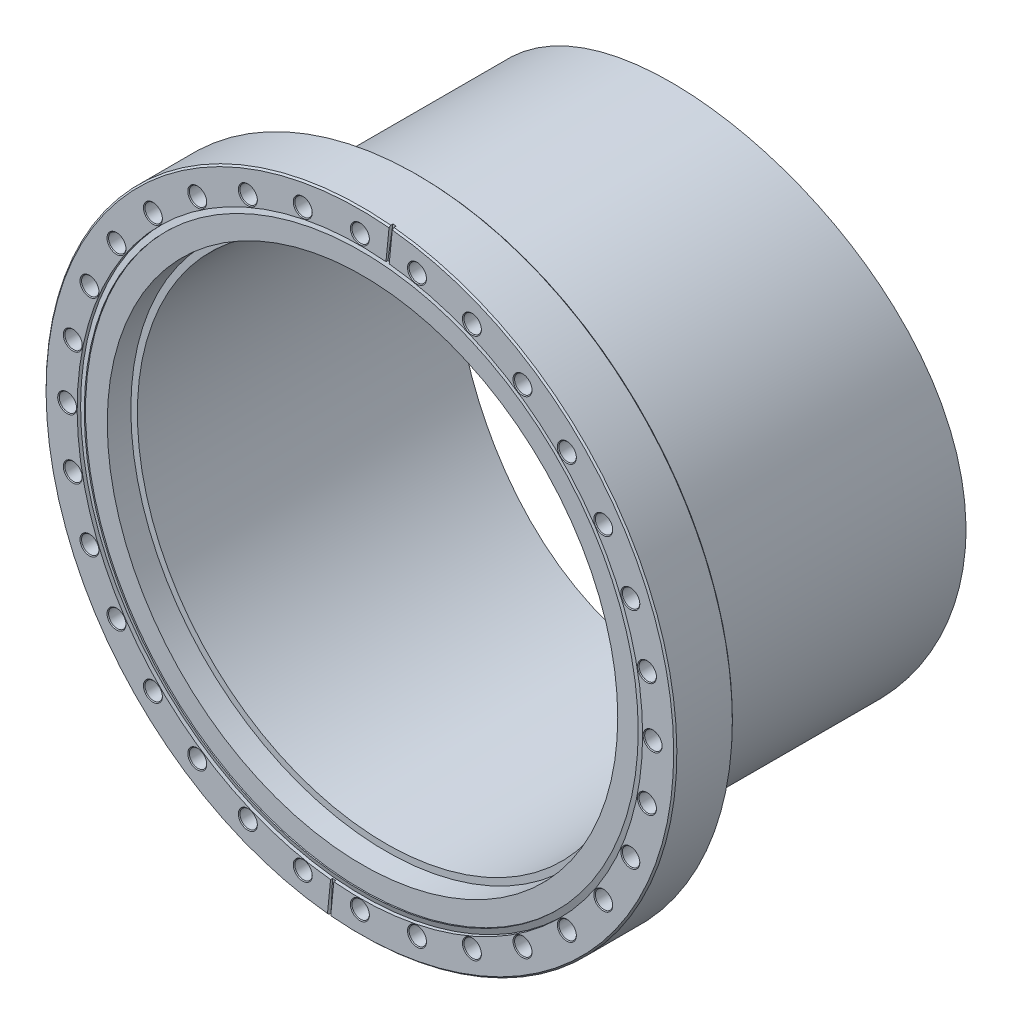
ISO-10303-21;
HEADER;
FILE_DESCRIPTION(('STEP AP214'),'2;1');
FILE_NAME('part.step','',(''),(''),'','','');
FILE_SCHEMA(('AUTOMOTIVE_DESIGN { 1 0 10303 214 1 1 1 1 }'));
ENDSEC;
DATA;
#1=APPLICATION_CONTEXT('core data for automotive mechanical design processes');
#2=APPLICATION_PROTOCOL_DEFINITION('international standard','automotive_design',2000,#1);
#3=PRODUCT_CONTEXT('',#1,'mechanical');
#4=PRODUCT('Part','Part','',(#3));
#5=PRODUCT_RELATED_PRODUCT_CATEGORY('part','',(#4));
#6=PRODUCT_DEFINITION_FORMATION('','',#4);
#7=PRODUCT_DEFINITION_CONTEXT('part definition',#1,'design');
#8=PRODUCT_DEFINITION('design','',#6,#7);
#9=PRODUCT_DEFINITION_SHAPE('','',#8);
#10=(LENGTH_UNIT() NAMED_UNIT(*) SI_UNIT(.MILLI.,.METRE.));
#11=(NAMED_UNIT(*) PLANE_ANGLE_UNIT() SI_UNIT($,.RADIAN.));
#12=(NAMED_UNIT(*) SI_UNIT($,.STERADIAN.) SOLID_ANGLE_UNIT());
#13=UNCERTAINTY_MEASURE_WITH_UNIT(LENGTH_MEASURE(1.E-05),#10,'distance_accuracy_value','');
#14=(GEOMETRIC_REPRESENTATION_CONTEXT(3) GLOBAL_UNCERTAINTY_ASSIGNED_CONTEXT((#13)) GLOBAL_UNIT_ASSIGNED_CONTEXT((#10,
#11,#12)) REPRESENTATION_CONTEXT('',''));
#15=CARTESIAN_POINT('',(0.,0.,0.));
#16=DIRECTION('',(0.,0.,1.));
#17=DIRECTION('',(1.,0.,0.));
#18=AXIS2_PLACEMENT_3D('',#15,#16,#17);
#19=CARTESIAN_POINT('',(0.,0.,-1.76119947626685));
#20=DIRECTION('',(0.,0.,1.));
#21=DIRECTION('',(1.,0.,0.));
#22=AXIS2_PLACEMENT_3D('',#19,#20,#21);
#23=CYLINDRICAL_SURFACE('',#22,134.366);
#24=CARTESIAN_POINT('',(0.,0.,-0.660399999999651));
#25=DIRECTION('',(0.,0.,-1.));
#26=DIRECTION('',(-1.,0.,0.));
#27=AXIS2_PLACEMENT_3D('',#24,#25,#26);
#28=CIRCLE('',#27,134.366);
#29=CARTESIAN_POINT('',(-134.366,0.,-0.660399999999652));
#30=VERTEX_POINT('',#29);
#31=EDGE_CURVE('E161',#30,#30,#28,.T.);
#32=ORIENTED_EDGE('',*,*,#31,.F.);
#33=EDGE_LOOP('',(#32));
#34=FACE_BOUND('',#33,.T.);
#35=CARTESIAN_POINT('',(0.,0.,-1.27));
#36=DIRECTION('',(0.,0.,1.));
#37=DIRECTION('',(1.,0.,0.));
#38=AXIS2_PLACEMENT_3D('',#35,#36,#37);
#39=CIRCLE('',#38,134.366);
#40=CARTESIAN_POINT('',(134.366,0.,-1.27));
#41=VERTEX_POINT('',#40);
#42=EDGE_CURVE('E146',#41,#41,#39,.T.);
#43=ORIENTED_EDGE('',*,*,#42,.F.);
#44=EDGE_LOOP('',(#43));
#45=FACE_BOUND('',#44,.T.);
#46=ADVANCED_FACE('F39',(#34,#45),#23,.F.);
#47=CARTESIAN_POINT('',(-12.6043103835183,-136.071784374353,-0.9398));
#48=DIRECTION('',(-0.00512982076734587,-0.0520839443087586,0.998629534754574));
#49=DIRECTION('',(0.,-0.998642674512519,-0.0520846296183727));
#50=AXIS2_PLACEMENT_3D('',#47,#48,#49);
#51=PLANE('',#50);
#52=DIRECTION('',(-0.097882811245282,-0.993820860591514,-0.0523359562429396));
#53=VECTOR('',#52,1.);
#54=CARTESIAN_POINT('',(-12.653877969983,-136.575052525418,-0.96630278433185));
#55=LINE('',#54,#53);
#56=CARTESIAN_POINT('',(-12.6538779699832,-136.575052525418,-0.966302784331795));
#57=VERTEX_POINT('',#56);
#58=CARTESIAN_POINT('',(-14.2061889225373,-152.335930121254,-1.79629200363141));
#59=VERTEX_POINT('',#58);
#60=EDGE_CURVE('E145',#57,#59,#55,.T.);
#61=ORIENTED_EDGE('',*,*,#60,.F.);
#62=CARTESIAN_POINT('',(0.,0.,6.22182785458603));
#63=DIRECTION('',(-0.00512982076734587,-0.0520839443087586,0.998629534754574));
#64=DIRECTION('',(0.0978828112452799,0.993820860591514,0.0523359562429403));
#65=AXIS2_PLACEMENT_3D('',#62,#63,#64);
#66=ELLIPSE('',#65,137.348230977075,137.16);
#67=CARTESIAN_POINT('',(-14.2337337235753,-136.419450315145,-0.966302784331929));
#68=VERTEX_POINT('',#67);
#69=EDGE_CURVE('E382',#57,#68,#66,.F.);
#70=ORIENTED_EDGE('',*,*,#69,.T.);
#71=DIRECTION('',(-0.0978828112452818,-0.993820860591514,-0.0523359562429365));
#72=VECTOR('',#71,1.);
#73=CARTESIAN_POINT('',(-14.2337337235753,-136.419450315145,-0.966302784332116));
#74=LINE('',#73,#72);
#75=CARTESIAN_POINT('',(-15.7860446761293,-152.180327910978,-1.79629200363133));
#76=VERTEX_POINT('',#75);
#77=EDGE_CURVE('E622',#68,#76,#74,.T.);
#78=ORIENTED_EDGE('',*,*,#77,.T.);
#79=CARTESIAN_POINT('',(0.,0.,6.22182785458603));
#80=DIRECTION('',(-0.00512982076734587,-0.0520839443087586,0.998629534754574));
#81=DIRECTION('',(-0.0978828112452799,-0.993820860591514,-0.0523359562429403));
#82=AXIS2_PLACEMENT_3D('',#79,#80,#81);
#83=ELLIPSE('',#82,153.206864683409,152.9969);
#84=EDGE_CURVE('E112',#76,#59,#83,.T.);
#85=ORIENTED_EDGE('',*,*,#84,.T.);
#86=EDGE_LOOP('',(#61,#70,#78,#85));
#87=FACE_BOUND('',#86,.T.);
#88=ADVANCED_FACE('F647',(#87),#51,.T.);
#89=CARTESIAN_POINT('',(14.1841661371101,135.916182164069,-0.9398));
#90=DIRECTION('',(-0.00512982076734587,-0.0520839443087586,-0.998629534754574));
#91=DIRECTION('',(0.,0.998642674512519,-0.0520846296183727));
#92=AXIS2_PLACEMENT_3D('',#89,#90,#91);
#93=PLANE('',#92);
#94=DIRECTION('',(0.0978828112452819,0.993820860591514,-0.0523359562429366));
#95=VECTOR('',#94,1.);
#96=CARTESIAN_POINT('',(14.2337337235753,136.419450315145,-0.966302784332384));
#97=LINE('',#96,#95);
#98=CARTESIAN_POINT('',(14.2337337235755,136.419450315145,-0.966302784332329));
#99=VERTEX_POINT('',#98);
#100=CARTESIAN_POINT('',(15.7860446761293,152.180327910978,-1.79629200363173));
#101=VERTEX_POINT('',#100);
#102=EDGE_CURVE('E152',#99,#101,#97,.T.);
#103=ORIENTED_EDGE('',*,*,#102,.T.);
#104=CARTESIAN_POINT('',(0.,0.,6.2218278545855));
#105=DIRECTION('',(-0.00512982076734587,-0.0520839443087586,-0.998629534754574));
#106=DIRECTION('',(0.0978828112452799,0.993820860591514,-0.0523359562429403));
#107=AXIS2_PLACEMENT_3D('',#104,#105,#106);
#108=ELLIPSE('',#107,153.206864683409,152.9969);
#109=CARTESIAN_POINT('',(14.2061889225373,152.335930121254,-1.79629200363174));
#110=VERTEX_POINT('',#109);
#111=EDGE_CURVE('E389',#110,#101,#108,.T.);
#112=ORIENTED_EDGE('',*,*,#111,.F.);
#113=DIRECTION('',(0.0978828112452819,0.993820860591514,-0.0523359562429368));
#114=VECTOR('',#113,1.);
#115=CARTESIAN_POINT('',(12.653877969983,136.575052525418,-0.96630278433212));
#116=LINE('',#115,#114);
#117=CARTESIAN_POINT('',(12.6538779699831,136.575052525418,-0.966302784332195));
#118=VERTEX_POINT('',#117);
#119=EDGE_CURVE('E615',#118,#110,#116,.T.);
#120=ORIENTED_EDGE('',*,*,#119,.F.);
#121=CARTESIAN_POINT('',(0.,0.,6.2218278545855));
#122=DIRECTION('',(-0.00512982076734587,-0.0520839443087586,-0.998629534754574));
#123=DIRECTION('',(-0.0978828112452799,-0.993820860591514,0.0523359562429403));
#124=AXIS2_PLACEMENT_3D('',#121,#122,#123);
#125=ELLIPSE('',#124,137.348230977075,137.16);
#126=EDGE_CURVE('E164',#99,#118,#125,.F.);
#127=ORIENTED_EDGE('',*,*,#126,.F.);
#128=EDGE_LOOP('',(#103,#112,#120,#127));
#129=FACE_BOUND('',#128,.T.);
#130=ADVANCED_FACE('F658',(#129),#93,.F.);
#131=CARTESIAN_POINT('',(0.,0.,-1.67733283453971));
#132=DIRECTION('',(0.,0.,-1.));
#133=DIRECTION('',(-1.,0.,0.));
#134=AXIS2_PLACEMENT_3D('',#131,#132,#133);
#135=CONICAL_SURFACE('',#134,137.159999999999,1.2217304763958);
#136=CARTESIAN_POINT('',(0.,0.,-1.67733283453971));
#137=DIRECTION('',(0.,0.,1.));
#138=DIRECTION('',(1.,0.,0.));
#139=AXIS2_PLACEMENT_3D('',#136,#137,#138);
#140=CIRCLE('',#139,137.16);
#141=CARTESIAN_POINT('',(137.16,0.,-1.67733283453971));
#142=VERTEX_POINT('',#141);
#143=EDGE_CURVE('E381',#142,#142,#140,.T.);
#144=ORIENTED_EDGE('',*,*,#143,.T.);
#145=EDGE_LOOP('',(#144));
#146=FACE_BOUND('',#145,.T.);
#147=ORIENTED_EDGE('',*,*,#31,.T.);
#148=EDGE_LOOP('',(#147));
#149=FACE_BOUND('',#148,.T.);
#150=ADVANCED_FACE('F1013',(#146,#149),#135,.T.);
#151=CARTESIAN_POINT('',(0.,0.,-1.27));
#152=DIRECTION('',(0.,0.,1.));
#153=DIRECTION('',(1.,0.,0.));
#154=AXIS2_PLACEMENT_3D('',#151,#152,#153);
#155=PLANE('',#154);
#156=ORIENTED_EDGE('',*,*,#42,.T.);
#157=EDGE_LOOP('',(#156));
#158=FACE_BOUND('',#157,.T.);
#159=CARTESIAN_POINT('',(0.,0.,-1.27));
#160=DIRECTION('',(0.,0.,-1.));
#161=DIRECTION('',(-1.,0.,0.));
#162=AXIS2_PLACEMENT_3D('',#159,#160,#161);
#163=CIRCLE('',#162,123.825);
#164=CARTESIAN_POINT('',(-123.825,0.,-1.27));
#165=VERTEX_POINT('',#164);
#166=EDGE_CURVE('E378',#165,#165,#163,.T.);
#167=ORIENTED_EDGE('',*,*,#166,.T.);
#168=EDGE_LOOP('',(#167));
#169=FACE_BOUND('',#168,.T.);
#170=ADVANCED_FACE('F1010',(#158,#169),#155,.T.);
#171=CARTESIAN_POINT('',(0.789927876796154,-0.0778011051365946,0.));
#172=DIRECTION('',(-0.995184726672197,0.0980171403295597,0.));
#173=DIRECTION('',(-0.0980171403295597,-0.995184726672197,0.));
#174=AXIS2_PLACEMENT_3D('',#171,#172,#173);
#175=PLANE('',#174);
#176=ORIENTED_EDGE('',*,*,#60,.T.);
#177=DIRECTION('',(0.,0.,1.));
#178=VECTOR('',#177,1.);
#179=CARTESIAN_POINT('',(-14.2061889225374,-152.335930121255,0.));
#180=LINE('',#179,#178);
#181=CARTESIAN_POINT('',(-14.2061889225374,-152.335930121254,-0.761999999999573));
#182=VERTEX_POINT('',#181);
#183=EDGE_CURVE('E130',#59,#182,#180,.T.);
#184=ORIENTED_EDGE('',*,*,#183,.T.);
#185=DIRECTION('',(0.0693090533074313,0.703706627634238,0.70710199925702));
#186=VECTOR('',#185,1.);
#187=CARTESIAN_POINT('',(-14.2061889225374,-152.335930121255,-0.762000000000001));
#188=LINE('',#187,#186);
#189=CARTESIAN_POINT('',(-14.1314988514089,-151.577589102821,-4.02089942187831E-12));
#190=VERTEX_POINT('',#189);
#191=EDGE_CURVE('E138',#182,#190,#188,.T.);
#192=ORIENTED_EDGE('',*,*,#191,.T.);
#193=DIRECTION('',(0.0980171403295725,0.995184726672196,0.));
#194=VECTOR('',#193,1.);
#195=CARTESIAN_POINT('',(-14.1314988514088,-151.577589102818,0.));
#196=LINE('',#195,#194);
#197=CARTESIAN_POINT('',(-12.6538779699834,-136.575052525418,0.));
#198=VERTEX_POINT('',#197);
#199=EDGE_CURVE('E377',#190,#198,#196,.T.);
#200=ORIENTED_EDGE('',*,*,#199,.T.);
#201=DIRECTION('',(0.,0.,1.));
#202=VECTOR('',#201,1.);
#203=CARTESIAN_POINT('',(-12.6538779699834,-136.575052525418,-1.76119947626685));
#204=LINE('',#203,#202);
#205=EDGE_CURVE('E385',#198,#57,#204,.F.);
#206=ORIENTED_EDGE('',*,*,#205,.T.);
#207=EDGE_LOOP('',(#176,#184,#192,#200,#206));
#208=FACE_BOUND('',#207,.T.);
#209=ADVANCED_FACE('F148',(#208),#175,.T.);
#210=CARTESIAN_POINT('',(0.789927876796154,-0.0778011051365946,0.));
#211=DIRECTION('',(0.995184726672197,-0.0980171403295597,0.));
#212=DIRECTION('',(0.0980171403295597,0.995184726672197,0.));
#213=AXIS2_PLACEMENT_3D('',#210,#211,#212);
#214=PLANE('',#213);
#215=ORIENTED_EDGE('',*,*,#102,.F.);
#216=DIRECTION('',(0.,0.,1.));
#217=VECTOR('',#216,1.);
#218=CARTESIAN_POINT('',(14.2337337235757,136.419450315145,-1.76119947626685));
#219=LINE('',#218,#217);
#220=CARTESIAN_POINT('',(14.2337337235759,136.419450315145,0.));
#221=VERTEX_POINT('',#220);
#222=EDGE_CURVE('E612',#99,#221,#219,.T.);
#223=ORIENTED_EDGE('',*,*,#222,.T.);
#224=DIRECTION('',(0.0980171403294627,0.995184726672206,0.));
#225=VECTOR('',#224,1.);
#226=CARTESIAN_POINT('',(14.2337337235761,136.419450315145,0.));
#227=LINE('',#226,#225);
#228=CARTESIAN_POINT('',(15.7113546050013,151.421986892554,-4.02060112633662E-12));
#229=VERTEX_POINT('',#228);
#230=EDGE_CURVE('E376',#221,#229,#227,.T.);
#231=ORIENTED_EDGE('',*,*,#230,.T.);
#232=DIRECTION('',(-0.0693090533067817,-0.703706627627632,0.707101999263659));
#233=VECTOR('',#232,1.);
#234=CARTESIAN_POINT('',(15.7860446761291,152.180327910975,-0.762000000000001));
#235=LINE('',#234,#233);
#236=CARTESIAN_POINT('',(15.7860446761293,152.180327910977,-0.76200000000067));
#237=VERTEX_POINT('',#236);
#238=EDGE_CURVE('E150',#237,#229,#235,.T.);
#239=ORIENTED_EDGE('',*,*,#238,.F.);
#240=DIRECTION('',(0.,0.,1.));
#241=VECTOR('',#240,1.);
#242=CARTESIAN_POINT('',(15.7860446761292,152.180327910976,0.));
#243=LINE('',#242,#241);
#244=EDGE_CURVE('E123',#101,#237,#243,.T.);
#245=ORIENTED_EDGE('',*,*,#244,.F.);
#246=EDGE_LOOP('',(#215,#223,#231,#239,#245));
#247=FACE_BOUND('',#246,.T.);
#248=ADVANCED_FACE('F662',(#247),#214,.F.);
#249=CARTESIAN_POINT('',(-0.789927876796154,0.0778011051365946,0.));
#250=DIRECTION('',(-0.995184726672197,0.0980171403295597,0.));
#251=DIRECTION('',(-0.0980171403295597,-0.995184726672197,0.));
#252=AXIS2_PLACEMENT_3D('',#249,#250,#251);
#253=PLANE('',#252);
#254=ORIENTED_EDGE('',*,*,#77,.F.);
#255=DIRECTION('',(0.,0.,1.));
#256=VECTOR('',#255,1.);
#257=CARTESIAN_POINT('',(-14.2337337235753,-136.419450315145,0.));
#258=LINE('',#257,#256);
#259=CARTESIAN_POINT('',(-14.2337337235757,-136.419450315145,0.));
#260=VERTEX_POINT('',#259);
#261=EDGE_CURVE('E619',#260,#68,#258,.F.);
#262=ORIENTED_EDGE('',*,*,#261,.F.);
#263=DIRECTION('',(-0.0980171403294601,-0.995184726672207,0.));
#264=VECTOR('',#263,1.);
#265=CARTESIAN_POINT('',(-14.2337337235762,-136.419450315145,0.));
#266=LINE('',#265,#264);
#267=CARTESIAN_POINT('',(-15.7113546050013,-151.421986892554,-4.02610345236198E-12));
#268=VERTEX_POINT('',#267);
#269=EDGE_CURVE('E603',#260,#268,#266,.T.);
#270=ORIENTED_EDGE('',*,*,#269,.T.);
#271=DIRECTION('',(0.0693090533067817,0.703706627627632,0.707101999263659));
#272=VECTOR('',#271,1.);
#273=CARTESIAN_POINT('',(-15.7860446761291,-152.180327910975,-0.762000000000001));
#274=LINE('',#273,#272);
#275=CARTESIAN_POINT('',(-15.7860446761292,-152.180327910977,-0.76200000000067));
#276=VERTEX_POINT('',#275);
#277=EDGE_CURVE('E384',#276,#268,#274,.T.);
#278=ORIENTED_EDGE('',*,*,#277,.F.);
#279=DIRECTION('',(0.,0.,1.));
#280=VECTOR('',#279,1.);
#281=CARTESIAN_POINT('',(-15.7860446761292,-152.180327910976,0.));
#282=LINE('',#281,#280);
#283=EDGE_CURVE('E616',#76,#276,#282,.T.);
#284=ORIENTED_EDGE('',*,*,#283,.F.);
#285=EDGE_LOOP('',(#254,#262,#270,#278,#284));
#286=FACE_BOUND('',#285,.T.);
#287=ADVANCED_FACE('F652',(#286),#253,.F.);
#288=CARTESIAN_POINT('',(-0.789927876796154,0.0778011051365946,0.));
#289=DIRECTION('',(0.995184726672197,-0.0980171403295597,0.));
#290=DIRECTION('',(0.0980171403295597,0.995184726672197,0.));
#291=AXIS2_PLACEMENT_3D('',#288,#289,#290);
#292=PLANE('',#291);
#293=ORIENTED_EDGE('',*,*,#119,.T.);
#294=DIRECTION('',(0.,0.,1.));
#295=VECTOR('',#294,1.);
#296=CARTESIAN_POINT('',(14.2061889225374,152.335930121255,0.));
#297=LINE('',#296,#295);
#298=CARTESIAN_POINT('',(14.2061889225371,152.335930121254,-0.761999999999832));
#299=VERTEX_POINT('',#298);
#300=EDGE_CURVE('E613',#110,#299,#297,.T.);
#301=ORIENTED_EDGE('',*,*,#300,.T.);
#302=DIRECTION('',(-0.0693090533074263,-0.703706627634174,0.707101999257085));
#303=VECTOR('',#302,1.);
#304=CARTESIAN_POINT('',(14.2061889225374,152.335930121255,-0.762000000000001));
#305=LINE('',#304,#303);
#306=CARTESIAN_POINT('',(14.1314988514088,151.577589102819,-2.67838592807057E-12));
#307=VERTEX_POINT('',#306);
#308=EDGE_CURVE('E61',#299,#307,#305,.T.);
#309=ORIENTED_EDGE('',*,*,#308,.T.);
#310=DIRECTION('',(-0.0980171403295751,-0.995184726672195,0.));
#311=VECTOR('',#310,1.);
#312=CARTESIAN_POINT('',(14.1314988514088,151.577589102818,0.));
#313=LINE('',#312,#311);
#314=CARTESIAN_POINT('',(12.6538779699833,136.575052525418,0.));
#315=VERTEX_POINT('',#314);
#316=EDGE_CURVE('E372',#307,#315,#313,.T.);
#317=ORIENTED_EDGE('',*,*,#316,.T.);
#318=DIRECTION('',(0.,0.,1.));
#319=VECTOR('',#318,1.);
#320=CARTESIAN_POINT('',(12.6538779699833,136.575052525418,-1.76119947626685));
#321=LINE('',#320,#319);
#322=EDGE_CURVE('E609',#315,#118,#321,.F.);
#323=ORIENTED_EDGE('',*,*,#322,.T.);
#324=EDGE_LOOP('',(#293,#301,#309,#317,#323));
#325=FACE_BOUND('',#324,.T.);
#326=ADVANCED_FACE('F654',(#325),#292,.T.);
#327=CARTESIAN_POINT('',(0.,0.,-1.76119947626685));
#328=DIRECTION('',(0.,0.,1.));
#329=DIRECTION('',(1.,0.,0.));
#330=AXIS2_PLACEMENT_3D('',#327,#328,#329);
#331=CYLINDRICAL_SURFACE('',#330,137.16);
#332=ORIENTED_EDGE('',*,*,#143,.F.);
#333=EDGE_LOOP('',(#332));
#334=FACE_BOUND('',#333,.T.);
#335=ORIENTED_EDGE('',*,*,#205,.F.);
#336=CARTESIAN_POINT('',(0.,0.,0.));
#337=DIRECTION('',(0.,0.,1.));
#338=DIRECTION('',(1.,0.,0.));
#339=AXIS2_PLACEMENT_3D('',#336,#337,#338);
#340=CIRCLE('',#339,137.16);
#341=EDGE_CURVE('E373',#198,#221,#340,.T.);
#342=ORIENTED_EDGE('',*,*,#341,.T.);
#343=ORIENTED_EDGE('',*,*,#222,.F.);
#344=ORIENTED_EDGE('',*,*,#126,.T.);
#345=ORIENTED_EDGE('',*,*,#322,.F.);
#346=CARTESIAN_POINT('',(0.,0.,0.));
#347=DIRECTION('',(0.,0.,1.));
#348=DIRECTION('',(1.,0.,0.));
#349=AXIS2_PLACEMENT_3D('',#346,#347,#348);
#350=CIRCLE('',#349,137.16);
#351=EDGE_CURVE('E370',#315,#260,#350,.T.);
#352=ORIENTED_EDGE('',*,*,#351,.T.);
#353=ORIENTED_EDGE('',*,*,#261,.T.);
#354=ORIENTED_EDGE('',*,*,#69,.F.);
#355=EDGE_LOOP('',(#335,#342,#343,#344,#345,#352,#353,#354));
#356=FACE_BOUND('',#355,.T.);
#357=ADVANCED_FACE('F669',(#334,#356),#331,.F.);
#358=CARTESIAN_POINT('',(0.,0.,-1.27));
#359=DIRECTION('',(0.,0.,-1.));
#360=DIRECTION('',(-1.,0.,0.));
#361=AXIS2_PLACEMENT_3D('',#358,#359,#360);
#362=CYLINDRICAL_SURFACE('',#361,123.825);
#363=ORIENTED_EDGE('',*,*,#166,.F.);
#364=EDGE_LOOP('',(#363));
#365=FACE_BOUND('',#364,.T.);
#366=CARTESIAN_POINT('',(0.,0.,-12.7));
#367=DIRECTION('',(0.,0.,-1.));
#368=DIRECTION('',(-1.,0.,0.));
#369=AXIS2_PLACEMENT_3D('',#366,#367,#368);
#370=CIRCLE('',#369,123.825);
#371=CARTESIAN_POINT('',(-123.825,0.,-12.7));
#372=VERTEX_POINT('',#371);
#373=EDGE_CURVE('E391',#372,#372,#370,.F.);
#374=ORIENTED_EDGE('',*,*,#373,.F.);
#375=EDGE_LOOP('',(#374));
#376=FACE_BOUND('',#375,.T.);
#377=ADVANCED_FACE('F995',(#365,#376),#362,.F.);
#378=CARTESIAN_POINT('',(0.,0.,0.));
#379=DIRECTION('',(0.,0.,-1.));
#380=DIRECTION('',(-1.,0.,0.));
#381=AXIS2_PLACEMENT_3D('',#378,#379,#380);
#382=PLANE('',#381);
#383=ORIENTED_EDGE('',*,*,#341,.F.);
#384=ORIENTED_EDGE('',*,*,#199,.F.);
#385=CARTESIAN_POINT('',(0.,0.,-8.04174435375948E-12));
#386=DIRECTION('',(0.,0.,-1.));
#387=DIRECTION('',(-1.,0.,0.));
#388=AXIS2_PLACEMENT_3D('',#385,#386,#387);
#389=CIRCLE('',#388,152.234900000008);
#390=EDGE_CURVE('E141',#229,#190,#389,.T.);
#391=ORIENTED_EDGE('',*,*,#390,.F.);
#392=ORIENTED_EDGE('',*,*,#230,.F.);
#393=EDGE_LOOP('',(#383,#384,#391,#392));
#394=FACE_BOUND('',#393,.T.);
#395=CARTESIAN_POINT('',(27.7025721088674,139.270234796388,0.));
#396=DIRECTION('',(0.,0.,1.));
#397=DIRECTION('',(1.,0.,0.));
#398=AXIS2_PLACEMENT_3D('',#395,#396,#397);
#399=CIRCLE('',#398,4.59739999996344);
#400=CARTESIAN_POINT('',(32.2999721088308,139.270234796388,0.));
#401=VERTEX_POINT('',#400);
#402=EDGE_CURVE('E277',#401,#401,#399,.F.);
#403=ORIENTED_EDGE('',*,*,#402,.T.);
#404=EDGE_LOOP('',(#403));
#405=FACE_BOUND('',#404,.T.);
#406=CARTESIAN_POINT('',(54.3405499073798,131.189692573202,0.));
#407=DIRECTION('',(0.,0.,1.));
#408=DIRECTION('',(1.,0.,0.));
#409=AXIS2_PLACEMENT_3D('',#406,#407,#408);
#410=CIRCLE('',#409,4.59739999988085);
#411=CARTESIAN_POINT('',(58.9379499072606,131.189692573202,0.));
#412=VERTEX_POINT('',#411);
#413=EDGE_CURVE('E280',#412,#412,#410,.F.);
#414=ORIENTED_EDGE('',*,*,#413,.T.);
#415=EDGE_LOOP('',(#414));
#416=FACE_BOUND('',#415,.T.);
#417=CARTESIAN_POINT('',(78.8902508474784,118.067604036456,0.));
#418=DIRECTION('',(0.,0.,1.));
#419=DIRECTION('',(1.,0.,0.));
#420=AXIS2_PLACEMENT_3D('',#417,#418,#419);
#421=CIRCLE('',#420,4.597400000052);
#422=CARTESIAN_POINT('',(83.4876508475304,118.067604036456,0.));
#423=VERTEX_POINT('',#422);
#424=EDGE_CURVE('E283',#423,#423,#421,.F.);
#425=ORIENTED_EDGE('',*,*,#424,.T.);
#426=EDGE_LOOP('',(#425));
#427=FACE_BOUND('',#426,.T.);
#428=CARTESIAN_POINT('',(100.408243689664,100.408243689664,-5.6843418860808E-11));
#429=DIRECTION('',(0.,0.,1.));
#430=DIRECTION('',(1.,0.,0.));
#431=AXIS2_PLACEMENT_3D('',#428,#429,#430);
#432=CIRCLE('',#431,4.59739999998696);
#433=CARTESIAN_POINT('',(105.005643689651,100.408243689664,-5.6843418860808E-11));
#434=VERTEX_POINT('',#433);
#435=EDGE_CURVE('E286',#434,#434,#432,.F.);
#436=ORIENTED_EDGE('',*,*,#435,.T.);
#437=EDGE_LOOP('',(#436));
#438=FACE_BOUND('',#437,.T.);
#439=CARTESIAN_POINT('',(118.067604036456,78.8902508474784,-5.6843418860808E-11));
#440=DIRECTION('',(0.,0.,1.));
#441=DIRECTION('',(1.,0.,0.));
#442=AXIS2_PLACEMENT_3D('',#439,#440,#441);
#443=CIRCLE('',#442,4.59739999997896);
#444=CARTESIAN_POINT('',(122.665004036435,78.8902508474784,-5.6843418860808E-11));
#445=VERTEX_POINT('',#444);
#446=EDGE_CURVE('E289',#445,#445,#443,.F.);
#447=ORIENTED_EDGE('',*,*,#446,.T.);
#448=EDGE_LOOP('',(#447));
#449=FACE_BOUND('',#448,.T.);
#450=CARTESIAN_POINT('',(131.189692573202,54.3405499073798,0.));
#451=DIRECTION('',(0.,0.,1.));
#452=DIRECTION('',(1.,0.,0.));
#453=AXIS2_PLACEMENT_3D('',#450,#451,#452);
#454=CIRCLE('',#453,4.5973999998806);
#455=CARTESIAN_POINT('',(135.787092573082,54.3405499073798,0.));
#456=VERTEX_POINT('',#455);
#457=EDGE_CURVE('E292',#456,#456,#454,.F.);
#458=ORIENTED_EDGE('',*,*,#457,.T.);
#459=EDGE_LOOP('',(#458));
#460=FACE_BOUND('',#459,.T.);
#461=CARTESIAN_POINT('',(139.270234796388,27.7025721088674,5.6843418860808E-11));
#462=DIRECTION('',(0.,0.,1.));
#463=DIRECTION('',(1.,0.,0.));
#464=AXIS2_PLACEMENT_3D('',#461,#462,#463);
#465=CIRCLE('',#464,4.59739999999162);
#466=CARTESIAN_POINT('',(143.867634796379,27.7025721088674,5.6843418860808E-11));
#467=VERTEX_POINT('',#466);
#468=EDGE_CURVE('E295',#467,#467,#465,.F.);
#469=ORIENTED_EDGE('',*,*,#468,.T.);
#470=EDGE_LOOP('',(#469));
#471=FACE_BOUND('',#470,.T.);
#472=CARTESIAN_POINT('',(141.9987,0.,-5.6843418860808E-11));
#473=DIRECTION('',(0.,0.,1.));
#474=DIRECTION('',(1.,0.,0.));
#475=AXIS2_PLACEMENT_3D('',#472,#473,#474);
#476=CIRCLE('',#475,4.597399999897);
#477=CARTESIAN_POINT('',(146.596099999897,0.,-5.6843418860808E-11));
#478=VERTEX_POINT('',#477);
#479=EDGE_CURVE('E298',#478,#478,#476,.F.);
#480=ORIENTED_EDGE('',*,*,#479,.T.);
#481=EDGE_LOOP('',(#480));
#482=FACE_BOUND('',#481,.T.);
#483=CARTESIAN_POINT('',(139.270234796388,-27.7025721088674,5.6843418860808E-11));
#484=DIRECTION('',(0.,0.,1.));
#485=DIRECTION('',(1.,0.,0.));
#486=AXIS2_PLACEMENT_3D('',#483,#484,#485);
#487=CIRCLE('',#486,4.59739999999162);
#488=CARTESIAN_POINT('',(143.867634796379,-27.7025721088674,5.6843418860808E-11));
#489=VERTEX_POINT('',#488);
#490=EDGE_CURVE('E301',#489,#489,#487,.F.);
#491=ORIENTED_EDGE('',*,*,#490,.T.);
#492=EDGE_LOOP('',(#491));
#493=FACE_BOUND('',#492,.T.);
#494=CARTESIAN_POINT('',(131.189692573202,-54.3405499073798,0.));
#495=DIRECTION('',(0.,0.,1.));
#496=DIRECTION('',(1.,0.,0.));
#497=AXIS2_PLACEMENT_3D('',#494,#495,#496);
#498=CIRCLE('',#497,4.5973999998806);
#499=CARTESIAN_POINT('',(135.787092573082,-54.3405499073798,0.));
#500=VERTEX_POINT('',#499);
#501=EDGE_CURVE('E304',#500,#500,#498,.F.);
#502=ORIENTED_EDGE('',*,*,#501,.T.);
#503=EDGE_LOOP('',(#502));
#504=FACE_BOUND('',#503,.T.);
#505=CARTESIAN_POINT('',(118.067604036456,-78.8902508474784,-5.6843418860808E-11));
#506=DIRECTION('',(0.,0.,1.));
#507=DIRECTION('',(1.,0.,0.));
#508=AXIS2_PLACEMENT_3D('',#505,#506,#507);
#509=CIRCLE('',#508,4.59739999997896);
#510=CARTESIAN_POINT('',(122.665004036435,-78.8902508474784,-5.6843418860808E-11));
#511=VERTEX_POINT('',#510);
#512=EDGE_CURVE('E307',#511,#511,#509,.F.);
#513=ORIENTED_EDGE('',*,*,#512,.T.);
#514=EDGE_LOOP('',(#513));
#515=FACE_BOUND('',#514,.T.);
#516=CARTESIAN_POINT('',(100.408243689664,-100.408243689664,-5.6843418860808E-11));
#517=DIRECTION('',(0.,0.,1.));
#518=DIRECTION('',(1.,0.,0.));
#519=AXIS2_PLACEMENT_3D('',#516,#517,#518);
#520=CIRCLE('',#519,4.59739999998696);
#521=CARTESIAN_POINT('',(105.005643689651,-100.408243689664,-5.6843418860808E-11));
#522=VERTEX_POINT('',#521);
#523=EDGE_CURVE('E310',#522,#522,#520,.F.);
#524=ORIENTED_EDGE('',*,*,#523,.T.);
#525=EDGE_LOOP('',(#524));
#526=FACE_BOUND('',#525,.T.);
#527=CARTESIAN_POINT('',(78.8902508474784,-118.067604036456,0.));
#528=DIRECTION('',(0.,0.,1.));
#529=DIRECTION('',(1.,0.,0.));
#530=AXIS2_PLACEMENT_3D('',#527,#528,#529);
#531=CIRCLE('',#530,4.597400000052);
#532=CARTESIAN_POINT('',(83.4876508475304,-118.067604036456,0.));
#533=VERTEX_POINT('',#532);
#534=EDGE_CURVE('E313',#533,#533,#531,.F.);
#535=ORIENTED_EDGE('',*,*,#534,.T.);
#536=EDGE_LOOP('',(#535));
#537=FACE_BOUND('',#536,.T.);
#538=CARTESIAN_POINT('',(54.3405499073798,-131.189692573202,0.));
#539=DIRECTION('',(0.,0.,1.));
#540=DIRECTION('',(1.,0.,0.));
#541=AXIS2_PLACEMENT_3D('',#538,#539,#540);
#542=CIRCLE('',#541,4.59739999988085);
#543=CARTESIAN_POINT('',(58.9379499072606,-131.189692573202,0.));
#544=VERTEX_POINT('',#543);
#545=EDGE_CURVE('E316',#544,#544,#542,.F.);
#546=ORIENTED_EDGE('',*,*,#545,.T.);
#547=EDGE_LOOP('',(#546));
#548=FACE_BOUND('',#547,.T.);
#549=CARTESIAN_POINT('',(27.7025721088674,-139.270234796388,0.));
#550=DIRECTION('',(0.,0.,1.));
#551=DIRECTION('',(1.,0.,0.));
#552=AXIS2_PLACEMENT_3D('',#549,#550,#551);
#553=CIRCLE('',#552,4.59739999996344);
#554=CARTESIAN_POINT('',(32.2999721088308,-139.270234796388,0.));
#555=VERTEX_POINT('',#554);
#556=EDGE_CURVE('E319',#555,#555,#553,.F.);
#557=ORIENTED_EDGE('',*,*,#556,.T.);
#558=EDGE_LOOP('',(#557));
#559=FACE_BOUND('',#558,.T.);
#560=CARTESIAN_POINT('',(0.,-141.9987,0.));
#561=DIRECTION('',(0.,0.,1.));
#562=DIRECTION('',(1.,0.,0.));
#563=AXIS2_PLACEMENT_3D('',#560,#561,#562);
#564=CIRCLE('',#563,4.59740000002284);
#565=CARTESIAN_POINT('',(4.59740000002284,-141.9987,0.));
#566=VERTEX_POINT('',#565);
#567=EDGE_CURVE('E322',#566,#566,#564,.F.);
#568=ORIENTED_EDGE('',*,*,#567,.T.);
#569=EDGE_LOOP('',(#568));
#570=FACE_BOUND('',#569,.T.);
#571=ADVANCED_FACE('F665',(#394,#405,#416,#427,#438,#449,#460,#471,#482,#493,#504,#515,#526,
#537,#548,#559,#570),#382,.F.);
#572=CARTESIAN_POINT('',(0.,0.,0.));
#573=DIRECTION('',(0.,0.,-1.));
#574=DIRECTION('',(-1.,0.,0.));
#575=AXIS2_PLACEMENT_3D('',#572,#573,#574);
#576=PLANE('',#575);
#577=ORIENTED_EDGE('',*,*,#316,.F.);
#578=CARTESIAN_POINT('',(0.,0.,-5.35682609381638E-12));
#579=DIRECTION('',(0.,0.,-1.));
#580=DIRECTION('',(0.,1.,0.));
#581=AXIS2_PLACEMENT_3D('',#578,#579,#580);
#582=CIRCLE('',#581,152.234900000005);
#583=EDGE_CURVE('E271',#268,#307,#582,.T.);
#584=ORIENTED_EDGE('',*,*,#583,.F.);
#585=ORIENTED_EDGE('',*,*,#269,.F.);
#586=ORIENTED_EDGE('',*,*,#351,.F.);
#587=EDGE_LOOP('',(#577,#584,#585,#586));
#588=FACE_BOUND('',#587,.T.);
#589=CARTESIAN_POINT('',(0.,141.9987,0.));
#590=DIRECTION('',(0.,0.,1.));
#591=DIRECTION('',(1.,0.,0.));
#592=AXIS2_PLACEMENT_3D('',#589,#590,#591);
#593=CIRCLE('',#592,4.59740000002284);
#594=CARTESIAN_POINT('',(4.59740000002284,141.9987,0.));
#595=VERTEX_POINT('',#594);
#596=EDGE_CURVE('E274',#595,#595,#593,.F.);
#597=ORIENTED_EDGE('',*,*,#596,.T.);
#598=EDGE_LOOP('',(#597));
#599=FACE_BOUND('',#598,.T.);
#600=CARTESIAN_POINT('',(-27.7025721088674,-139.270234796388,5.6843418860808E-11));
#601=DIRECTION('',(0.,0.,1.));
#602=DIRECTION('',(1.,0.,0.));
#603=AXIS2_PLACEMENT_3D('',#600,#601,#602);
#604=CIRCLE('',#603,4.59739999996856);
#605=CARTESIAN_POINT('',(-23.1051721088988,-139.270234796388,5.6843418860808E-11));
#606=VERTEX_POINT('',#605);
#607=EDGE_CURVE('E325',#606,#606,#604,.F.);
#608=ORIENTED_EDGE('',*,*,#607,.T.);
#609=EDGE_LOOP('',(#608));
#610=FACE_BOUND('',#609,.T.);
#611=CARTESIAN_POINT('',(-54.3405499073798,-131.189692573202,1.13686837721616E-10));
#612=DIRECTION('',(0.,0.,1.));
#613=DIRECTION('',(1.,0.,0.));
#614=AXIS2_PLACEMENT_3D('',#611,#612,#613);
#615=CIRCLE('',#614,4.59740000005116);
#616=CARTESIAN_POINT('',(-49.7431499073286,-131.189692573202,1.13686837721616E-10));
#617=VERTEX_POINT('',#616);
#618=EDGE_CURVE('E328',#617,#617,#615,.F.);
#619=ORIENTED_EDGE('',*,*,#618,.T.);
#620=EDGE_LOOP('',(#619));
#621=FACE_BOUND('',#620,.T.);
#622=CARTESIAN_POINT('',(-78.8902508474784,-118.067604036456,-5.6843418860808E-11));
#623=DIRECTION('',(0.,0.,1.));
#624=DIRECTION('',(1.,0.,0.));
#625=AXIS2_PLACEMENT_3D('',#622,#623,#624);
#626=CIRCLE('',#625,4.59739999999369);
#627=CARTESIAN_POINT('',(-74.2928508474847,-118.067604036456,-5.6843418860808E-11));
#628=VERTEX_POINT('',#627);
#629=EDGE_CURVE('E331',#628,#628,#626,.F.);
#630=ORIENTED_EDGE('',*,*,#629,.T.);
#631=EDGE_LOOP('',(#630));
#632=FACE_BOUND('',#631,.T.);
#633=CARTESIAN_POINT('',(-100.408243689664,-100.408243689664,-5.6843418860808E-11));
#634=DIRECTION('',(0.,0.,1.));
#635=DIRECTION('',(1.,0.,0.));
#636=AXIS2_PLACEMENT_3D('',#633,#634,#635);
#637=CIRCLE('',#636,4.59740000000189);
#638=CARTESIAN_POINT('',(-95.8108436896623,-100.408243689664,-5.6843418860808E-11));
#639=VERTEX_POINT('',#638);
#640=EDGE_CURVE('E334',#639,#639,#637,.F.);
#641=ORIENTED_EDGE('',*,*,#640,.T.);
#642=EDGE_LOOP('',(#641));
#643=FACE_BOUND('',#642,.T.);
#644=CARTESIAN_POINT('',(-118.067604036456,-78.8902508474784,0.));
#645=DIRECTION('',(0.,0.,1.));
#646=DIRECTION('',(1.,0.,0.));
#647=AXIS2_PLACEMENT_3D('',#644,#645,#646);
#648=CIRCLE('',#647,4.59740000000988);
#649=CARTESIAN_POINT('',(-113.470204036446,-78.8902508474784,0.));
#650=VERTEX_POINT('',#649);
#651=EDGE_CURVE('E337',#650,#650,#648,.F.);
#652=ORIENTED_EDGE('',*,*,#651,.T.);
#653=EDGE_LOOP('',(#652));
#654=FACE_BOUND('',#653,.T.);
#655=CARTESIAN_POINT('',(-131.189692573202,-54.3405499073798,-5.6843418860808E-11));
#656=DIRECTION('',(0.,0.,1.));
#657=DIRECTION('',(1.,0.,0.));
#658=AXIS2_PLACEMENT_3D('',#655,#656,#657);
#659=CIRCLE('',#658,4.59739999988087);
#660=CARTESIAN_POINT('',(-126.592292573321,-54.3405499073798,-5.6843418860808E-11));
#661=VERTEX_POINT('',#660);
#662=EDGE_CURVE('E340',#661,#661,#659,.F.);
#663=ORIENTED_EDGE('',*,*,#662,.T.);
#664=EDGE_LOOP('',(#663));
#665=FACE_BOUND('',#664,.T.);
#666=CARTESIAN_POINT('',(-139.270234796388,-27.7025721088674,-5.6843418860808E-11));
#667=DIRECTION('',(0.,0.,1.));
#668=DIRECTION('',(1.,0.,0.));
#669=AXIS2_PLACEMENT_3D('',#666,#667,#668);
#670=CIRCLE('',#669,4.59739999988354);
#671=CARTESIAN_POINT('',(-134.672834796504,-27.7025721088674,-5.6843418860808E-11));
#672=VERTEX_POINT('',#671);
#673=EDGE_CURVE('E343',#672,#672,#670,.F.);
#674=ORIENTED_EDGE('',*,*,#673,.T.);
#675=EDGE_LOOP('',(#674));
#676=FACE_BOUND('',#675,.T.);
#677=CARTESIAN_POINT('',(-141.9987,0.,-5.6843418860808E-11));
#678=DIRECTION('',(0.,0.,1.));
#679=DIRECTION('',(1.,0.,0.));
#680=AXIS2_PLACEMENT_3D('',#677,#678,#679);
#681=CIRCLE('',#680,4.59739999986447);
#682=CARTESIAN_POINT('',(-137.401300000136,0.,-5.6843418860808E-11));
#683=VERTEX_POINT('',#682);
#684=EDGE_CURVE('E346',#683,#683,#681,.F.);
#685=ORIENTED_EDGE('',*,*,#684,.T.);
#686=EDGE_LOOP('',(#685));
#687=FACE_BOUND('',#686,.T.);
#688=CARTESIAN_POINT('',(-139.270234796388,27.7025721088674,-5.6843418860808E-11));
#689=DIRECTION('',(0.,0.,1.));
#690=DIRECTION('',(1.,0.,0.));
#691=AXIS2_PLACEMENT_3D('',#688,#689,#690);
#692=CIRCLE('',#691,4.59739999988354);
#693=CARTESIAN_POINT('',(-134.672834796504,27.7025721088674,-5.6843418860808E-11));
#694=VERTEX_POINT('',#693);
#695=EDGE_CURVE('E349',#694,#694,#692,.F.);
#696=ORIENTED_EDGE('',*,*,#695,.T.);
#697=EDGE_LOOP('',(#696));
#698=FACE_BOUND('',#697,.T.);
#699=CARTESIAN_POINT('',(-131.189692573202,54.3405499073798,-5.6843418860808E-11));
#700=DIRECTION('',(0.,0.,1.));
#701=DIRECTION('',(1.,0.,0.));
#702=AXIS2_PLACEMENT_3D('',#699,#700,#701);
#703=CIRCLE('',#702,4.59739999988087);
#704=CARTESIAN_POINT('',(-126.592292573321,54.3405499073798,-5.6843418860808E-11));
#705=VERTEX_POINT('',#704);
#706=EDGE_CURVE('E352',#705,#705,#703,.F.);
#707=ORIENTED_EDGE('',*,*,#706,.T.);
#708=EDGE_LOOP('',(#707));
#709=FACE_BOUND('',#708,.T.);
#710=CARTESIAN_POINT('',(-118.067604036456,78.8902508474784,0.));
#711=DIRECTION('',(0.,0.,1.));
#712=DIRECTION('',(1.,0.,0.));
#713=AXIS2_PLACEMENT_3D('',#710,#711,#712);
#714=CIRCLE('',#713,4.59740000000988);
#715=CARTESIAN_POINT('',(-113.470204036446,78.8902508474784,0.));
#716=VERTEX_POINT('',#715);
#717=EDGE_CURVE('E355',#716,#716,#714,.F.);
#718=ORIENTED_EDGE('',*,*,#717,.T.);
#719=EDGE_LOOP('',(#718));
#720=FACE_BOUND('',#719,.T.);
#721=CARTESIAN_POINT('',(-100.408243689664,100.408243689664,-5.6843418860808E-11));
#722=DIRECTION('',(0.,0.,1.));
#723=DIRECTION('',(1.,0.,0.));
#724=AXIS2_PLACEMENT_3D('',#721,#722,#723);
#725=CIRCLE('',#724,4.59740000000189);
#726=CARTESIAN_POINT('',(-95.8108436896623,100.408243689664,-5.6843418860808E-11));
#727=VERTEX_POINT('',#726);
#728=EDGE_CURVE('E358',#727,#727,#725,.F.);
#729=ORIENTED_EDGE('',*,*,#728,.T.);
#730=EDGE_LOOP('',(#729));
#731=FACE_BOUND('',#730,.T.);
#732=CARTESIAN_POINT('',(-78.8902508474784,118.067604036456,-5.6843418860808E-11));
#733=DIRECTION('',(0.,0.,1.));
#734=DIRECTION('',(1.,0.,0.));
#735=AXIS2_PLACEMENT_3D('',#732,#733,#734);
#736=CIRCLE('',#735,4.59739999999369);
#737=CARTESIAN_POINT('',(-74.2928508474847,118.067604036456,-5.6843418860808E-11));
#738=VERTEX_POINT('',#737);
#739=EDGE_CURVE('E361',#738,#738,#736,.F.);
#740=ORIENTED_EDGE('',*,*,#739,.T.);
#741=EDGE_LOOP('',(#740));
#742=FACE_BOUND('',#741,.T.);
#743=CARTESIAN_POINT('',(-54.3405499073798,131.189692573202,1.13686837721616E-10));
#744=DIRECTION('',(0.,0.,1.));
#745=DIRECTION('',(1.,0.,0.));
#746=AXIS2_PLACEMENT_3D('',#743,#744,#745);
#747=CIRCLE('',#746,4.59740000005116);
#748=CARTESIAN_POINT('',(-49.7431499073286,131.189692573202,1.13686837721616E-10));
#749=VERTEX_POINT('',#748);
#750=EDGE_CURVE('E364',#749,#749,#747,.F.);
#751=ORIENTED_EDGE('',*,*,#750,.T.);
#752=EDGE_LOOP('',(#751));
#753=FACE_BOUND('',#752,.T.);
#754=CARTESIAN_POINT('',(-27.7025721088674,139.270234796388,5.6843418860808E-11));
#755=DIRECTION('',(0.,0.,1.));
#756=DIRECTION('',(1.,0.,0.));
#757=AXIS2_PLACEMENT_3D('',#754,#755,#756);
#758=CIRCLE('',#757,4.59739999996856);
#759=CARTESIAN_POINT('',(-23.1051721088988,139.270234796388,5.6843418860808E-11));
#760=VERTEX_POINT('',#759);
#761=EDGE_CURVE('E367',#760,#760,#758,.F.);
#762=ORIENTED_EDGE('',*,*,#761,.T.);
#763=EDGE_LOOP('',(#762));
#764=FACE_BOUND('',#763,.T.);
#765=ADVANCED_FACE('F673',(#588,#599,#610,#621,#632,#643,#654,#665,#676,#687,#698,#709,#720,
#731,#742,#753,#764),#576,.F.);
#766=CARTESIAN_POINT('',(0.,0.,-12.7));
#767=DIRECTION('',(0.,0.,1.));
#768=DIRECTION('',(1.,0.,0.));
#769=AXIS2_PLACEMENT_3D('',#766,#767,#768);
#770=PLANE('',#769);
#771=CARTESIAN_POINT('',(0.,0.,-12.7));
#772=DIRECTION('',(0.,0.,1.));
#773=DIRECTION('',(1.,0.,0.));
#774=AXIS2_PLACEMENT_3D('',#771,#772,#773);
#775=CIRCLE('',#774,127.);
#776=CARTESIAN_POINT('',(127.,0.,-12.7));
#777=VERTEX_POINT('',#776);
#778=EDGE_CURVE('E11',#777,#777,#775,.F.);
#779=ORIENTED_EDGE('',*,*,#778,.F.);
#780=EDGE_LOOP('',(#779));
#781=FACE_BOUND('',#780,.T.);
#782=CARTESIAN_POINT('',(0.,0.,-12.7));
#783=DIRECTION('',(0.,0.,-1.));
#784=DIRECTION('',(-1.,0.,0.));
#785=AXIS2_PLACEMENT_3D('',#782,#783,#784);
#786=CIRCLE('',#785,127.254);
#787=CARTESIAN_POINT('',(-127.254,0.,-12.7));
#788=VERTEX_POINT('',#787);
#789=EDGE_CURVE('E267',#788,#788,#786,.T.);
#790=ORIENTED_EDGE('',*,*,#789,.T.);
#791=EDGE_LOOP('',(#790));
#792=FACE_BOUND('',#791,.T.);
#793=ADVANCED_FACE('F976',(#781,#792),#770,.F.);
#794=CARTESIAN_POINT('',(-27.7025721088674,139.270234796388,0.));
#795=DIRECTION('',(0.,0.,1.));
#796=DIRECTION('',(1.,0.,0.));
#797=AXIS2_PLACEMENT_3D('',#794,#795,#796);
#798=CONICAL_SURFACE('',#797,4.59739999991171,0.785398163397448);
#799=ORIENTED_EDGE('',*,*,#761,.F.);
#800=EDGE_LOOP('',(#799));
#801=FACE_BOUND('',#800,.T.);
#802=CARTESIAN_POINT('',(-27.7025721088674,139.270234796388,-0.381));
#803=DIRECTION('',(0.,0.,-1.));
#804=DIRECTION('',(-1.,0.,0.));
#805=AXIS2_PLACEMENT_3D('',#802,#803,#804);
#806=CIRCLE('',#805,4.2164);
#807=CARTESIAN_POINT('',(-31.9189721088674,139.270234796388,-0.381));
#808=VERTEX_POINT('',#807);
#809=EDGE_CURVE('E270',#808,#808,#806,.T.);
#810=ORIENTED_EDGE('',*,*,#809,.T.);
#811=EDGE_LOOP('',(#810));
#812=FACE_BOUND('',#811,.T.);
#813=ADVANCED_FACE('F973',(#801,#812),#798,.F.);
#814=CARTESIAN_POINT('',(-54.3405499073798,131.189692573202,0.));
#815=DIRECTION('',(0.,0.,1.));
#816=DIRECTION('',(1.,0.,0.));
#817=AXIS2_PLACEMENT_3D('',#814,#815,#816);
#818=CONICAL_SURFACE('',#817,4.59739999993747,0.785398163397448);
#819=CARTESIAN_POINT('',(-54.3405499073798,131.189692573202,-0.381));
#820=DIRECTION('',(0.,0.,-1.));
#821=DIRECTION('',(-1.,0.,0.));
#822=AXIS2_PLACEMENT_3D('',#819,#820,#821);
#823=CIRCLE('',#822,4.2164);
#824=CARTESIAN_POINT('',(-58.5569499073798,131.189692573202,-0.381));
#825=VERTEX_POINT('',#824);
#826=EDGE_CURVE('E597',#825,#825,#823,.T.);
#827=ORIENTED_EDGE('',*,*,#826,.T.);
#828=EDGE_LOOP('',(#827));
#829=FACE_BOUND('',#828,.T.);
#830=ORIENTED_EDGE('',*,*,#750,.F.);
#831=EDGE_LOOP('',(#830));
#832=FACE_BOUND('',#831,.T.);
#833=ADVANCED_FACE('F975',(#829,#832),#818,.F.);
#834=CARTESIAN_POINT('',(-78.8902508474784,118.067604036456,-1.13686837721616E-10));
#835=DIRECTION('',(0.,0.,1.));
#836=DIRECTION('',(1.,0.,0.));
#837=AXIS2_PLACEMENT_3D('',#834,#835,#836);
#838=CONICAL_SURFACE('',#837,4.59739999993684,0.785398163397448);
#839=CARTESIAN_POINT('',(-78.8902508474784,118.067604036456,-0.381));
#840=DIRECTION('',(0.,0.,-1.));
#841=DIRECTION('',(-1.,0.,0.));
#842=AXIS2_PLACEMENT_3D('',#839,#840,#841);
#843=CIRCLE('',#842,4.21639999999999);
#844=CARTESIAN_POINT('',(-83.1066508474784,118.067604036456,-0.381));
#845=VERTEX_POINT('',#844);
#846=EDGE_CURVE('E594',#845,#845,#843,.T.);
#847=ORIENTED_EDGE('',*,*,#846,.T.);
#848=EDGE_LOOP('',(#847));
#849=FACE_BOUND('',#848,.T.);
#850=ORIENTED_EDGE('',*,*,#739,.F.);
#851=EDGE_LOOP('',(#850));
#852=FACE_BOUND('',#851,.T.);
#853=ADVANCED_FACE('F983',(#849,#852),#838,.F.);
#854=CARTESIAN_POINT('',(-100.408243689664,100.408243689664,-1.13686837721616E-10));
#855=DIRECTION('',(0.,0.,1.));
#856=DIRECTION('',(1.,0.,0.));
#857=AXIS2_PLACEMENT_3D('',#854,#855,#856);
#858=CONICAL_SURFACE('',#857,4.59739999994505,0.785398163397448);
#859=CARTESIAN_POINT('',(-100.408243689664,100.408243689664,-0.381));
#860=DIRECTION('',(0.,0.,-1.));
#861=DIRECTION('',(-1.,0.,0.));
#862=AXIS2_PLACEMENT_3D('',#859,#860,#861);
#863=CIRCLE('',#862,4.21639999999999);
#864=CARTESIAN_POINT('',(-104.624643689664,100.408243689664,-0.381));
#865=VERTEX_POINT('',#864);
#866=EDGE_CURVE('E591',#865,#865,#863,.T.);
#867=ORIENTED_EDGE('',*,*,#866,.T.);
#868=EDGE_LOOP('',(#867));
#869=FACE_BOUND('',#868,.T.);
#870=ORIENTED_EDGE('',*,*,#728,.F.);
#871=EDGE_LOOP('',(#870));
#872=FACE_BOUND('',#871,.T.);
#873=ADVANCED_FACE('F1334',(#869,#872),#858,.F.);
#874=CARTESIAN_POINT('',(-118.067604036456,78.8902508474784,-1.13686837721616E-10));
#875=DIRECTION('',(0.,0.,1.));
#876=DIRECTION('',(1.,0.,0.));
#877=AXIS2_PLACEMENT_3D('',#874,#875,#876);
#878=CONICAL_SURFACE('',#877,4.5973999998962,0.785398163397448);
#879=CARTESIAN_POINT('',(-118.067604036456,78.8902508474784,-0.381));
#880=DIRECTION('',(0.,0.,-1.));
#881=DIRECTION('',(-1.,0.,0.));
#882=AXIS2_PLACEMENT_3D('',#879,#880,#881);
#883=CIRCLE('',#882,4.21639999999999);
#884=CARTESIAN_POINT('',(-122.284004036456,78.8902508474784,-0.381));
#885=VERTEX_POINT('',#884);
#886=EDGE_CURVE('E588',#885,#885,#883,.T.);
#887=ORIENTED_EDGE('',*,*,#886,.T.);
#888=EDGE_LOOP('',(#887));
#889=FACE_BOUND('',#888,.T.);
#890=ORIENTED_EDGE('',*,*,#717,.F.);
#891=EDGE_LOOP('',(#890));
#892=FACE_BOUND('',#891,.T.);
#893=ADVANCED_FACE('F1324',(#889,#892),#878,.F.);
#894=CARTESIAN_POINT('',(-131.189692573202,54.3405499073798,-1.13686837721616E-10));
#895=DIRECTION('',(0.,0.,1.));
#896=DIRECTION('',(1.,0.,0.));
#897=AXIS2_PLACEMENT_3D('',#894,#895,#896);
#898=CONICAL_SURFACE('',#897,4.59739999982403,0.785398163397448);
#899=CARTESIAN_POINT('',(-131.189692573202,54.3405499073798,-0.381));
#900=DIRECTION('',(0.,0.,-1.));
#901=DIRECTION('',(-1.,0.,0.));
#902=AXIS2_PLACEMENT_3D('',#899,#900,#901);
#903=CIRCLE('',#902,4.21640000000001);
#904=CARTESIAN_POINT('',(-135.406092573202,54.3405499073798,-0.381));
#905=VERTEX_POINT('',#904);
#906=EDGE_CURVE('E585',#905,#905,#903,.T.);
#907=ORIENTED_EDGE('',*,*,#906,.T.);
#908=EDGE_LOOP('',(#907));
#909=FACE_BOUND('',#908,.T.);
#910=ORIENTED_EDGE('',*,*,#706,.F.);
#911=EDGE_LOOP('',(#910));
#912=FACE_BOUND('',#911,.T.);
#913=ADVANCED_FACE('F1314',(#909,#912),#898,.F.);
#914=CARTESIAN_POINT('',(-139.270234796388,27.7025721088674,-1.13686837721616E-10));
#915=DIRECTION('',(0.,0.,1.));
#916=DIRECTION('',(1.,0.,0.));
#917=AXIS2_PLACEMENT_3D('',#914,#915,#916);
#918=CONICAL_SURFACE('',#917,4.5973999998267,0.785398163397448);
#919=ORIENTED_EDGE('',*,*,#695,.F.);
#920=EDGE_LOOP('',(#919));
#921=FACE_BOUND('',#920,.T.);
#922=CARTESIAN_POINT('',(-139.270234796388,27.7025721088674,-0.381));
#923=DIRECTION('',(0.,0.,-1.));
#924=DIRECTION('',(-1.,0.,0.));
#925=AXIS2_PLACEMENT_3D('',#922,#923,#924);
#926=CIRCLE('',#925,4.21640000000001);
#927=CARTESIAN_POINT('',(-143.486634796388,27.7025721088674,-0.381));
#928=VERTEX_POINT('',#927);
#929=EDGE_CURVE('E582',#928,#928,#926,.T.);
#930=ORIENTED_EDGE('',*,*,#929,.T.);
#931=EDGE_LOOP('',(#930));
#932=FACE_BOUND('',#931,.T.);
#933=ADVANCED_FACE('F1304',(#921,#932),#918,.F.);
#934=CARTESIAN_POINT('',(-141.9987,0.,-1.13686837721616E-10));
#935=DIRECTION('',(0.,0.,1.));
#936=DIRECTION('',(1.,0.,0.));
#937=AXIS2_PLACEMENT_3D('',#934,#935,#936);
#938=CONICAL_SURFACE('',#937,4.59739999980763,0.785398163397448);
#939=CARTESIAN_POINT('',(-141.9987,0.,-0.381));
#940=DIRECTION('',(0.,0.,-1.));
#941=DIRECTION('',(-1.,0.,0.));
#942=AXIS2_PLACEMENT_3D('',#939,#940,#941);
#943=CIRCLE('',#942,4.21640000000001);
#944=CARTESIAN_POINT('',(-146.2151,0.,-0.381));
#945=VERTEX_POINT('',#944);
#946=EDGE_CURVE('E579',#945,#945,#943,.T.);
#947=ORIENTED_EDGE('',*,*,#946,.T.);
#948=EDGE_LOOP('',(#947));
#949=FACE_BOUND('',#948,.T.);
#950=ORIENTED_EDGE('',*,*,#684,.F.);
#951=EDGE_LOOP('',(#950));
#952=FACE_BOUND('',#951,.T.);
#953=ADVANCED_FACE('F1294',(#949,#952),#938,.F.);
#954=CARTESIAN_POINT('',(-139.270234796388,-27.7025721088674,-1.13686837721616E-10));
#955=DIRECTION('',(0.,0.,1.));
#956=DIRECTION('',(1.,0.,0.));
#957=AXIS2_PLACEMENT_3D('',#954,#955,#956);
#958=CONICAL_SURFACE('',#957,4.5973999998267,0.785398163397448);
#959=ORIENTED_EDGE('',*,*,#673,.F.);
#960=EDGE_LOOP('',(#959));
#961=FACE_BOUND('',#960,.T.);
#962=CARTESIAN_POINT('',(-139.270234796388,-27.7025721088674,-0.381));
#963=DIRECTION('',(0.,0.,-1.));
#964=DIRECTION('',(-1.,0.,0.));
#965=AXIS2_PLACEMENT_3D('',#962,#963,#964);
#966=CIRCLE('',#965,4.21640000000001);
#967=CARTESIAN_POINT('',(-143.486634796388,-27.7025721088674,-0.381));
#968=VERTEX_POINT('',#967);
#969=EDGE_CURVE('E576',#968,#968,#966,.T.);
#970=ORIENTED_EDGE('',*,*,#969,.T.);
#971=EDGE_LOOP('',(#970));
#972=FACE_BOUND('',#971,.T.);
#973=ADVANCED_FACE('F1284',(#961,#972),#958,.F.);
#974=CARTESIAN_POINT('',(-131.189692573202,-54.3405499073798,-1.13686837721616E-10));
#975=DIRECTION('',(0.,0.,1.));
#976=DIRECTION('',(1.,0.,0.));
#977=AXIS2_PLACEMENT_3D('',#974,#975,#976);
#978=CONICAL_SURFACE('',#977,4.59739999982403,0.785398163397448);
#979=CARTESIAN_POINT('',(-131.189692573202,-54.3405499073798,-0.381));
#980=DIRECTION('',(0.,0.,-1.));
#981=DIRECTION('',(-1.,0.,0.));
#982=AXIS2_PLACEMENT_3D('',#979,#980,#981);
#983=CIRCLE('',#982,4.21640000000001);
#984=CARTESIAN_POINT('',(-135.406092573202,-54.3405499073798,-0.381));
#985=VERTEX_POINT('',#984);
#986=EDGE_CURVE('E573',#985,#985,#983,.T.);
#987=ORIENTED_EDGE('',*,*,#986,.T.);
#988=EDGE_LOOP('',(#987));
#989=FACE_BOUND('',#988,.T.);
#990=ORIENTED_EDGE('',*,*,#662,.F.);
#991=EDGE_LOOP('',(#990));
#992=FACE_BOUND('',#991,.T.);
#993=ADVANCED_FACE('F1274',(#989,#992),#978,.F.);
#994=CARTESIAN_POINT('',(-118.067604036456,-78.8902508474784,-1.13686837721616E-10));
#995=DIRECTION('',(0.,0.,1.));
#996=DIRECTION('',(1.,0.,0.));
#997=AXIS2_PLACEMENT_3D('',#994,#995,#996);
#998=CONICAL_SURFACE('',#997,4.5973999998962,0.785398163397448);
#999=CARTESIAN_POINT('',(-118.067604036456,-78.8902508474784,-0.381));
#1000=DIRECTION('',(0.,0.,-1.));
#1001=DIRECTION('',(-1.,0.,0.));
#1002=AXIS2_PLACEMENT_3D('',#999,#1000,#1001);
#1003=CIRCLE('',#1002,4.21639999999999);
#1004=CARTESIAN_POINT('',(-122.284004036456,-78.8902508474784,-0.381));
#1005=VERTEX_POINT('',#1004);
#1006=EDGE_CURVE('E570',#1005,#1005,#1003,.T.);
#1007=ORIENTED_EDGE('',*,*,#1006,.T.);
#1008=EDGE_LOOP('',(#1007));
#1009=FACE_BOUND('',#1008,.T.);
#1010=ORIENTED_EDGE('',*,*,#651,.F.);
#1011=EDGE_LOOP('',(#1010));
#1012=FACE_BOUND('',#1011,.T.);
#1013=ADVANCED_FACE('F1264',(#1009,#1012),#998,.F.);
#1014=CARTESIAN_POINT('',(-100.408243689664,-100.408243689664,-1.13686837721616E-10));
#1015=DIRECTION('',(0.,0.,1.));
#1016=DIRECTION('',(1.,0.,0.));
#1017=AXIS2_PLACEMENT_3D('',#1014,#1015,#1016);
#1018=CONICAL_SURFACE('',#1017,4.59739999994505,0.785398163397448);
#1019=CARTESIAN_POINT('',(-100.408243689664,-100.408243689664,-0.381));
#1020=DIRECTION('',(0.,0.,-1.));
#1021=DIRECTION('',(-1.,0.,0.));
#1022=AXIS2_PLACEMENT_3D('',#1019,#1020,#1021);
#1023=CIRCLE('',#1022,4.21639999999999);
#1024=CARTESIAN_POINT('',(-104.624643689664,-100.408243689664,-0.381));
#1025=VERTEX_POINT('',#1024);
#1026=EDGE_CURVE('E567',#1025,#1025,#1023,.T.);
#1027=ORIENTED_EDGE('',*,*,#1026,.T.);
#1028=EDGE_LOOP('',(#1027));
#1029=FACE_BOUND('',#1028,.T.);
#1030=ORIENTED_EDGE('',*,*,#640,.F.);
#1031=EDGE_LOOP('',(#1030));
#1032=FACE_BOUND('',#1031,.T.);
#1033=ADVANCED_FACE('F1254',(#1029,#1032),#1018,.F.);
#1034=CARTESIAN_POINT('',(-78.8902508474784,-118.067604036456,-1.13686837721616E-10));
#1035=DIRECTION('',(0.,0.,1.));
#1036=DIRECTION('',(1.,0.,0.));
#1037=AXIS2_PLACEMENT_3D('',#1034,#1035,#1036);
#1038=CONICAL_SURFACE('',#1037,4.59739999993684,0.785398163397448);
#1039=CARTESIAN_POINT('',(-78.8902508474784,-118.067604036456,-0.381));
#1040=DIRECTION('',(0.,0.,-1.));
#1041=DIRECTION('',(-1.,0.,0.));
#1042=AXIS2_PLACEMENT_3D('',#1039,#1040,#1041);
#1043=CIRCLE('',#1042,4.21639999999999);
#1044=CARTESIAN_POINT('',(-83.1066508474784,-118.067604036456,-0.381));
#1045=VERTEX_POINT('',#1044);
#1046=EDGE_CURVE('E564',#1045,#1045,#1043,.T.);
#1047=ORIENTED_EDGE('',*,*,#1046,.T.);
#1048=EDGE_LOOP('',(#1047));
#1049=FACE_BOUND('',#1048,.T.);
#1050=ORIENTED_EDGE('',*,*,#629,.F.);
#1051=EDGE_LOOP('',(#1050));
#1052=FACE_BOUND('',#1051,.T.);
#1053=ADVANCED_FACE('F1244',(#1049,#1052),#1038,.F.);
#1054=CARTESIAN_POINT('',(-54.3405499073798,-131.189692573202,0.));
#1055=DIRECTION('',(0.,0.,1.));
#1056=DIRECTION('',(1.,0.,0.));
#1057=AXIS2_PLACEMENT_3D('',#1054,#1055,#1056);
#1058=CONICAL_SURFACE('',#1057,4.59739999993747,0.785398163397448);
#1059=CARTESIAN_POINT('',(-54.3405499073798,-131.189692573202,-0.381));
#1060=DIRECTION('',(0.,0.,-1.));
#1061=DIRECTION('',(-1.,0.,0.));
#1062=AXIS2_PLACEMENT_3D('',#1059,#1060,#1061);
#1063=CIRCLE('',#1062,4.2164);
#1064=CARTESIAN_POINT('',(-58.5569499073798,-131.189692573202,-0.381));
#1065=VERTEX_POINT('',#1064);
#1066=EDGE_CURVE('E561',#1065,#1065,#1063,.T.);
#1067=ORIENTED_EDGE('',*,*,#1066,.T.);
#1068=EDGE_LOOP('',(#1067));
#1069=FACE_BOUND('',#1068,.T.);
#1070=ORIENTED_EDGE('',*,*,#618,.F.);
#1071=EDGE_LOOP('',(#1070));
#1072=FACE_BOUND('',#1071,.T.);
#1073=ADVANCED_FACE('F1234',(#1069,#1072),#1058,.F.);
#1074=CARTESIAN_POINT('',(-27.7025721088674,-139.270234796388,0.));
#1075=DIRECTION('',(0.,0.,1.));
#1076=DIRECTION('',(1.,0.,0.));
#1077=AXIS2_PLACEMENT_3D('',#1074,#1075,#1076);
#1078=CONICAL_SURFACE('',#1077,4.59739999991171,0.785398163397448);
#1079=ORIENTED_EDGE('',*,*,#607,.F.);
#1080=EDGE_LOOP('',(#1079));
#1081=FACE_BOUND('',#1080,.T.);
#1082=CARTESIAN_POINT('',(-27.7025721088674,-139.270234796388,-0.381));
#1083=DIRECTION('',(0.,0.,-1.));
#1084=DIRECTION('',(-1.,0.,0.));
#1085=AXIS2_PLACEMENT_3D('',#1082,#1083,#1084);
#1086=CIRCLE('',#1085,4.2164);
#1087=CARTESIAN_POINT('',(-31.9189721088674,-139.270234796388,-0.381));
#1088=VERTEX_POINT('',#1087);
#1089=EDGE_CURVE('E558',#1088,#1088,#1086,.T.);
#1090=ORIENTED_EDGE('',*,*,#1089,.T.);
#1091=EDGE_LOOP('',(#1090));
#1092=FACE_BOUND('',#1091,.T.);
#1093=ADVANCED_FACE('F1224',(#1081,#1092),#1078,.F.);
#1094=CARTESIAN_POINT('',(0.,-141.9987,0.));
#1095=DIRECTION('',(0.,0.,1.));
#1096=DIRECTION('',(1.,0.,0.));
#1097=AXIS2_PLACEMENT_3D('',#1094,#1095,#1096);
#1098=CONICAL_SURFACE('',#1097,4.59740000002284,0.785398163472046);
#1099=CARTESIAN_POINT('',(0.,-141.9987,-0.381));
#1100=DIRECTION('',(0.,0.,-1.));
#1101=DIRECTION('',(-1.,0.,0.));
#1102=AXIS2_PLACEMENT_3D('',#1099,#1100,#1101);
#1103=CIRCLE('',#1102,4.2164);
#1104=CARTESIAN_POINT('',(-4.2164,-141.9987,-0.381));
#1105=VERTEX_POINT('',#1104);
#1106=EDGE_CURVE('E555',#1105,#1105,#1103,.T.);
#1107=ORIENTED_EDGE('',*,*,#1106,.T.);
#1108=EDGE_LOOP('',(#1107));
#1109=FACE_BOUND('',#1108,.T.);
#1110=ORIENTED_EDGE('',*,*,#567,.F.);
#1111=EDGE_LOOP('',(#1110));
#1112=FACE_BOUND('',#1111,.T.);
#1113=ADVANCED_FACE('F1214',(#1109,#1112),#1098,.F.);
#1114=CARTESIAN_POINT('',(27.7025721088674,-139.270234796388,-1.13686837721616E-10));
#1115=DIRECTION('',(0.,0.,1.));
#1116=DIRECTION('',(1.,0.,0.));
#1117=AXIS2_PLACEMENT_3D('',#1114,#1115,#1116);
#1118=CONICAL_SURFACE('',#1117,4.59739999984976,0.785398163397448);
#1119=CARTESIAN_POINT('',(27.7025721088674,-139.270234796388,-0.381));
#1120=DIRECTION('',(0.,0.,-1.));
#1121=DIRECTION('',(-1.,0.,0.));
#1122=AXIS2_PLACEMENT_3D('',#1119,#1120,#1121);
#1123=CIRCLE('',#1122,4.2164);
#1124=CARTESIAN_POINT('',(23.4861721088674,-139.270234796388,-0.381));
#1125=VERTEX_POINT('',#1124);
#1126=EDGE_CURVE('E552',#1125,#1125,#1123,.T.);
#1127=ORIENTED_EDGE('',*,*,#1126,.T.);
#1128=EDGE_LOOP('',(#1127));
#1129=FACE_BOUND('',#1128,.T.);
#1130=ORIENTED_EDGE('',*,*,#556,.F.);
#1131=EDGE_LOOP('',(#1130));
#1132=FACE_BOUND('',#1131,.T.);
#1133=ADVANCED_FACE('F1204',(#1129,#1132),#1118,.F.);
#1134=CARTESIAN_POINT('',(54.3405499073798,-131.189692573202,0.));
#1135=DIRECTION('',(0.,0.,1.));
#1136=DIRECTION('',(1.,0.,0.));
#1137=AXIS2_PLACEMENT_3D('',#1134,#1135,#1136);
#1138=CONICAL_SURFACE('',#1137,4.59739999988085,0.785398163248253);
#1139=CARTESIAN_POINT('',(54.3405499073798,-131.189692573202,-0.381));
#1140=DIRECTION('',(0.,0.,-1.));
#1141=DIRECTION('',(-1.,0.,0.));
#1142=AXIS2_PLACEMENT_3D('',#1139,#1140,#1141);
#1143=CIRCLE('',#1142,4.2164);
#1144=CARTESIAN_POINT('',(50.1241499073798,-131.189692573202,-0.381));
#1145=VERTEX_POINT('',#1144);
#1146=EDGE_CURVE('E549',#1145,#1145,#1143,.T.);
#1147=ORIENTED_EDGE('',*,*,#1146,.T.);
#1148=EDGE_LOOP('',(#1147));
#1149=FACE_BOUND('',#1148,.T.);
#1150=ORIENTED_EDGE('',*,*,#545,.F.);
#1151=EDGE_LOOP('',(#1150));
#1152=FACE_BOUND('',#1151,.T.);
#1153=ADVANCED_FACE('F1194',(#1149,#1152),#1138,.F.);
#1154=CARTESIAN_POINT('',(78.8902508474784,-118.067604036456,-5.6843418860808E-11));
#1155=DIRECTION('',(0.,0.,1.));
#1156=DIRECTION('',(1.,0.,0.));
#1157=AXIS2_PLACEMENT_3D('',#1154,#1155,#1156);
#1158=CONICAL_SURFACE('',#1157,4.59739999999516,0.785398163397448);
#1159=ORIENTED_EDGE('',*,*,#534,.F.);
#1160=EDGE_LOOP('',(#1159));
#1161=FACE_BOUND('',#1160,.T.);
#1162=CARTESIAN_POINT('',(78.8902508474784,-118.067604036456,-0.381));
#1163=DIRECTION('',(0.,0.,-1.));
#1164=DIRECTION('',(-1.,0.,0.));
#1165=AXIS2_PLACEMENT_3D('',#1162,#1163,#1164);
#1166=CIRCLE('',#1165,4.21639999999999);
#1167=CARTESIAN_POINT('',(74.6738508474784,-118.067604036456,-0.381));
#1168=VERTEX_POINT('',#1167);
#1169=EDGE_CURVE('E546',#1168,#1168,#1166,.T.);
#1170=ORIENTED_EDGE('',*,*,#1169,.T.);
#1171=EDGE_LOOP('',(#1170));
#1172=FACE_BOUND('',#1171,.T.);
#1173=ADVANCED_FACE('F1184',(#1161,#1172),#1158,.F.);
#1174=CARTESIAN_POINT('',(100.408243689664,-100.408243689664,-1.13686837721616E-10));
#1175=DIRECTION('',(0.,0.,1.));
#1176=DIRECTION('',(1.,0.,0.));
#1177=AXIS2_PLACEMENT_3D('',#1174,#1175,#1176);
#1178=CONICAL_SURFACE('',#1177,4.59739999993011,0.785398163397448);
#1179=ORIENTED_EDGE('',*,*,#523,.F.);
#1180=EDGE_LOOP('',(#1179));
#1181=FACE_BOUND('',#1180,.T.);
#1182=CARTESIAN_POINT('',(100.408243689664,-100.408243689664,-0.381));
#1183=DIRECTION('',(0.,0.,-1.));
#1184=DIRECTION('',(-1.,0.,0.));
#1185=AXIS2_PLACEMENT_3D('',#1182,#1183,#1184);
#1186=CIRCLE('',#1185,4.21639999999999);
#1187=CARTESIAN_POINT('',(96.1918436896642,-100.408243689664,-0.381));
#1188=VERTEX_POINT('',#1187);
#1189=EDGE_CURVE('E543',#1188,#1188,#1186,.T.);
#1190=ORIENTED_EDGE('',*,*,#1189,.T.);
#1191=EDGE_LOOP('',(#1190));
#1192=FACE_BOUND('',#1191,.T.);
#1193=ADVANCED_FACE('F1174',(#1181,#1192),#1178,.F.);
#1194=CARTESIAN_POINT('',(118.067604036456,-78.8902508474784,-1.13686837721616E-10));
#1195=DIRECTION('',(0.,0.,1.));
#1196=DIRECTION('',(1.,0.,0.));
#1197=AXIS2_PLACEMENT_3D('',#1194,#1195,#1196);
#1198=CONICAL_SURFACE('',#1197,4.59739999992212,0.785398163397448);
#1199=ORIENTED_EDGE('',*,*,#512,.F.);
#1200=EDGE_LOOP('',(#1199));
#1201=FACE_BOUND('',#1200,.T.);
#1202=CARTESIAN_POINT('',(118.067604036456,-78.8902508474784,-0.381));
#1203=DIRECTION('',(0.,0.,-1.));
#1204=DIRECTION('',(-1.,0.,0.));
#1205=AXIS2_PLACEMENT_3D('',#1202,#1203,#1204);
#1206=CIRCLE('',#1205,4.21639999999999);
#1207=CARTESIAN_POINT('',(113.851204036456,-78.8902508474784,-0.381));
#1208=VERTEX_POINT('',#1207);
#1209=EDGE_CURVE('E540',#1208,#1208,#1206,.T.);
#1210=ORIENTED_EDGE('',*,*,#1209,.T.);
#1211=EDGE_LOOP('',(#1210));
#1212=FACE_BOUND('',#1211,.T.);
#1213=ADVANCED_FACE('F1164',(#1201,#1212),#1198,.F.);
#1214=CARTESIAN_POINT('',(131.189692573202,-54.3405499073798,-5.6843418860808E-11));
#1215=DIRECTION('',(0.,0.,1.));
#1216=DIRECTION('',(1.,0.,0.));
#1217=AXIS2_PLACEMENT_3D('',#1214,#1215,#1216);
#1218=CONICAL_SURFACE('',#1217,4.59739999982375,0.785398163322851);
#1219=CARTESIAN_POINT('',(131.189692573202,-54.3405499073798,-0.381));
#1220=DIRECTION('',(0.,0.,-1.));
#1221=DIRECTION('',(-1.,0.,0.));
#1222=AXIS2_PLACEMENT_3D('',#1219,#1220,#1221);
#1223=CIRCLE('',#1222,4.21640000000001);
#1224=CARTESIAN_POINT('',(126.973292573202,-54.3405499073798,-0.381));
#1225=VERTEX_POINT('',#1224);
#1226=EDGE_CURVE('E537',#1225,#1225,#1223,.T.);
#1227=ORIENTED_EDGE('',*,*,#1226,.T.);
#1228=EDGE_LOOP('',(#1227));
#1229=FACE_BOUND('',#1228,.T.);
#1230=ORIENTED_EDGE('',*,*,#501,.F.);
#1231=EDGE_LOOP('',(#1230));
#1232=FACE_BOUND('',#1231,.T.);
#1233=ADVANCED_FACE('F1154',(#1229,#1232),#1218,.F.);
#1234=CARTESIAN_POINT('',(139.270234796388,-27.7025721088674,0.));
#1235=DIRECTION('',(0.,0.,1.));
#1236=DIRECTION('',(1.,0.,0.));
#1237=AXIS2_PLACEMENT_3D('',#1234,#1235,#1236);
#1238=CONICAL_SURFACE('',#1237,4.59739999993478,0.785398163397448);
#1239=CARTESIAN_POINT('',(139.270234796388,-27.7025721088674,-0.381));
#1240=DIRECTION('',(0.,0.,-1.));
#1241=DIRECTION('',(-1.,0.,0.));
#1242=AXIS2_PLACEMENT_3D('',#1239,#1240,#1241);
#1243=CIRCLE('',#1242,4.21640000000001);
#1244=CARTESIAN_POINT('',(135.053834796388,-27.7025721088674,-0.381));
#1245=VERTEX_POINT('',#1244);
#1246=EDGE_CURVE('E534',#1245,#1245,#1243,.T.);
#1247=ORIENTED_EDGE('',*,*,#1246,.T.);
#1248=EDGE_LOOP('',(#1247));
#1249=FACE_BOUND('',#1248,.T.);
#1250=ORIENTED_EDGE('',*,*,#490,.F.);
#1251=EDGE_LOOP('',(#1250));
#1252=FACE_BOUND('',#1251,.T.);
#1253=ADVANCED_FACE('F1144',(#1249,#1252),#1238,.F.);
#1254=CARTESIAN_POINT('',(141.9987,0.,-1.13686837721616E-10));
#1255=DIRECTION('',(0.,0.,1.));
#1256=DIRECTION('',(1.,0.,0.));
#1257=AXIS2_PLACEMENT_3D('',#1254,#1255,#1256);
#1258=CONICAL_SURFACE('',#1257,4.59739999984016,0.785398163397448);
#1259=CARTESIAN_POINT('',(141.9987,0.,-0.381));
#1260=DIRECTION('',(0.,0.,-1.));
#1261=DIRECTION('',(-1.,0.,0.));
#1262=AXIS2_PLACEMENT_3D('',#1259,#1260,#1261);
#1263=CIRCLE('',#1262,4.21640000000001);
#1264=CARTESIAN_POINT('',(137.7823,0.,-0.381));
#1265=VERTEX_POINT('',#1264);
#1266=EDGE_CURVE('E531',#1265,#1265,#1263,.T.);
#1267=ORIENTED_EDGE('',*,*,#1266,.T.);
#1268=EDGE_LOOP('',(#1267));
#1269=FACE_BOUND('',#1268,.T.);
#1270=ORIENTED_EDGE('',*,*,#479,.F.);
#1271=EDGE_LOOP('',(#1270));
#1272=FACE_BOUND('',#1271,.T.);
#1273=ADVANCED_FACE('F1134',(#1269,#1272),#1258,.F.);
#1274=CARTESIAN_POINT('',(139.270234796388,27.7025721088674,0.));
#1275=DIRECTION('',(0.,0.,1.));
#1276=DIRECTION('',(1.,0.,0.));
#1277=AXIS2_PLACEMENT_3D('',#1274,#1275,#1276);
#1278=CONICAL_SURFACE('',#1277,4.59739999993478,0.785398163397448);
#1279=CARTESIAN_POINT('',(139.270234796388,27.7025721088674,-0.381));
#1280=DIRECTION('',(0.,0.,-1.));
#1281=DIRECTION('',(-1.,0.,0.));
#1282=AXIS2_PLACEMENT_3D('',#1279,#1280,#1281);
#1283=CIRCLE('',#1282,4.21640000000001);
#1284=CARTESIAN_POINT('',(135.053834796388,27.7025721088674,-0.381));
#1285=VERTEX_POINT('',#1284);
#1286=EDGE_CURVE('E528',#1285,#1285,#1283,.T.);
#1287=ORIENTED_EDGE('',*,*,#1286,.T.);
#1288=EDGE_LOOP('',(#1287));
#1289=FACE_BOUND('',#1288,.T.);
#1290=ORIENTED_EDGE('',*,*,#468,.F.);
#1291=EDGE_LOOP('',(#1290));
#1292=FACE_BOUND('',#1291,.T.);
#1293=ADVANCED_FACE('F1124',(#1289,#1292),#1278,.F.);
#1294=CARTESIAN_POINT('',(131.189692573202,54.3405499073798,-5.6843418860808E-11));
#1295=DIRECTION('',(0.,0.,1.));
#1296=DIRECTION('',(1.,0.,0.));
#1297=AXIS2_PLACEMENT_3D('',#1294,#1295,#1296);
#1298=CONICAL_SURFACE('',#1297,4.59739999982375,0.785398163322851);
#1299=CARTESIAN_POINT('',(131.189692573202,54.3405499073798,-0.381));
#1300=DIRECTION('',(0.,0.,-1.));
#1301=DIRECTION('',(-1.,0.,0.));
#1302=AXIS2_PLACEMENT_3D('',#1299,#1300,#1301);
#1303=CIRCLE('',#1302,4.21640000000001);
#1304=CARTESIAN_POINT('',(126.973292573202,54.3405499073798,-0.381));
#1305=VERTEX_POINT('',#1304);
#1306=EDGE_CURVE('E525',#1305,#1305,#1303,.T.);
#1307=ORIENTED_EDGE('',*,*,#1306,.T.);
#1308=EDGE_LOOP('',(#1307));
#1309=FACE_BOUND('',#1308,.T.);
#1310=ORIENTED_EDGE('',*,*,#457,.F.);
#1311=EDGE_LOOP('',(#1310));
#1312=FACE_BOUND('',#1311,.T.);
#1313=ADVANCED_FACE('F1114',(#1309,#1312),#1298,.F.);
#1314=CARTESIAN_POINT('',(118.067604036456,78.8902508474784,-1.13686837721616E-10));
#1315=DIRECTION('',(0.,0.,1.));
#1316=DIRECTION('',(1.,0.,0.));
#1317=AXIS2_PLACEMENT_3D('',#1314,#1315,#1316);
#1318=CONICAL_SURFACE('',#1317,4.59739999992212,0.785398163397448);
#1319=ORIENTED_EDGE('',*,*,#446,.F.);
#1320=EDGE_LOOP('',(#1319));
#1321=FACE_BOUND('',#1320,.T.);
#1322=CARTESIAN_POINT('',(118.067604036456,78.8902508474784,-0.381));
#1323=DIRECTION('',(0.,0.,-1.));
#1324=DIRECTION('',(-1.,0.,0.));
#1325=AXIS2_PLACEMENT_3D('',#1322,#1323,#1324);
#1326=CIRCLE('',#1325,4.21639999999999);
#1327=CARTESIAN_POINT('',(113.851204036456,78.8902508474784,-0.381));
#1328=VERTEX_POINT('',#1327);
#1329=EDGE_CURVE('E522',#1328,#1328,#1326,.T.);
#1330=ORIENTED_EDGE('',*,*,#1329,.T.);
#1331=EDGE_LOOP('',(#1330));
#1332=FACE_BOUND('',#1331,.T.);
#1333=ADVANCED_FACE('F1104',(#1321,#1332),#1318,.F.);
#1334=CARTESIAN_POINT('',(100.408243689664,100.408243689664,-1.13686837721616E-10));
#1335=DIRECTION('',(0.,0.,1.));
#1336=DIRECTION('',(1.,0.,0.));
#1337=AXIS2_PLACEMENT_3D('',#1334,#1335,#1336);
#1338=CONICAL_SURFACE('',#1337,4.59739999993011,0.785398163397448);
#1339=ORIENTED_EDGE('',*,*,#435,.F.);
#1340=EDGE_LOOP('',(#1339));
#1341=FACE_BOUND('',#1340,.T.);
#1342=CARTESIAN_POINT('',(100.408243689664,100.408243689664,-0.381));
#1343=DIRECTION('',(0.,0.,-1.));
#1344=DIRECTION('',(-1.,0.,0.));
#1345=AXIS2_PLACEMENT_3D('',#1342,#1343,#1344);
#1346=CIRCLE('',#1345,4.21639999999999);
#1347=CARTESIAN_POINT('',(96.1918436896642,100.408243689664,-0.381));
#1348=VERTEX_POINT('',#1347);
#1349=EDGE_CURVE('E519',#1348,#1348,#1346,.T.);
#1350=ORIENTED_EDGE('',*,*,#1349,.T.);
#1351=EDGE_LOOP('',(#1350));
#1352=FACE_BOUND('',#1351,.T.);
#1353=ADVANCED_FACE('F1094',(#1341,#1352),#1338,.F.);
#1354=CARTESIAN_POINT('',(78.8902508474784,118.067604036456,-5.6843418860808E-11));
#1355=DIRECTION('',(0.,0.,1.));
#1356=DIRECTION('',(1.,0.,0.));
#1357=AXIS2_PLACEMENT_3D('',#1354,#1355,#1356);
#1358=CONICAL_SURFACE('',#1357,4.59739999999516,0.785398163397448);
#1359=ORIENTED_EDGE('',*,*,#424,.F.);
#1360=EDGE_LOOP('',(#1359));
#1361=FACE_BOUND('',#1360,.T.);
#1362=CARTESIAN_POINT('',(78.8902508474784,118.067604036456,-0.381));
#1363=DIRECTION('',(0.,0.,-1.));
#1364=DIRECTION('',(-1.,0.,0.));
#1365=AXIS2_PLACEMENT_3D('',#1362,#1363,#1364);
#1366=CIRCLE('',#1365,4.21639999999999);
#1367=CARTESIAN_POINT('',(74.6738508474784,118.067604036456,-0.381));
#1368=VERTEX_POINT('',#1367);
#1369=EDGE_CURVE('E516',#1368,#1368,#1366,.T.);
#1370=ORIENTED_EDGE('',*,*,#1369,.T.);
#1371=EDGE_LOOP('',(#1370));
#1372=FACE_BOUND('',#1371,.T.);
#1373=ADVANCED_FACE('F1084',(#1361,#1372),#1358,.F.);
#1374=CARTESIAN_POINT('',(54.3405499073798,131.189692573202,0.));
#1375=DIRECTION('',(0.,0.,1.));
#1376=DIRECTION('',(1.,0.,0.));
#1377=AXIS2_PLACEMENT_3D('',#1374,#1375,#1376);
#1378=CONICAL_SURFACE('',#1377,4.59739999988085,0.785398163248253);
#1379=CARTESIAN_POINT('',(54.3405499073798,131.189692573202,-0.381));
#1380=DIRECTION('',(0.,0.,-1.));
#1381=DIRECTION('',(-1.,0.,0.));
#1382=AXIS2_PLACEMENT_3D('',#1379,#1380,#1381);
#1383=CIRCLE('',#1382,4.2164);
#1384=CARTESIAN_POINT('',(50.1241499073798,131.189692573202,-0.381));
#1385=VERTEX_POINT('',#1384);
#1386=EDGE_CURVE('E513',#1385,#1385,#1383,.T.);
#1387=ORIENTED_EDGE('',*,*,#1386,.T.);
#1388=EDGE_LOOP('',(#1387));
#1389=FACE_BOUND('',#1388,.T.);
#1390=ORIENTED_EDGE('',*,*,#413,.F.);
#1391=EDGE_LOOP('',(#1390));
#1392=FACE_BOUND('',#1391,.T.);
#1393=ADVANCED_FACE('F1074',(#1389,#1392),#1378,.F.);
#1394=CARTESIAN_POINT('',(27.7025721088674,139.270234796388,-1.13686837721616E-10));
#1395=DIRECTION('',(0.,0.,1.));
#1396=DIRECTION('',(1.,0.,0.));
#1397=AXIS2_PLACEMENT_3D('',#1394,#1395,#1396);
#1398=CONICAL_SURFACE('',#1397,4.59739999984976,0.785398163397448);
#1399=CARTESIAN_POINT('',(27.7025721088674,139.270234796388,-0.381));
#1400=DIRECTION('',(0.,0.,-1.));
#1401=DIRECTION('',(-1.,0.,0.));
#1402=AXIS2_PLACEMENT_3D('',#1399,#1400,#1401);
#1403=CIRCLE('',#1402,4.2164);
#1404=CARTESIAN_POINT('',(23.4861721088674,139.270234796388,-0.381));
#1405=VERTEX_POINT('',#1404);
#1406=EDGE_CURVE('E510',#1405,#1405,#1403,.T.);
#1407=ORIENTED_EDGE('',*,*,#1406,.T.);
#1408=EDGE_LOOP('',(#1407));
#1409=FACE_BOUND('',#1408,.T.);
#1410=ORIENTED_EDGE('',*,*,#402,.F.);
#1411=EDGE_LOOP('',(#1410));
#1412=FACE_BOUND('',#1411,.T.);
#1413=ADVANCED_FACE('F1064',(#1409,#1412),#1398,.F.);
#1414=CARTESIAN_POINT('',(0.,141.9987,0.));
#1415=DIRECTION('',(0.,0.,1.));
#1416=DIRECTION('',(1.,0.,0.));
#1417=AXIS2_PLACEMENT_3D('',#1414,#1415,#1416);
#1418=CONICAL_SURFACE('',#1417,4.59740000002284,0.785398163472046);
#1419=CARTESIAN_POINT('',(0.,141.9987,-0.381));
#1420=DIRECTION('',(0.,0.,-1.));
#1421=DIRECTION('',(-1.,0.,0.));
#1422=AXIS2_PLACEMENT_3D('',#1419,#1420,#1421);
#1423=CIRCLE('',#1422,4.2164);
#1424=CARTESIAN_POINT('',(-4.2164,141.9987,-0.381));
#1425=VERTEX_POINT('',#1424);
#1426=EDGE_CURVE('E135',#1425,#1425,#1423,.T.);
#1427=ORIENTED_EDGE('',*,*,#1426,.T.);
#1428=EDGE_LOOP('',(#1427));
#1429=FACE_BOUND('',#1428,.T.);
#1430=ORIENTED_EDGE('',*,*,#596,.F.);
#1431=EDGE_LOOP('',(#1430));
#1432=FACE_BOUND('',#1431,.T.);
#1433=ADVANCED_FACE('F686',(#1429,#1432),#1418,.F.);
#1434=CARTESIAN_POINT('',(0.,0.,-0.762000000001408));
#1435=DIRECTION('',(0.,0.,-1.));
#1436=DIRECTION('',(-1.,0.,0.));
#1437=AXIS2_PLACEMENT_3D('',#1434,#1435,#1436);
#1438=CONICAL_SURFACE('',#1437,152.996900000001,0.785398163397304);
#1439=CARTESIAN_POINT('',(0.,0.,-0.762000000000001));
#1440=DIRECTION('',(0.,0.,-1.));
#1441=DIRECTION('',(-1.,0.,0.));
#1442=AXIS2_PLACEMENT_3D('',#1439,#1440,#1441);
#1443=CIRCLE('',#1442,152.9969);
#1444=EDGE_CURVE('E126',#237,#182,#1443,.T.);
#1445=ORIENTED_EDGE('',*,*,#1444,.F.);
#1446=ORIENTED_EDGE('',*,*,#238,.T.);
#1447=ORIENTED_EDGE('',*,*,#390,.T.);
#1448=ORIENTED_EDGE('',*,*,#191,.F.);
#1449=EDGE_LOOP('',(#1445,#1446,#1447,#1448));
#1450=FACE_BOUND('',#1449,.T.);
#1451=ADVANCED_FACE('F139',(#1450),#1438,.T.);
#1452=CARTESIAN_POINT('',(0.,0.,-0.762000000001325));
#1453=DIRECTION('',(0.,0.,-1.));
#1454=DIRECTION('',(0.,1.,0.));
#1455=AXIS2_PLACEMENT_3D('',#1452,#1453,#1454);
#1456=CONICAL_SURFACE('',#1455,152.996900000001,0.785398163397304);
#1457=ORIENTED_EDGE('',*,*,#308,.F.);
#1458=CARTESIAN_POINT('',(0.,0.,-0.762));
#1459=DIRECTION('',(0.,0.,-1.));
#1460=DIRECTION('',(-1.,0.,0.));
#1461=AXIS2_PLACEMENT_3D('',#1458,#1459,#1460);
#1462=CIRCLE('',#1461,152.9969);
#1463=EDGE_CURVE('E134',#276,#299,#1462,.T.);
#1464=ORIENTED_EDGE('',*,*,#1463,.F.);
#1465=ORIENTED_EDGE('',*,*,#277,.T.);
#1466=ORIENTED_EDGE('',*,*,#583,.T.);
#1467=EDGE_LOOP('',(#1457,#1464,#1465,#1466));
#1468=FACE_BOUND('',#1467,.T.);
#1469=ADVANCED_FACE('F675',(#1468),#1456,.T.);
#1470=CARTESIAN_POINT('',(0.,0.,355.849711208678));
#1471=DIRECTION('',(0.,0.,-1.));
#1472=DIRECTION('',(-1.,0.,0.));
#1473=AXIS2_PLACEMENT_3D('',#1470,#1471,#1472);
#1474=CYLINDRICAL_SURFACE('',#1473,127.254);
#1475=ORIENTED_EDGE('',*,*,#789,.F.);
#1476=EDGE_LOOP('',(#1475));
#1477=FACE_BOUND('',#1476,.T.);
#1478=CARTESIAN_POINT('',(0.,0.,-27.686));
#1479=DIRECTION('',(0.,0.,-1.));
#1480=DIRECTION('',(-1.,0.,0.));
#1481=AXIS2_PLACEMENT_3D('',#1478,#1479,#1480);
#1482=CIRCLE('',#1481,127.254);
#1483=CARTESIAN_POINT('',(-127.254,0.,-27.686));
#1484=VERTEX_POINT('',#1483);
#1485=EDGE_CURVE('E500',#1484,#1484,#1482,.T.);
#1486=ORIENTED_EDGE('',*,*,#1485,.T.);
#1487=EDGE_LOOP('',(#1486));
#1488=FACE_BOUND('',#1487,.T.);
#1489=ADVANCED_FACE('F677',(#1477,#1488),#1474,.F.);
#1490=CARTESIAN_POINT('',(-27.7025721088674,139.270234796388,0.));
#1491=DIRECTION('',(0.,0.,-1.));
#1492=DIRECTION('',(-1.,0.,0.));
#1493=AXIS2_PLACEMENT_3D('',#1490,#1491,#1492);
#1494=CYLINDRICAL_SURFACE('',#1493,4.2164);
#1495=CARTESIAN_POINT('',(-27.7025721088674,139.270234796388,-28.0669999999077));
#1496=DIRECTION('',(0.,0.,-1.));
#1497=DIRECTION('',(0.,1.,0.));
#1498=AXIS2_PLACEMENT_3D('',#1495,#1496,#1497);
#1499=CIRCLE('',#1498,4.21639999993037);
#1500=CARTESIAN_POINT('',(-27.7025721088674,143.486634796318,-28.0669999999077));
#1501=VERTEX_POINT('',#1500);
#1502=EDGE_CURVE('E497',#1501,#1501,#1499,.T.);
#1503=ORIENTED_EDGE('',*,*,#1502,.T.);
#1504=EDGE_LOOP('',(#1503));
#1505=FACE_BOUND('',#1504,.T.);
#1506=ORIENTED_EDGE('',*,*,#809,.F.);
#1507=EDGE_LOOP('',(#1506));
#1508=FACE_BOUND('',#1507,.T.);
#1509=ADVANCED_FACE('F683',(#1505,#1508),#1494,.F.);
#1510=CARTESIAN_POINT('',(-54.3405499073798,131.189692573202,0.));
#1511=DIRECTION('',(0.,0.,-1.));
#1512=DIRECTION('',(-1.,0.,0.));
#1513=AXIS2_PLACEMENT_3D('',#1510,#1511,#1512);
#1514=CYLINDRICAL_SURFACE('',#1513,4.2164);
#1515=ORIENTED_EDGE('',*,*,#826,.F.);
#1516=EDGE_LOOP('',(#1515));
#1517=FACE_BOUND('',#1516,.T.);
#1518=CARTESIAN_POINT('',(-54.3405499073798,131.189692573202,-28.0669999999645));
#1519=DIRECTION('',(0.,0.,-1.));
#1520=DIRECTION('',(-1.,0.,0.));
#1521=AXIS2_PLACEMENT_3D('',#1518,#1519,#1520);
#1522=CIRCLE('',#1521,4.21639999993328);
#1523=CARTESIAN_POINT('',(-58.5569499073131,131.189692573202,-28.0669999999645));
#1524=VERTEX_POINT('',#1523);
#1525=EDGE_CURVE('E494',#1524,#1524,#1522,.T.);
#1526=ORIENTED_EDGE('',*,*,#1525,.T.);
#1527=EDGE_LOOP('',(#1526));
#1528=FACE_BOUND('',#1527,.T.);
#1529=ADVANCED_FACE('F960',(#1517,#1528),#1514,.F.);
#1530=CARTESIAN_POINT('',(-78.8902508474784,118.067604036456,0.));
#1531=DIRECTION('',(0.,0.,-1.));
#1532=DIRECTION('',(-1.,0.,0.));
#1533=AXIS2_PLACEMENT_3D('',#1530,#1531,#1532);
#1534=CYLINDRICAL_SURFACE('',#1533,4.21639999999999);
#1535=ORIENTED_EDGE('',*,*,#846,.F.);
#1536=EDGE_LOOP('',(#1535));
#1537=FACE_BOUND('',#1536,.T.);
#1538=CARTESIAN_POINT('',(-78.8902508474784,118.067604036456,-28.0669999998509));
#1539=DIRECTION('',(0.,0.,-1.));
#1540=DIRECTION('',(-1.,0.,0.));
#1541=AXIS2_PLACEMENT_3D('',#1538,#1539,#1540);
#1542=CIRCLE('',#1541,4.21639999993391);
#1543=CARTESIAN_POINT('',(-83.1066508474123,118.067604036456,-28.0669999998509));
#1544=VERTEX_POINT('',#1543);
#1545=EDGE_CURVE('E491',#1544,#1544,#1542,.T.);
#1546=ORIENTED_EDGE('',*,*,#1545,.T.);
#1547=EDGE_LOOP('',(#1546));
#1548=FACE_BOUND('',#1547,.T.);
#1549=ADVANCED_FACE('F956',(#1537,#1548),#1534,.F.);
#1550=CARTESIAN_POINT('',(-100.408243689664,100.408243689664,0.));
#1551=DIRECTION('',(0.,0.,-1.));
#1552=DIRECTION('',(-1.,0.,0.));
#1553=AXIS2_PLACEMENT_3D('',#1550,#1551,#1552);
#1554=CYLINDRICAL_SURFACE('',#1553,4.21639999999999);
#1555=ORIENTED_EDGE('',*,*,#866,.F.);
#1556=EDGE_LOOP('',(#1555));
#1557=FACE_BOUND('',#1556,.T.);
#1558=CARTESIAN_POINT('',(-100.408243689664,100.408243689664,-28.0669999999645));
#1559=DIRECTION('',(0.,0.,-1.));
#1560=DIRECTION('',(-1.,0.,0.));
#1561=AXIS2_PLACEMENT_3D('',#1558,#1559,#1560);
#1562=CIRCLE('',#1561,4.21640000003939);
#1563=CARTESIAN_POINT('',(-104.624643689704,100.408243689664,-28.0669999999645));
#1564=VERTEX_POINT('',#1563);
#1565=EDGE_CURVE('E488',#1564,#1564,#1562,.T.);
#1566=ORIENTED_EDGE('',*,*,#1565,.T.);
#1567=EDGE_LOOP('',(#1566));
#1568=FACE_BOUND('',#1567,.T.);
#1569=ADVANCED_FACE('F952',(#1557,#1568),#1554,.F.);
#1570=CARTESIAN_POINT('',(-118.067604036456,78.8902508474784,0.));
#1571=DIRECTION('',(0.,0.,-1.));
#1572=DIRECTION('',(-1.,0.,0.));
#1573=AXIS2_PLACEMENT_3D('',#1570,#1571,#1572);
#1574=CYLINDRICAL_SURFACE('',#1573,4.21639999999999);
#1575=ORIENTED_EDGE('',*,*,#886,.F.);
#1576=EDGE_LOOP('',(#1575));
#1577=FACE_BOUND('',#1576,.T.);
#1578=CARTESIAN_POINT('',(-118.067604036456,78.8902508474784,-28.0670000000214));
#1579=DIRECTION('',(0.,0.,-1.));
#1580=DIRECTION('',(-1.,0.,0.));
#1581=AXIS2_PLACEMENT_3D('',#1578,#1579,#1580);
#1582=CIRCLE('',#1581,4.21640000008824);
#1583=CARTESIAN_POINT('',(-122.284004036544,78.8902508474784,-28.0670000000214));
#1584=VERTEX_POINT('',#1583);
#1585=EDGE_CURVE('E485',#1584,#1584,#1582,.T.);
#1586=ORIENTED_EDGE('',*,*,#1585,.T.);
#1587=EDGE_LOOP('',(#1586));
#1588=FACE_BOUND('',#1587,.T.);
#1589=ADVANCED_FACE('F948',(#1577,#1588),#1574,.F.);
#1590=CARTESIAN_POINT('',(-131.189692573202,54.3405499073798,0.));
#1591=DIRECTION('',(0.,0.,-1.));
#1592=DIRECTION('',(-1.,0.,0.));
#1593=AXIS2_PLACEMENT_3D('',#1590,#1591,#1592);
#1594=CYLINDRICAL_SURFACE('',#1593,4.21640000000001);
#1595=ORIENTED_EDGE('',*,*,#906,.F.);
#1596=EDGE_LOOP('',(#1595));
#1597=FACE_BOUND('',#1596,.T.);
#1598=CARTESIAN_POINT('',(-131.189692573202,54.3405499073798,-28.0669999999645));
#1599=DIRECTION('',(0.,0.,-1.));
#1600=DIRECTION('',(-1.,0.,0.));
#1601=AXIS2_PLACEMENT_3D('',#1598,#1599,#1600);
#1602=CIRCLE('',#1601,4.21639999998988);
#1603=CARTESIAN_POINT('',(-135.406092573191,54.3405499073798,-28.0669999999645));
#1604=VERTEX_POINT('',#1603);
#1605=EDGE_CURVE('E482',#1604,#1604,#1602,.T.);
#1606=ORIENTED_EDGE('',*,*,#1605,.T.);
#1607=EDGE_LOOP('',(#1606));
#1608=FACE_BOUND('',#1607,.T.);
#1609=ADVANCED_FACE('F944',(#1597,#1608),#1594,.F.);
#1610=CARTESIAN_POINT('',(-139.270234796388,27.7025721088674,0.));
#1611=DIRECTION('',(0.,0.,-1.));
#1612=DIRECTION('',(-1.,0.,0.));
#1613=AXIS2_PLACEMENT_3D('',#1610,#1611,#1612);
#1614=CYLINDRICAL_SURFACE('',#1613,4.21640000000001);
#1615=CARTESIAN_POINT('',(-139.270234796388,27.7025721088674,-28.0670000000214));
#1616=DIRECTION('',(0.,0.,-1.));
#1617=DIRECTION('',(0.,1.,0.));
#1618=AXIS2_PLACEMENT_3D('',#1615,#1616,#1617);
#1619=CIRCLE('',#1618,4.21639999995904);
#1620=CARTESIAN_POINT('',(-139.270234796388,31.9189721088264,-28.0670000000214));
#1621=VERTEX_POINT('',#1620);
#1622=EDGE_CURVE('E479',#1621,#1621,#1619,.T.);
#1623=ORIENTED_EDGE('',*,*,#1622,.T.);
#1624=EDGE_LOOP('',(#1623));
#1625=FACE_BOUND('',#1624,.T.);
#1626=ORIENTED_EDGE('',*,*,#929,.F.);
#1627=EDGE_LOOP('',(#1626));
#1628=FACE_BOUND('',#1627,.T.);
#1629=ADVANCED_FACE('F940',(#1625,#1628),#1614,.F.);
#1630=CARTESIAN_POINT('',(-141.9987,0.,0.));
#1631=DIRECTION('',(0.,0.,-1.));
#1632=DIRECTION('',(-1.,0.,0.));
#1633=AXIS2_PLACEMENT_3D('',#1630,#1631,#1632);
#1634=CYLINDRICAL_SURFACE('',#1633,4.21640000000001);
#1635=ORIENTED_EDGE('',*,*,#946,.F.);
#1636=EDGE_LOOP('',(#1635));
#1637=FACE_BOUND('',#1636,.T.);
#1638=CARTESIAN_POINT('',(-141.9987,0.,-28.0669999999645));
#1639=DIRECTION('',(0.,0.,-1.));
#1640=DIRECTION('',(-1.,0.,0.));
#1641=AXIS2_PLACEMENT_3D('',#1638,#1639,#1640);
#1642=CIRCLE('',#1641,4.21639999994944);
#1643=CARTESIAN_POINT('',(-146.215099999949,0.,-28.0669999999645));
#1644=VERTEX_POINT('',#1643);
#1645=EDGE_CURVE('E476',#1644,#1644,#1642,.T.);
#1646=ORIENTED_EDGE('',*,*,#1645,.T.);
#1647=EDGE_LOOP('',(#1646));
#1648=FACE_BOUND('',#1647,.T.);
#1649=ADVANCED_FACE('F936',(#1637,#1648),#1634,.F.);
#1650=CARTESIAN_POINT('',(-139.270234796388,-27.7025721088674,0.));
#1651=DIRECTION('',(0.,0.,-1.));
#1652=DIRECTION('',(-1.,0.,0.));
#1653=AXIS2_PLACEMENT_3D('',#1650,#1651,#1652);
#1654=CYLINDRICAL_SURFACE('',#1653,4.21640000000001);
#1655=CARTESIAN_POINT('',(-139.270234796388,-27.7025721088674,-28.0670000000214));
#1656=DIRECTION('',(0.,0.,-1.));
#1657=DIRECTION('',(0.,1.,0.));
#1658=AXIS2_PLACEMENT_3D('',#1655,#1656,#1657);
#1659=CIRCLE('',#1658,4.21639999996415);
#1660=CARTESIAN_POINT('',(-139.270234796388,-23.4861721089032,-28.0670000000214));
#1661=VERTEX_POINT('',#1660);
#1662=EDGE_CURVE('E473',#1661,#1661,#1659,.T.);
#1663=ORIENTED_EDGE('',*,*,#1662,.T.);
#1664=EDGE_LOOP('',(#1663));
#1665=FACE_BOUND('',#1664,.T.);
#1666=ORIENTED_EDGE('',*,*,#969,.F.);
#1667=EDGE_LOOP('',(#1666));
#1668=FACE_BOUND('',#1667,.T.);
#1669=ADVANCED_FACE('F932',(#1665,#1668),#1654,.F.);
#1670=CARTESIAN_POINT('',(-131.189692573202,-54.3405499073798,0.));
#1671=DIRECTION('',(0.,0.,-1.));
#1672=DIRECTION('',(-1.,0.,0.));
#1673=AXIS2_PLACEMENT_3D('',#1670,#1671,#1672);
#1674=CYLINDRICAL_SURFACE('',#1673,4.21640000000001);
#1675=ORIENTED_EDGE('',*,*,#986,.F.);
#1676=EDGE_LOOP('',(#1675));
#1677=FACE_BOUND('',#1676,.T.);
#1678=CARTESIAN_POINT('',(-131.189692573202,-54.3405499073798,-28.0669999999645));
#1679=DIRECTION('',(0.,0.,-1.));
#1680=DIRECTION('',(-1.,0.,0.));
#1681=AXIS2_PLACEMENT_3D('',#1678,#1679,#1680);
#1682=CIRCLE('',#1681,4.21639999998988);
#1683=CARTESIAN_POINT('',(-135.406092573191,-54.3405499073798,-28.0669999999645));
#1684=VERTEX_POINT('',#1683);
#1685=EDGE_CURVE('E470',#1684,#1684,#1682,.T.);
#1686=ORIENTED_EDGE('',*,*,#1685,.T.);
#1687=EDGE_LOOP('',(#1686));
#1688=FACE_BOUND('',#1687,.T.);
#1689=ADVANCED_FACE('F928',(#1677,#1688),#1674,.F.);
#1690=CARTESIAN_POINT('',(-118.067604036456,-78.8902508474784,0.));
#1691=DIRECTION('',(0.,0.,-1.));
#1692=DIRECTION('',(-1.,0.,0.));
#1693=AXIS2_PLACEMENT_3D('',#1690,#1691,#1692);
#1694=CYLINDRICAL_SURFACE('',#1693,4.21639999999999);
#1695=ORIENTED_EDGE('',*,*,#1006,.F.);
#1696=EDGE_LOOP('',(#1695));
#1697=FACE_BOUND('',#1696,.T.);
#1698=CARTESIAN_POINT('',(-118.067604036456,-78.8902508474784,-28.0670000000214));
#1699=DIRECTION('',(0.,0.,-1.));
#1700=DIRECTION('',(-1.,0.,0.));
#1701=AXIS2_PLACEMENT_3D('',#1698,#1699,#1700);
#1702=CIRCLE('',#1701,4.21640000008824);
#1703=CARTESIAN_POINT('',(-122.284004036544,-78.8902508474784,-28.0670000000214));
#1704=VERTEX_POINT('',#1703);
#1705=EDGE_CURVE('E467',#1704,#1704,#1702,.T.);
#1706=ORIENTED_EDGE('',*,*,#1705,.T.);
#1707=EDGE_LOOP('',(#1706));
#1708=FACE_BOUND('',#1707,.T.);
#1709=ADVANCED_FACE('F924',(#1697,#1708),#1694,.F.);
#1710=CARTESIAN_POINT('',(-100.408243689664,-100.408243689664,0.));
#1711=DIRECTION('',(0.,0.,-1.));
#1712=DIRECTION('',(-1.,0.,0.));
#1713=AXIS2_PLACEMENT_3D('',#1710,#1711,#1712);
#1714=CYLINDRICAL_SURFACE('',#1713,4.21639999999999);
#1715=ORIENTED_EDGE('',*,*,#1026,.F.);
#1716=EDGE_LOOP('',(#1715));
#1717=FACE_BOUND('',#1716,.T.);
#1718=CARTESIAN_POINT('',(-100.408243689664,-100.408243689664,-28.0669999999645));
#1719=DIRECTION('',(0.,0.,-1.));
#1720=DIRECTION('',(-1.,0.,0.));
#1721=AXIS2_PLACEMENT_3D('',#1718,#1719,#1720);
#1722=CIRCLE('',#1721,4.21640000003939);
#1723=CARTESIAN_POINT('',(-104.624643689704,-100.408243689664,-28.0669999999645));
#1724=VERTEX_POINT('',#1723);
#1725=EDGE_CURVE('E464',#1724,#1724,#1722,.T.);
#1726=ORIENTED_EDGE('',*,*,#1725,.T.);
#1727=EDGE_LOOP('',(#1726));
#1728=FACE_BOUND('',#1727,.T.);
#1729=ADVANCED_FACE('F920',(#1717,#1728),#1714,.F.);
#1730=CARTESIAN_POINT('',(-78.8902508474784,-118.067604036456,0.));
#1731=DIRECTION('',(0.,0.,-1.));
#1732=DIRECTION('',(-1.,0.,0.));
#1733=AXIS2_PLACEMENT_3D('',#1730,#1731,#1732);
#1734=CYLINDRICAL_SURFACE('',#1733,4.21639999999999);
#1735=ORIENTED_EDGE('',*,*,#1046,.F.);
#1736=EDGE_LOOP('',(#1735));
#1737=FACE_BOUND('',#1736,.T.);
#1738=CARTESIAN_POINT('',(-78.8902508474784,-118.067604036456,-28.0669999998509));
#1739=DIRECTION('',(0.,0.,-1.));
#1740=DIRECTION('',(-1.,0.,0.));
#1741=AXIS2_PLACEMENT_3D('',#1738,#1739,#1740);
#1742=CIRCLE('',#1741,4.21639999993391);
#1743=CARTESIAN_POINT('',(-83.1066508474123,-118.067604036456,-28.0669999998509));
#1744=VERTEX_POINT('',#1743);
#1745=EDGE_CURVE('E461',#1744,#1744,#1742,.T.);
#1746=ORIENTED_EDGE('',*,*,#1745,.T.);
#1747=EDGE_LOOP('',(#1746));
#1748=FACE_BOUND('',#1747,.T.);
#1749=ADVANCED_FACE('F916',(#1737,#1748),#1734,.F.);
#1750=CARTESIAN_POINT('',(-54.3405499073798,-131.189692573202,0.));
#1751=DIRECTION('',(0.,0.,-1.));
#1752=DIRECTION('',(-1.,0.,0.));
#1753=AXIS2_PLACEMENT_3D('',#1750,#1751,#1752);
#1754=CYLINDRICAL_SURFACE('',#1753,4.2164);
#1755=ORIENTED_EDGE('',*,*,#1066,.F.);
#1756=EDGE_LOOP('',(#1755));
#1757=FACE_BOUND('',#1756,.T.);
#1758=CARTESIAN_POINT('',(-54.3405499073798,-131.189692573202,-28.0669999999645));
#1759=DIRECTION('',(0.,0.,-1.));
#1760=DIRECTION('',(-1.,0.,0.));
#1761=AXIS2_PLACEMENT_3D('',#1758,#1759,#1760);
#1762=CIRCLE('',#1761,4.21639999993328);
#1763=CARTESIAN_POINT('',(-58.5569499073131,-131.189692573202,-28.0669999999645));
#1764=VERTEX_POINT('',#1763);
#1765=EDGE_CURVE('E458',#1764,#1764,#1762,.T.);
#1766=ORIENTED_EDGE('',*,*,#1765,.T.);
#1767=EDGE_LOOP('',(#1766));
#1768=FACE_BOUND('',#1767,.T.);
#1769=ADVANCED_FACE('F912',(#1757,#1768),#1754,.F.);
#1770=CARTESIAN_POINT('',(-27.7025721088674,-139.270234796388,0.));
#1771=DIRECTION('',(0.,0.,-1.));
#1772=DIRECTION('',(-1.,0.,0.));
#1773=AXIS2_PLACEMENT_3D('',#1770,#1771,#1772);
#1774=CYLINDRICAL_SURFACE('',#1773,4.2164);
#1775=CARTESIAN_POINT('',(-27.7025721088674,-139.270234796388,-28.0669999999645));
#1776=DIRECTION('',(0.,0.,-1.));
#1777=DIRECTION('',(0.,1.,0.));
#1778=AXIS2_PLACEMENT_3D('',#1775,#1776,#1777);
#1779=CIRCLE('',#1778,4.21639999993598);
#1780=CARTESIAN_POINT('',(-27.7025721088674,-135.053834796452,-28.0669999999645));
#1781=VERTEX_POINT('',#1780);
#1782=EDGE_CURVE('E455',#1781,#1781,#1779,.T.);
#1783=ORIENTED_EDGE('',*,*,#1782,.T.);
#1784=EDGE_LOOP('',(#1783));
#1785=FACE_BOUND('',#1784,.T.);
#1786=ORIENTED_EDGE('',*,*,#1089,.F.);
#1787=EDGE_LOOP('',(#1786));
#1788=FACE_BOUND('',#1787,.T.);
#1789=ADVANCED_FACE('F908',(#1785,#1788),#1774,.F.);
#1790=CARTESIAN_POINT('',(0.,-141.9987,0.));
#1791=DIRECTION('',(0.,0.,-1.));
#1792=DIRECTION('',(-1.,0.,0.));
#1793=AXIS2_PLACEMENT_3D('',#1790,#1791,#1792);
#1794=CYLINDRICAL_SURFACE('',#1793,4.2164);
#1795=ORIENTED_EDGE('',*,*,#1106,.F.);
#1796=EDGE_LOOP('',(#1795));
#1797=FACE_BOUND('',#1796,.T.);
#1798=CARTESIAN_POINT('',(0.,-141.9987,-28.0670000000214));
#1799=DIRECTION('',(0.,0.,-1.));
#1800=DIRECTION('',(-1.,0.,0.));
#1801=AXIS2_PLACEMENT_3D('',#1798,#1799,#1800);
#1802=CIRCLE('',#1801,4.21640000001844);
#1803=CARTESIAN_POINT('',(-4.21640000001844,-141.9987,-28.0670000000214));
#1804=VERTEX_POINT('',#1803);
#1805=EDGE_CURVE('E452',#1804,#1804,#1802,.T.);
#1806=ORIENTED_EDGE('',*,*,#1805,.T.);
#1807=EDGE_LOOP('',(#1806));
#1808=FACE_BOUND('',#1807,.T.);
#1809=ADVANCED_FACE('F904',(#1797,#1808),#1794,.F.);
#1810=CARTESIAN_POINT('',(27.7025721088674,-139.270234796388,0.));
#1811=DIRECTION('',(0.,0.,-1.));
#1812=DIRECTION('',(-1.,0.,0.));
#1813=AXIS2_PLACEMENT_3D('',#1810,#1811,#1812);
#1814=CYLINDRICAL_SURFACE('',#1813,4.2164);
#1815=ORIENTED_EDGE('',*,*,#1126,.F.);
#1816=EDGE_LOOP('',(#1815));
#1817=FACE_BOUND('',#1816,.T.);
#1818=CARTESIAN_POINT('',(27.7025721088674,-139.270234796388,-28.0669999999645));
#1819=DIRECTION('',(0.,0.,-1.));
#1820=DIRECTION('',(-1.,0.,0.));
#1821=AXIS2_PLACEMENT_3D('',#1818,#1819,#1820);
#1822=CIRCLE('',#1821,4.21639999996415);
#1823=CARTESIAN_POINT('',(23.4861721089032,-139.270234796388,-28.0669999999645));
#1824=VERTEX_POINT('',#1823);
#1825=EDGE_CURVE('E449',#1824,#1824,#1822,.T.);
#1826=ORIENTED_EDGE('',*,*,#1825,.T.);
#1827=EDGE_LOOP('',(#1826));
#1828=FACE_BOUND('',#1827,.T.);
#1829=ADVANCED_FACE('F900',(#1817,#1828),#1814,.F.);
#1830=CARTESIAN_POINT('',(54.3405499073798,-131.189692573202,0.));
#1831=DIRECTION('',(0.,0.,-1.));
#1832=DIRECTION('',(-1.,0.,0.));
#1833=AXIS2_PLACEMENT_3D('',#1830,#1831,#1832);
#1834=CYLINDRICAL_SURFACE('',#1833,4.2164);
#1835=ORIENTED_EDGE('',*,*,#1146,.F.);
#1836=EDGE_LOOP('',(#1835));
#1837=FACE_BOUND('',#1836,.T.);
#1838=CARTESIAN_POINT('',(54.3405499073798,-131.189692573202,-28.0670000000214));
#1839=DIRECTION('',(0.,0.,-1.));
#1840=DIRECTION('',(-1.,0.,0.));
#1841=AXIS2_PLACEMENT_3D('',#1838,#1839,#1840);
#1842=CIRCLE('',#1841,4.21640000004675);
#1843=CARTESIAN_POINT('',(50.124149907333,-131.189692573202,-28.0670000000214));
#1844=VERTEX_POINT('',#1843);
#1845=EDGE_CURVE('E446',#1844,#1844,#1842,.T.);
#1846=ORIENTED_EDGE('',*,*,#1845,.T.);
#1847=EDGE_LOOP('',(#1846));
#1848=FACE_BOUND('',#1847,.T.);
#1849=ADVANCED_FACE('F896',(#1837,#1848),#1834,.F.);
#1850=CARTESIAN_POINT('',(78.8902508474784,-118.067604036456,0.));
#1851=DIRECTION('',(0.,0.,-1.));
#1852=DIRECTION('',(-1.,0.,0.));
#1853=AXIS2_PLACEMENT_3D('',#1850,#1851,#1852);
#1854=CYLINDRICAL_SURFACE('',#1853,4.21639999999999);
#1855=CARTESIAN_POINT('',(78.8902508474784,-118.067604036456,-28.0669999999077));
#1856=DIRECTION('',(0.,0.,-1.));
#1857=DIRECTION('',(0.,1.,0.));
#1858=AXIS2_PLACEMENT_3D('',#1855,#1856,#1857);
#1859=CIRCLE('',#1858,4.21640000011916);
#1860=CARTESIAN_POINT('',(78.8902508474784,-113.851204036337,-28.0669999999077));
#1861=VERTEX_POINT('',#1860);
#1862=EDGE_CURVE('E443',#1861,#1861,#1859,.T.);
#1863=ORIENTED_EDGE('',*,*,#1862,.T.);
#1864=EDGE_LOOP('',(#1863));
#1865=FACE_BOUND('',#1864,.T.);
#1866=ORIENTED_EDGE('',*,*,#1169,.F.);
#1867=EDGE_LOOP('',(#1866));
#1868=FACE_BOUND('',#1867,.T.);
#1869=ADVANCED_FACE('F892',(#1865,#1868),#1854,.F.);
#1870=CARTESIAN_POINT('',(100.408243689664,-100.408243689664,0.));
#1871=DIRECTION('',(0.,0.,-1.));
#1872=DIRECTION('',(-1.,0.,0.));
#1873=AXIS2_PLACEMENT_3D('',#1870,#1871,#1872);
#1874=CYLINDRICAL_SURFACE('',#1873,4.21639999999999);
#1875=CARTESIAN_POINT('',(100.408243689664,-100.408243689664,-28.0669999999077));
#1876=DIRECTION('',(0.,0.,-1.));
#1877=DIRECTION('',(0.,1.,0.));
#1878=AXIS2_PLACEMENT_3D('',#1875,#1876,#1877);
#1879=CIRCLE('',#1878,4.21640000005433);
#1880=CARTESIAN_POINT('',(100.408243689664,-96.1918436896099,-28.0669999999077));
#1881=VERTEX_POINT('',#1880);
#1882=EDGE_CURVE('E440',#1881,#1881,#1879,.T.);
#1883=ORIENTED_EDGE('',*,*,#1882,.T.);
#1884=EDGE_LOOP('',(#1883));
#1885=FACE_BOUND('',#1884,.T.);
#1886=ORIENTED_EDGE('',*,*,#1189,.F.);
#1887=EDGE_LOOP('',(#1886));
#1888=FACE_BOUND('',#1887,.T.);
#1889=ADVANCED_FACE('F888',(#1885,#1888),#1874,.F.);
#1890=CARTESIAN_POINT('',(118.067604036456,-78.8902508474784,0.));
#1891=DIRECTION('',(0.,0.,-1.));
#1892=DIRECTION('',(-1.,0.,0.));
#1893=AXIS2_PLACEMENT_3D('',#1890,#1891,#1892);
#1894=CYLINDRICAL_SURFACE('',#1893,4.21639999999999);
#1895=CARTESIAN_POINT('',(118.067604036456,-78.8902508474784,-28.0670000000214));
#1896=DIRECTION('',(0.,0.,-1.));
#1897=DIRECTION('',(0.,1.,0.));
#1898=AXIS2_PLACEMENT_3D('',#1895,#1896,#1897);
#1899=CIRCLE('',#1898,4.21640000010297);
#1900=CARTESIAN_POINT('',(118.067604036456,-74.6738508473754,-28.0670000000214));
#1901=VERTEX_POINT('',#1900);
#1902=EDGE_CURVE('E437',#1901,#1901,#1899,.T.);
#1903=ORIENTED_EDGE('',*,*,#1902,.T.);
#1904=EDGE_LOOP('',(#1903));
#1905=FACE_BOUND('',#1904,.T.);
#1906=ORIENTED_EDGE('',*,*,#1209,.F.);
#1907=EDGE_LOOP('',(#1906));
#1908=FACE_BOUND('',#1907,.T.);
#1909=ADVANCED_FACE('F884',(#1905,#1908),#1894,.F.);
#1910=CARTESIAN_POINT('',(131.189692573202,-54.3405499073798,0.));
#1911=DIRECTION('',(0.,0.,-1.));
#1912=DIRECTION('',(-1.,0.,0.));
#1913=AXIS2_PLACEMENT_3D('',#1910,#1911,#1912);
#1914=CYLINDRICAL_SURFACE('',#1913,4.21640000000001);
#1915=ORIENTED_EDGE('',*,*,#1226,.F.);
#1916=EDGE_LOOP('',(#1915));
#1917=FACE_BOUND('',#1916,.T.);
#1918=CARTESIAN_POINT('',(131.189692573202,-54.3405499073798,-28.0670000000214));
#1919=DIRECTION('',(0.,0.,-1.));
#1920=DIRECTION('',(-1.,0.,0.));
#1921=AXIS2_PLACEMENT_3D('',#1918,#1919,#1920);
#1922=CIRCLE('',#1921,4.216400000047);
#1923=CARTESIAN_POINT('',(126.973292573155,-54.3405499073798,-28.0670000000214));
#1924=VERTEX_POINT('',#1923);
#1925=EDGE_CURVE('E434',#1924,#1924,#1922,.T.);
#1926=ORIENTED_EDGE('',*,*,#1925,.T.);
#1927=EDGE_LOOP('',(#1926));
#1928=FACE_BOUND('',#1927,.T.);
#1929=ADVANCED_FACE('F880',(#1917,#1928),#1914,.F.);
#1930=CARTESIAN_POINT('',(139.270234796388,-27.7025721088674,0.));
#1931=DIRECTION('',(0.,0.,-1.));
#1932=DIRECTION('',(-1.,0.,0.));
#1933=AXIS2_PLACEMENT_3D('',#1930,#1931,#1932);
#1934=CYLINDRICAL_SURFACE('',#1933,4.21640000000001);
#1935=ORIENTED_EDGE('',*,*,#1246,.F.);
#1936=EDGE_LOOP('',(#1935));
#1937=FACE_BOUND('',#1936,.T.);
#1938=CARTESIAN_POINT('',(139.270234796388,-27.7025721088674,-28.0670000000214));
#1939=DIRECTION('',(0.,0.,-1.));
#1940=DIRECTION('',(-1.,0.,0.));
#1941=AXIS2_PLACEMENT_3D('',#1938,#1939,#1940);
#1942=CIRCLE('',#1941,4.21640000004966);
#1943=CARTESIAN_POINT('',(135.053834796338,-27.7025721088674,-28.0670000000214));
#1944=VERTEX_POINT('',#1943);
#1945=EDGE_CURVE('E431',#1944,#1944,#1942,.T.);
#1946=ORIENTED_EDGE('',*,*,#1945,.T.);
#1947=EDGE_LOOP('',(#1946));
#1948=FACE_BOUND('',#1947,.T.);
#1949=ADVANCED_FACE('F876',(#1937,#1948),#1934,.F.);
#1950=CARTESIAN_POINT('',(141.9987,0.,0.));
#1951=DIRECTION('',(0.,0.,-1.));
#1952=DIRECTION('',(-1.,0.,0.));
#1953=AXIS2_PLACEMENT_3D('',#1950,#1951,#1952);
#1954=CYLINDRICAL_SURFACE('',#1953,4.21640000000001);
#1955=ORIENTED_EDGE('',*,*,#1266,.F.);
#1956=EDGE_LOOP('',(#1955));
#1957=FACE_BOUND('',#1956,.T.);
#1958=CARTESIAN_POINT('',(141.9987,0.,-28.0669999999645));
#1959=DIRECTION('',(0.,0.,-1.));
#1960=DIRECTION('',(-1.,0.,0.));
#1961=AXIS2_PLACEMENT_3D('',#1958,#1959,#1960);
#1962=CIRCLE('',#1961,4.21639999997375);
#1963=CARTESIAN_POINT('',(137.782300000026,0.,-28.0669999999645));
#1964=VERTEX_POINT('',#1963);
#1965=EDGE_CURVE('E428',#1964,#1964,#1962,.T.);
#1966=ORIENTED_EDGE('',*,*,#1965,.T.);
#1967=EDGE_LOOP('',(#1966));
#1968=FACE_BOUND('',#1967,.T.);
#1969=ADVANCED_FACE('F872',(#1957,#1968),#1954,.F.);
#1970=CARTESIAN_POINT('',(139.270234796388,27.7025721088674,0.));
#1971=DIRECTION('',(0.,0.,-1.));
#1972=DIRECTION('',(-1.,0.,0.));
#1973=AXIS2_PLACEMENT_3D('',#1970,#1971,#1972);
#1974=CYLINDRICAL_SURFACE('',#1973,4.21640000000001);
#1975=ORIENTED_EDGE('',*,*,#1286,.F.);
#1976=EDGE_LOOP('',(#1975));
#1977=FACE_BOUND('',#1976,.T.);
#1978=CARTESIAN_POINT('',(139.270234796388,27.7025721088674,-28.0670000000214));
#1979=DIRECTION('',(0.,0.,-1.));
#1980=DIRECTION('',(-1.,0.,0.));
#1981=AXIS2_PLACEMENT_3D('',#1978,#1979,#1980);
#1982=CIRCLE('',#1981,4.21640000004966);
#1983=CARTESIAN_POINT('',(135.053834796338,27.7025721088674,-28.0670000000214));
#1984=VERTEX_POINT('',#1983);
#1985=EDGE_CURVE('E425',#1984,#1984,#1982,.T.);
#1986=ORIENTED_EDGE('',*,*,#1985,.T.);
#1987=EDGE_LOOP('',(#1986));
#1988=FACE_BOUND('',#1987,.T.);
#1989=ADVANCED_FACE('F868',(#1977,#1988),#1974,.F.);
#1990=CARTESIAN_POINT('',(131.189692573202,54.3405499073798,0.));
#1991=DIRECTION('',(0.,0.,-1.));
#1992=DIRECTION('',(-1.,0.,0.));
#1993=AXIS2_PLACEMENT_3D('',#1990,#1991,#1992);
#1994=CYLINDRICAL_SURFACE('',#1993,4.21640000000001);
#1995=ORIENTED_EDGE('',*,*,#1306,.F.);
#1996=EDGE_LOOP('',(#1995));
#1997=FACE_BOUND('',#1996,.T.);
#1998=CARTESIAN_POINT('',(131.189692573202,54.3405499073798,-28.0670000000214));
#1999=DIRECTION('',(0.,0.,-1.));
#2000=DIRECTION('',(-1.,0.,0.));
#2001=AXIS2_PLACEMENT_3D('',#1998,#1999,#2000);
#2002=CIRCLE('',#2001,4.216400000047);
#2003=CARTESIAN_POINT('',(126.973292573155,54.3405499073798,-28.0670000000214));
#2004=VERTEX_POINT('',#2003);
#2005=EDGE_CURVE('E422',#2004,#2004,#2002,.T.);
#2006=ORIENTED_EDGE('',*,*,#2005,.T.);
#2007=EDGE_LOOP('',(#2006));
#2008=FACE_BOUND('',#2007,.T.);
#2009=ADVANCED_FACE('F864',(#1997,#2008),#1994,.F.);
#2010=CARTESIAN_POINT('',(118.067604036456,78.8902508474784,0.));
#2011=DIRECTION('',(0.,0.,-1.));
#2012=DIRECTION('',(-1.,0.,0.));
#2013=AXIS2_PLACEMENT_3D('',#2010,#2011,#2012);
#2014=CYLINDRICAL_SURFACE('',#2013,4.21639999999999);
#2015=CARTESIAN_POINT('',(118.067604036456,78.8902508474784,-28.0670000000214));
#2016=DIRECTION('',(0.,0.,-1.));
#2017=DIRECTION('',(0.,1.,0.));
#2018=AXIS2_PLACEMENT_3D('',#2015,#2016,#2017);
#2019=CIRCLE('',#2018,4.21640000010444);
#2020=CARTESIAN_POINT('',(118.067604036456,83.1066508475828,-28.0670000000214));
#2021=VERTEX_POINT('',#2020);
#2022=EDGE_CURVE('E419',#2021,#2021,#2019,.T.);
#2023=ORIENTED_EDGE('',*,*,#2022,.T.);
#2024=EDGE_LOOP('',(#2023));
#2025=FACE_BOUND('',#2024,.T.);
#2026=ORIENTED_EDGE('',*,*,#1329,.F.);
#2027=EDGE_LOOP('',(#2026));
#2028=FACE_BOUND('',#2027,.T.);
#2029=ADVANCED_FACE('F860',(#2025,#2028),#2014,.F.);
#2030=CARTESIAN_POINT('',(100.408243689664,100.408243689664,0.));
#2031=DIRECTION('',(0.,0.,-1.));
#2032=DIRECTION('',(-1.,0.,0.));
#2033=AXIS2_PLACEMENT_3D('',#2030,#2031,#2032);
#2034=CYLINDRICAL_SURFACE('',#2033,4.21639999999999);
#2035=CARTESIAN_POINT('',(100.408243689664,100.408243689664,-28.0669999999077));
#2036=DIRECTION('',(0.,0.,-1.));
#2037=DIRECTION('',(0.,1.,0.));
#2038=AXIS2_PLACEMENT_3D('',#2035,#2036,#2037);
#2039=CIRCLE('',#2038,4.21640000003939);
#2040=CARTESIAN_POINT('',(100.408243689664,104.624643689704,-28.0669999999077));
#2041=VERTEX_POINT('',#2040);
#2042=EDGE_CURVE('E416',#2041,#2041,#2039,.T.);
#2043=ORIENTED_EDGE('',*,*,#2042,.T.);
#2044=EDGE_LOOP('',(#2043));
#2045=FACE_BOUND('',#2044,.T.);
#2046=ORIENTED_EDGE('',*,*,#1349,.F.);
#2047=EDGE_LOOP('',(#2046));
#2048=FACE_BOUND('',#2047,.T.);
#2049=ADVANCED_FACE('F856',(#2045,#2048),#2034,.F.);
#2050=CARTESIAN_POINT('',(78.8902508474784,118.067604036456,0.));
#2051=DIRECTION('',(0.,0.,-1.));
#2052=DIRECTION('',(-1.,0.,0.));
#2053=AXIS2_PLACEMENT_3D('',#2050,#2051,#2052);
#2054=CYLINDRICAL_SURFACE('',#2053,4.21639999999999);
#2055=CARTESIAN_POINT('',(78.8902508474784,118.067604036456,-28.0669999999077));
#2056=DIRECTION('',(0.,0.,-1.));
#2057=DIRECTION('',(0.,1.,0.));
#2058=AXIS2_PLACEMENT_3D('',#2055,#2056,#2057);
#2059=CIRCLE('',#2058,4.21640000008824);
#2060=CARTESIAN_POINT('',(78.8902508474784,122.284004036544,-28.0669999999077));
#2061=VERTEX_POINT('',#2060);
#2062=EDGE_CURVE('E413',#2061,#2061,#2059,.T.);
#2063=ORIENTED_EDGE('',*,*,#2062,.T.);
#2064=EDGE_LOOP('',(#2063));
#2065=FACE_BOUND('',#2064,.T.);
#2066=ORIENTED_EDGE('',*,*,#1369,.F.);
#2067=EDGE_LOOP('',(#2066));
#2068=FACE_BOUND('',#2067,.T.);
#2069=ADVANCED_FACE('F852',(#2065,#2068),#2054,.F.);
#2070=CARTESIAN_POINT('',(54.3405499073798,131.189692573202,0.));
#2071=DIRECTION('',(0.,0.,-1.));
#2072=DIRECTION('',(-1.,0.,0.));
#2073=AXIS2_PLACEMENT_3D('',#2070,#2071,#2072);
#2074=CYLINDRICAL_SURFACE('',#2073,4.2164);
#2075=ORIENTED_EDGE('',*,*,#1386,.F.);
#2076=EDGE_LOOP('',(#2075));
#2077=FACE_BOUND('',#2076,.T.);
#2078=CARTESIAN_POINT('',(54.3405499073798,131.189692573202,-28.0670000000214));
#2079=DIRECTION('',(0.,0.,-1.));
#2080=DIRECTION('',(-1.,0.,0.));
#2081=AXIS2_PLACEMENT_3D('',#2078,#2079,#2080);
#2082=CIRCLE('',#2081,4.21640000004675);
#2083=CARTESIAN_POINT('',(50.124149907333,131.189692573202,-28.0670000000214));
#2084=VERTEX_POINT('',#2083);
#2085=EDGE_CURVE('E410',#2084,#2084,#2082,.T.);
#2086=ORIENTED_EDGE('',*,*,#2085,.T.);
#2087=EDGE_LOOP('',(#2086));
#2088=FACE_BOUND('',#2087,.T.);
#2089=ADVANCED_FACE('F848',(#2077,#2088),#2074,.F.);
#2090=CARTESIAN_POINT('',(27.7025721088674,139.270234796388,0.));
#2091=DIRECTION('',(0.,0.,-1.));
#2092=DIRECTION('',(-1.,0.,0.));
#2093=AXIS2_PLACEMENT_3D('',#2090,#2091,#2092);
#2094=CYLINDRICAL_SURFACE('',#2093,4.2164);
#2095=ORIENTED_EDGE('',*,*,#1406,.F.);
#2096=EDGE_LOOP('',(#2095));
#2097=FACE_BOUND('',#2096,.T.);
#2098=CARTESIAN_POINT('',(27.7025721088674,139.270234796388,-28.0669999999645));
#2099=DIRECTION('',(0.,0.,-1.));
#2100=DIRECTION('',(-1.,0.,0.));
#2101=AXIS2_PLACEMENT_3D('',#2098,#2099,#2100);
#2102=CIRCLE('',#2101,4.21639999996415);
#2103=CARTESIAN_POINT('',(23.4861721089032,139.270234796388,-28.0669999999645));
#2104=VERTEX_POINT('',#2103);
#2105=EDGE_CURVE('E407',#2104,#2104,#2102,.T.);
#2106=ORIENTED_EDGE('',*,*,#2105,.T.);
#2107=EDGE_LOOP('',(#2106));
#2108=FACE_BOUND('',#2107,.T.);
#2109=ADVANCED_FACE('F844',(#2097,#2108),#2094,.F.);
#2110=CARTESIAN_POINT('',(0.,141.9987,0.));
#2111=DIRECTION('',(0.,0.,-1.));
#2112=DIRECTION('',(-1.,0.,0.));
#2113=AXIS2_PLACEMENT_3D('',#2110,#2111,#2112);
#2114=CYLINDRICAL_SURFACE('',#2113,4.2164);
#2115=ORIENTED_EDGE('',*,*,#1426,.F.);
#2116=EDGE_LOOP('',(#2115));
#2117=FACE_BOUND('',#2116,.T.);
#2118=CARTESIAN_POINT('',(0.,141.9987,-28.0670000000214));
#2119=DIRECTION('',(0.,0.,-1.));
#2120=DIRECTION('',(-1.,0.,0.));
#2121=AXIS2_PLACEMENT_3D('',#2118,#2119,#2120);
#2122=CIRCLE('',#2121,4.21640000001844);
#2123=CARTESIAN_POINT('',(-4.21640000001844,141.9987,-28.0670000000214));
#2124=VERTEX_POINT('',#2123);
#2125=EDGE_CURVE('E404',#2124,#2124,#2122,.T.);
#2126=ORIENTED_EDGE('',*,*,#2125,.T.);
#2127=EDGE_LOOP('',(#2126));
#2128=FACE_BOUND('',#2127,.T.);
#2129=ADVANCED_FACE('F840',(#2117,#2128),#2114,.F.);
#2130=CARTESIAN_POINT('',(0.,0.,0.));
#2131=DIRECTION('',(0.,0.,-1.));
#2132=DIRECTION('',(-1.,0.,0.));
#2133=AXIS2_PLACEMENT_3D('',#2130,#2131,#2132);
#2134=CYLINDRICAL_SURFACE('',#2133,152.9969);
#2135=CARTESIAN_POINT('',(0.,0.,-27.6859999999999));
#2136=DIRECTION('',(0.,0.,1.));
#2137=DIRECTION('',(1.,0.,0.));
#2138=AXIS2_PLACEMENT_3D('',#2135,#2136,#2137);
#2139=CIRCLE('',#2138,152.9969);
#2140=CARTESIAN_POINT('',(152.9969,0.,-27.6859999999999));
#2141=VERTEX_POINT('',#2140);
#2142=EDGE_CURVE('E266',#2141,#2141,#2139,.F.);
#2143=ORIENTED_EDGE('',*,*,#2142,.F.);
#2144=EDGE_LOOP('',(#2143));
#2145=FACE_BOUND('',#2144,.T.);
#2146=ORIENTED_EDGE('',*,*,#111,.T.);
#2147=ORIENTED_EDGE('',*,*,#244,.T.);
#2148=ORIENTED_EDGE('',*,*,#1444,.T.);
#2149=ORIENTED_EDGE('',*,*,#183,.F.);
#2150=ORIENTED_EDGE('',*,*,#84,.F.);
#2151=ORIENTED_EDGE('',*,*,#283,.T.);
#2152=ORIENTED_EDGE('',*,*,#1463,.T.);
#2153=ORIENTED_EDGE('',*,*,#300,.F.);
#2154=EDGE_LOOP('',(#2146,#2147,#2148,#2149,#2150,#2151,#2152,#2153));
#2155=FACE_BOUND('',#2154,.T.);
#2156=ADVANCED_FACE('F128',(#2145,#2155),#2134,.T.);
#2157=CARTESIAN_POINT('',(0.,0.,-28.448));
#2158=DIRECTION('',(0.,0.,-1.));
#2159=DIRECTION('',(-1.,0.,0.));
#2160=AXIS2_PLACEMENT_3D('',#2157,#2158,#2159);
#2161=CONICAL_SURFACE('',#2160,128.016,0.785398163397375);
#2162=ORIENTED_EDGE('',*,*,#1485,.F.);
#2163=EDGE_LOOP('',(#2162));
#2164=FACE_BOUND('',#2163,.T.);
#2165=CARTESIAN_POINT('',(0.,0.,-28.448));
#2166=DIRECTION('',(0.,0.,-1.));
#2167=DIRECTION('',(-1.,0.,0.));
#2168=AXIS2_PLACEMENT_3D('',#2165,#2166,#2167);
#2169=CIRCLE('',#2168,128.016);
#2170=CARTESIAN_POINT('',(-128.016,0.,-28.448));
#2171=VERTEX_POINT('',#2170);
#2172=EDGE_CURVE('E263',#2171,#2171,#2169,.F.);
#2173=ORIENTED_EDGE('',*,*,#2172,.F.);
#2174=EDGE_LOOP('',(#2173));
#2175=FACE_BOUND('',#2174,.T.);
#2176=ADVANCED_FACE('F833',(#2164,#2175),#2161,.F.);
#2177=CARTESIAN_POINT('',(-27.7025721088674,139.270234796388,-28.4479999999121));
#2178=DIRECTION('',(0.,0.,-1.));
#2179=DIRECTION('',(0.,1.,0.));
#2180=AXIS2_PLACEMENT_3D('',#2177,#2178,#2179);
#2181=CONICAL_SURFACE('',#2180,4.59739999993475,0.785398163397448);
#2182=ORIENTED_EDGE('',*,*,#1502,.F.);
#2183=EDGE_LOOP('',(#2182));
#2184=FACE_BOUND('',#2183,.T.);
#2185=CARTESIAN_POINT('',(-27.7025721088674,139.270234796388,-28.4479999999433));
#2186=DIRECTION('',(0.,0.,-1.));
#2187=DIRECTION('',(0.,1.,0.));
#2188=AXIS2_PLACEMENT_3D('',#2185,#2186,#2187);
#2189=CIRCLE('',#2188,4.59739999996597);
#2190=CARTESIAN_POINT('',(-27.7025721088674,143.867634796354,-28.4479999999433));
#2191=VERTEX_POINT('',#2190);
#2192=EDGE_CURVE('E260',#2191,#2191,#2189,.F.);
#2193=ORIENTED_EDGE('',*,*,#2192,.F.);
#2194=EDGE_LOOP('',(#2193));
#2195=FACE_BOUND('',#2194,.T.);
#2196=ADVANCED_FACE('F829',(#2184,#2195),#2181,.F.);
#2197=CARTESIAN_POINT('',(-54.3405499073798,131.189692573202,-28.4479999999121));
#2198=DIRECTION('',(0.,0.,-1.));
#2199=DIRECTION('',(-1.,0.,0.));
#2200=AXIS2_PLACEMENT_3D('',#2197,#2198,#2199);
#2201=CONICAL_SURFACE('',#2200,4.59739999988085,0.785398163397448);
#2202=ORIENTED_EDGE('',*,*,#1525,.F.);
#2203=EDGE_LOOP('',(#2202));
#2204=FACE_BOUND('',#2203,.T.);
#2205=CARTESIAN_POINT('',(-54.3405499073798,131.189692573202,-28.4480000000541));
#2206=DIRECTION('',(0.,0.,-1.));
#2207=DIRECTION('',(-1.,0.,0.));
#2208=AXIS2_PLACEMENT_3D('',#2205,#2206,#2207);
#2209=CIRCLE('',#2208,4.59740000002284);
#2210=CARTESIAN_POINT('',(-58.9379499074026,131.189692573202,-28.4480000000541));
#2211=VERTEX_POINT('',#2210);
#2212=EDGE_CURVE('E257',#2211,#2211,#2209,.F.);
#2213=ORIENTED_EDGE('',*,*,#2212,.F.);
#2214=EDGE_LOOP('',(#2213));
#2215=FACE_BOUND('',#2214,.T.);
#2216=ADVANCED_FACE('F825',(#2204,#2215),#2201,.F.);
#2217=CARTESIAN_POINT('',(-78.8902508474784,118.067604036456,-28.4479999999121));
#2218=DIRECTION('',(0.,0.,-1.));
#2219=DIRECTION('',(-1.,0.,0.));
#2220=AXIS2_PLACEMENT_3D('',#2217,#2218,#2219);
#2221=CONICAL_SURFACE('',#2220,4.59739999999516,0.785398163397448);
#2222=ORIENTED_EDGE('',*,*,#1545,.F.);
#2223=EDGE_LOOP('',(#2222));
#2224=FACE_BOUND('',#2223,.T.);
#2225=CARTESIAN_POINT('',(-78.8902508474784,118.067604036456,-28.4479999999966));
#2226=DIRECTION('',(0.,0.,-1.));
#2227=DIRECTION('',(-1.,0.,0.));
#2228=AXIS2_PLACEMENT_3D('',#2225,#2226,#2227);
#2229=CIRCLE('',#2228,4.59740000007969);
#2230=CARTESIAN_POINT('',(-83.4876508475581,118.067604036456,-28.4479999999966));
#2231=VERTEX_POINT('',#2230);
#2232=EDGE_CURVE('E254',#2231,#2231,#2229,.F.);
#2233=ORIENTED_EDGE('',*,*,#2232,.F.);
#2234=EDGE_LOOP('',(#2233));
#2235=FACE_BOUND('',#2234,.T.);
#2236=ADVANCED_FACE('F821',(#2224,#2235),#2221,.F.);
#2237=CARTESIAN_POINT('',(-100.408243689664,100.408243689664,-28.4480000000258));
#2238=DIRECTION('',(0.,0.,-1.));
#2239=DIRECTION('',(0.,1.,0.));
#2240=AXIS2_PLACEMENT_3D('',#2237,#2238,#2239);
#2241=CONICAL_SURFACE('',#2240,4.59740000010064,0.785398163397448);
#2242=ORIENTED_EDGE('',*,*,#1565,.F.);
#2243=EDGE_LOOP('',(#2242));
#2244=FACE_BOUND('',#2243,.T.);
#2245=CARTESIAN_POINT('',(-100.408243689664,100.408243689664,-28.4480000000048));
#2246=DIRECTION('',(0.,0.,-1.));
#2247=DIRECTION('',(0.,1.,0.));
#2248=AXIS2_PLACEMENT_3D('',#2245,#2246,#2247);
#2249=CIRCLE('',#2248,4.59740000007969);
#2250=CARTESIAN_POINT('',(-100.408243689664,105.005643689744,-28.4480000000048));
#2251=VERTEX_POINT('',#2250);
#2252=EDGE_CURVE('E251',#2251,#2251,#2249,.F.);
#2253=ORIENTED_EDGE('',*,*,#2252,.F.);
#2254=EDGE_LOOP('',(#2253));
#2255=FACE_BOUND('',#2254,.T.);
#2256=ADVANCED_FACE('F817',(#2244,#2255),#2241,.F.);
#2257=CARTESIAN_POINT('',(-118.067604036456,78.8902508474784,-28.4479999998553));
#2258=DIRECTION('',(0.,0.,-1.));
#2259=DIRECTION('',(0.,1.,0.));
#2260=AXIS2_PLACEMENT_3D('',#2257,#2258,#2259);
#2261=CONICAL_SURFACE('',#2260,4.59739999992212,0.785398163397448);
#2262=ORIENTED_EDGE('',*,*,#1585,.F.);
#2263=EDGE_LOOP('',(#2262));
#2264=FACE_BOUND('',#2263,.T.);
#2265=CARTESIAN_POINT('',(-118.067604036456,78.8902508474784,-28.4479999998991));
#2266=DIRECTION('',(0.,0.,-1.));
#2267=DIRECTION('',(0.,1.,0.));
#2268=AXIS2_PLACEMENT_3D('',#2265,#2266,#2267);
#2269=CIRCLE('',#2268,4.597399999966);
#2270=CARTESIAN_POINT('',(-118.067604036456,83.4876508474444,-28.4479999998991));
#2271=VERTEX_POINT('',#2270);
#2272=EDGE_CURVE('E248',#2271,#2271,#2269,.F.);
#2273=ORIENTED_EDGE('',*,*,#2272,.F.);
#2274=EDGE_LOOP('',(#2273));
#2275=FACE_BOUND('',#2274,.T.);
#2276=ADVANCED_FACE('F813',(#2264,#2275),#2261,.F.);
#2277=CARTESIAN_POINT('',(-131.189692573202,54.3405499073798,-28.4479999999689));
#2278=DIRECTION('',(0.,0.,-1.));
#2279=DIRECTION('',(-1.,0.,0.));
#2280=AXIS2_PLACEMENT_3D('',#2277,#2278,#2279);
#2281=CONICAL_SURFACE('',#2280,4.59739999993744,0.785398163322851);
#2282=ORIENTED_EDGE('',*,*,#1605,.F.);
#2283=EDGE_LOOP('',(#2282));
#2284=FACE_BOUND('',#2283,.T.);
#2285=CARTESIAN_POINT('',(-131.189692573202,54.3405499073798,-28.4479999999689));
#2286=DIRECTION('',(0.,0.,-1.));
#2287=DIRECTION('',(-1.,0.,0.));
#2288=AXIS2_PLACEMENT_3D('',#2285,#2286,#2287);
#2289=CIRCLE('',#2288,4.59739999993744);
#2290=CARTESIAN_POINT('',(-135.787092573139,54.3405499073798,-28.4479999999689));
#2291=VERTEX_POINT('',#2290);
#2292=EDGE_CURVE('E245',#2291,#2291,#2289,.F.);
#2293=ORIENTED_EDGE('',*,*,#2292,.F.);
#2294=EDGE_LOOP('',(#2293));
#2295=FACE_BOUND('',#2294,.T.);
#2296=ADVANCED_FACE('F809',(#2284,#2295),#2281,.F.);
#2297=CARTESIAN_POINT('',(-139.270234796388,27.7025721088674,-28.4479999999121));
#2298=DIRECTION('',(0.,0.,-1.));
#2299=DIRECTION('',(0.,1.,0.));
#2300=AXIS2_PLACEMENT_3D('',#2297,#2298,#2299);
#2301=CONICAL_SURFACE('',#2300,4.59739999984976,0.785398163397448);
#2302=ORIENTED_EDGE('',*,*,#1622,.F.);
#2303=EDGE_LOOP('',(#2302));
#2304=FACE_BOUND('',#2303,.T.);
#2305=CARTESIAN_POINT('',(-139.270234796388,27.7025721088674,-28.4480000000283));
#2306=DIRECTION('',(0.,0.,-1.));
#2307=DIRECTION('',(0.,1.,0.));
#2308=AXIS2_PLACEMENT_3D('',#2305,#2306,#2307);
#2309=CIRCLE('',#2308,4.597399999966);
#2310=CARTESIAN_POINT('',(-139.270234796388,32.2999721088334,-28.4480000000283));
#2311=VERTEX_POINT('',#2310);
#2312=EDGE_CURVE('E242',#2311,#2311,#2309,.F.);
#2313=ORIENTED_EDGE('',*,*,#2312,.F.);
#2314=EDGE_LOOP('',(#2313));
#2315=FACE_BOUND('',#2314,.T.);
#2316=ADVANCED_FACE('F805',(#2304,#2315),#2301,.F.);
#2317=CARTESIAN_POINT('',(-141.9987,0.,-28.4479999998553));
#2318=DIRECTION('',(0.,0.,-1.));
#2319=DIRECTION('',(0.,1.,0.));
#2320=AXIS2_PLACEMENT_3D('',#2317,#2318,#2319);
#2321=CONICAL_SURFACE('',#2320,4.59739999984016,0.785398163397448);
#2322=ORIENTED_EDGE('',*,*,#1645,.F.);
#2323=EDGE_LOOP('',(#2322));
#2324=FACE_BOUND('',#2323,.T.);
#2325=CARTESIAN_POINT('',(-141.9987,0.,-28.4479999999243));
#2326=DIRECTION('',(0.,0.,-1.));
#2327=DIRECTION('',(0.,1.,0.));
#2328=AXIS2_PLACEMENT_3D('',#2325,#2326,#2327);
#2329=CIRCLE('',#2328,4.59739999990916);
#2330=CARTESIAN_POINT('',(-141.9987,4.59739999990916,-28.4479999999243));
#2331=VERTEX_POINT('',#2330);
#2332=EDGE_CURVE('E239',#2331,#2331,#2329,.F.);
#2333=ORIENTED_EDGE('',*,*,#2332,.F.);
#2334=EDGE_LOOP('',(#2333));
#2335=FACE_BOUND('',#2334,.T.);
#2336=ADVANCED_FACE('F801',(#2324,#2335),#2321,.F.);
#2337=CARTESIAN_POINT('',(-139.270234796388,-27.7025721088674,-28.4479999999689));
#2338=DIRECTION('',(0.,0.,-1.));
#2339=DIRECTION('',(-1.,0.,0.));
#2340=AXIS2_PLACEMENT_3D('',#2337,#2338,#2339);
#2341=CONICAL_SURFACE('',#2340,4.59739999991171,0.785398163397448);
#2342=ORIENTED_EDGE('',*,*,#1662,.F.);
#2343=EDGE_LOOP('',(#2342));
#2344=FACE_BOUND('',#2343,.T.);
#2345=CARTESIAN_POINT('',(-139.270234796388,-27.7025721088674,-28.4480000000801));
#2346=DIRECTION('',(0.,0.,-1.));
#2347=DIRECTION('',(-1.,0.,0.));
#2348=AXIS2_PLACEMENT_3D('',#2345,#2346,#2347);
#2349=CIRCLE('',#2348,4.59740000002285);
#2350=CARTESIAN_POINT('',(-143.86763479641,-27.7025721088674,-28.4480000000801));
#2351=VERTEX_POINT('',#2350);
#2352=EDGE_CURVE('E236',#2351,#2351,#2349,.F.);
#2353=ORIENTED_EDGE('',*,*,#2352,.F.);
#2354=EDGE_LOOP('',(#2353));
#2355=FACE_BOUND('',#2354,.T.);
#2356=ADVANCED_FACE('F797',(#2344,#2355),#2341,.F.);
#2357=CARTESIAN_POINT('',(-131.189692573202,-54.3405499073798,-28.4479999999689));
#2358=DIRECTION('',(0.,0.,-1.));
#2359=DIRECTION('',(-1.,0.,0.));
#2360=AXIS2_PLACEMENT_3D('',#2357,#2358,#2359);
#2361=CONICAL_SURFACE('',#2360,4.59739999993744,0.785398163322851);
#2362=ORIENTED_EDGE('',*,*,#1685,.F.);
#2363=EDGE_LOOP('',(#2362));
#2364=FACE_BOUND('',#2363,.T.);
#2365=CARTESIAN_POINT('',(-131.189692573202,-54.3405499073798,-28.4479999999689));
#2366=DIRECTION('',(0.,0.,-1.));
#2367=DIRECTION('',(-1.,0.,0.));
#2368=AXIS2_PLACEMENT_3D('',#2365,#2366,#2367);
#2369=CIRCLE('',#2368,4.59739999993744);
#2370=CARTESIAN_POINT('',(-135.787092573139,-54.3405499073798,-28.4479999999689));
#2371=VERTEX_POINT('',#2370);
#2372=EDGE_CURVE('E233',#2371,#2371,#2369,.F.);
#2373=ORIENTED_EDGE('',*,*,#2372,.F.);
#2374=EDGE_LOOP('',(#2373));
#2375=FACE_BOUND('',#2374,.T.);
#2376=ADVANCED_FACE('F793',(#2364,#2375),#2361,.F.);
#2377=CARTESIAN_POINT('',(-118.067604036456,-78.8902508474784,-28.4479999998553));
#2378=DIRECTION('',(0.,0.,-1.));
#2379=DIRECTION('',(0.,1.,0.));
#2380=AXIS2_PLACEMENT_3D('',#2377,#2378,#2379);
#2381=CONICAL_SURFACE('',#2380,4.59739999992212,0.785398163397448);
#2382=ORIENTED_EDGE('',*,*,#1705,.F.);
#2383=EDGE_LOOP('',(#2382));
#2384=FACE_BOUND('',#2383,.T.);
#2385=CARTESIAN_POINT('',(-118.067604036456,-78.8902508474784,-28.4479999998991));
#2386=DIRECTION('',(0.,0.,-1.));
#2387=DIRECTION('',(0.,1.,0.));
#2388=AXIS2_PLACEMENT_3D('',#2385,#2386,#2387);
#2389=CIRCLE('',#2388,4.597399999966);
#2390=CARTESIAN_POINT('',(-118.067604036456,-74.2928508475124,-28.4479999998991));
#2391=VERTEX_POINT('',#2390);
#2392=EDGE_CURVE('E230',#2391,#2391,#2389,.F.);
#2393=ORIENTED_EDGE('',*,*,#2392,.F.);
#2394=EDGE_LOOP('',(#2393));
#2395=FACE_BOUND('',#2394,.T.);
#2396=ADVANCED_FACE('F789',(#2384,#2395),#2381,.F.);
#2397=CARTESIAN_POINT('',(-100.408243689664,-100.408243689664,-28.4480000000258));
#2398=DIRECTION('',(0.,0.,-1.));
#2399=DIRECTION('',(0.,1.,0.));
#2400=AXIS2_PLACEMENT_3D('',#2397,#2398,#2399);
#2401=CONICAL_SURFACE('',#2400,4.59740000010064,0.785398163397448);
#2402=ORIENTED_EDGE('',*,*,#1725,.F.);
#2403=EDGE_LOOP('',(#2402));
#2404=FACE_BOUND('',#2403,.T.);
#2405=CARTESIAN_POINT('',(-100.408243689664,-100.408243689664,-28.4480000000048));
#2406=DIRECTION('',(0.,0.,-1.));
#2407=DIRECTION('',(0.,1.,0.));
#2408=AXIS2_PLACEMENT_3D('',#2405,#2406,#2407);
#2409=CIRCLE('',#2408,4.59740000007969);
#2410=CARTESIAN_POINT('',(-100.408243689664,-95.8108436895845,-28.4480000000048));
#2411=VERTEX_POINT('',#2410);
#2412=EDGE_CURVE('E227',#2411,#2411,#2409,.F.);
#2413=ORIENTED_EDGE('',*,*,#2412,.F.);
#2414=EDGE_LOOP('',(#2413));
#2415=FACE_BOUND('',#2414,.T.);
#2416=ADVANCED_FACE('F785',(#2404,#2415),#2401,.F.);
#2417=CARTESIAN_POINT('',(-78.8902508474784,-118.067604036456,-28.4479999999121));
#2418=DIRECTION('',(0.,0.,-1.));
#2419=DIRECTION('',(-1.,0.,0.));
#2420=AXIS2_PLACEMENT_3D('',#2417,#2418,#2419);
#2421=CONICAL_SURFACE('',#2420,4.59739999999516,0.785398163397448);
#2422=ORIENTED_EDGE('',*,*,#1745,.F.);
#2423=EDGE_LOOP('',(#2422));
#2424=FACE_BOUND('',#2423,.T.);
#2425=CARTESIAN_POINT('',(-78.8902508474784,-118.067604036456,-28.4479999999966));
#2426=DIRECTION('',(0.,0.,-1.));
#2427=DIRECTION('',(-1.,0.,0.));
#2428=AXIS2_PLACEMENT_3D('',#2425,#2426,#2427);
#2429=CIRCLE('',#2428,4.59740000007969);
#2430=CARTESIAN_POINT('',(-83.4876508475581,-118.067604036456,-28.4479999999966));
#2431=VERTEX_POINT('',#2430);
#2432=EDGE_CURVE('E224',#2431,#2431,#2429,.F.);
#2433=ORIENTED_EDGE('',*,*,#2432,.F.);
#2434=EDGE_LOOP('',(#2433));
#2435=FACE_BOUND('',#2434,.T.);
#2436=ADVANCED_FACE('F781',(#2424,#2435),#2421,.F.);
#2437=CARTESIAN_POINT('',(-54.3405499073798,-131.189692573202,-28.4479999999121));
#2438=DIRECTION('',(0.,0.,-1.));
#2439=DIRECTION('',(-1.,0.,0.));
#2440=AXIS2_PLACEMENT_3D('',#2437,#2438,#2439);
#2441=CONICAL_SURFACE('',#2440,4.59739999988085,0.785398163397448);
#2442=ORIENTED_EDGE('',*,*,#1765,.F.);
#2443=EDGE_LOOP('',(#2442));
#2444=FACE_BOUND('',#2443,.T.);
#2445=CARTESIAN_POINT('',(-54.3405499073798,-131.189692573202,-28.4480000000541));
#2446=DIRECTION('',(0.,0.,-1.));
#2447=DIRECTION('',(-1.,0.,0.));
#2448=AXIS2_PLACEMENT_3D('',#2445,#2446,#2447);
#2449=CIRCLE('',#2448,4.59740000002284);
#2450=CARTESIAN_POINT('',(-58.9379499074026,-131.189692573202,-28.4480000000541));
#2451=VERTEX_POINT('',#2450);
#2452=EDGE_CURVE('E221',#2451,#2451,#2449,.F.);
#2453=ORIENTED_EDGE('',*,*,#2452,.F.);
#2454=EDGE_LOOP('',(#2453));
#2455=FACE_BOUND('',#2454,.T.);
#2456=ADVANCED_FACE('F777',(#2444,#2455),#2441,.F.);
#2457=CARTESIAN_POINT('',(-27.7025721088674,-139.270234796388,-28.4479999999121));
#2458=DIRECTION('',(0.,0.,-1.));
#2459=DIRECTION('',(0.,1.,0.));
#2460=AXIS2_PLACEMENT_3D('',#2457,#2458,#2459);
#2461=CONICAL_SURFACE('',#2460,4.59739999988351,0.785398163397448);
#2462=ORIENTED_EDGE('',*,*,#1782,.F.);
#2463=EDGE_LOOP('',(#2462));
#2464=FACE_BOUND('',#2463,.T.);
#2465=CARTESIAN_POINT('',(-27.7025721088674,-139.270234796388,-28.4480000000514));
#2466=DIRECTION('',(0.,0.,-1.));
#2467=DIRECTION('',(0.,1.,0.));
#2468=AXIS2_PLACEMENT_3D('',#2465,#2466,#2467);
#2469=CIRCLE('',#2468,4.59740000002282);
#2470=CARTESIAN_POINT('',(-27.7025721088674,-134.672834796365,-28.4480000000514));
#2471=VERTEX_POINT('',#2470);
#2472=EDGE_CURVE('E218',#2471,#2471,#2469,.F.);
#2473=ORIENTED_EDGE('',*,*,#2472,.F.);
#2474=EDGE_LOOP('',(#2473));
#2475=FACE_BOUND('',#2474,.T.);
#2476=ADVANCED_FACE('F773',(#2464,#2475),#2461,.F.);
#2477=CARTESIAN_POINT('',(0.,-141.9987,-28.4479999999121));
#2478=DIRECTION('',(0.,0.,-1.));
#2479=DIRECTION('',(-1.,0.,0.));
#2480=AXIS2_PLACEMENT_3D('',#2477,#2478,#2479);
#2481=CONICAL_SURFACE('',#2480,4.59739999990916,0.785398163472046);
#2482=ORIENTED_EDGE('',*,*,#1805,.F.);
#2483=EDGE_LOOP('',(#2482));
#2484=FACE_BOUND('',#2483,.T.);
#2485=CARTESIAN_POINT('',(0.,-141.9987,-28.4480000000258));
#2486=DIRECTION('',(0.,0.,-1.));
#2487=DIRECTION('',(-1.,0.,0.));
#2488=AXIS2_PLACEMENT_3D('',#2485,#2486,#2487);
#2489=CIRCLE('',#2488,4.59740000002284);
#2490=CARTESIAN_POINT('',(-4.59740000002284,-141.9987,-28.4480000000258));
#2491=VERTEX_POINT('',#2490);
#2492=EDGE_CURVE('E215',#2491,#2491,#2489,.F.);
#2493=ORIENTED_EDGE('',*,*,#2492,.F.);
#2494=EDGE_LOOP('',(#2493));
#2495=FACE_BOUND('',#2494,.T.);
#2496=ADVANCED_FACE('F769',(#2484,#2495),#2481,.F.);
#2497=CARTESIAN_POINT('',(27.7025721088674,-139.270234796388,-28.4479999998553));
#2498=DIRECTION('',(0.,0.,-1.));
#2499=DIRECTION('',(0.,1.,0.));
#2500=AXIS2_PLACEMENT_3D('',#2497,#2498,#2499);
#2501=CONICAL_SURFACE('',#2500,4.59739999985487,0.785398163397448);
#2502=ORIENTED_EDGE('',*,*,#1825,.F.);
#2503=EDGE_LOOP('',(#2502));
#2504=FACE_BOUND('',#2503,.T.);
#2505=CARTESIAN_POINT('',(27.7025721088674,-139.270234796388,-28.4479999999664));
#2506=DIRECTION('',(0.,0.,-1.));
#2507=DIRECTION('',(0.,1.,0.));
#2508=AXIS2_PLACEMENT_3D('',#2505,#2506,#2507);
#2509=CIRCLE('',#2508,4.597399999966);
#2510=CARTESIAN_POINT('',(27.7025721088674,-134.672834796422,-28.4479999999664));
#2511=VERTEX_POINT('',#2510);
#2512=EDGE_CURVE('E212',#2511,#2511,#2509,.F.);
#2513=ORIENTED_EDGE('',*,*,#2512,.F.);
#2514=EDGE_LOOP('',(#2513));
#2515=FACE_BOUND('',#2514,.T.);
#2516=ADVANCED_FACE('F765',(#2504,#2515),#2501,.F.);
#2517=CARTESIAN_POINT('',(54.3405499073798,-131.189692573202,-28.4479999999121));
#2518=DIRECTION('',(0.,0.,-1.));
#2519=DIRECTION('',(-1.,0.,0.));
#2520=AXIS2_PLACEMENT_3D('',#2517,#2518,#2519);
#2521=CONICAL_SURFACE('',#2520,4.59739999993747,0.785398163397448);
#2522=ORIENTED_EDGE('',*,*,#1845,.F.);
#2523=EDGE_LOOP('',(#2522));
#2524=FACE_BOUND('',#2523,.T.);
#2525=CARTESIAN_POINT('',(54.3405499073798,-131.189692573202,-28.4479999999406));
#2526=DIRECTION('',(0.,0.,-1.));
#2527=DIRECTION('',(-1.,0.,0.));
#2528=AXIS2_PLACEMENT_3D('',#2525,#2526,#2527);
#2529=CIRCLE('',#2528,4.597399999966);
#2530=CARTESIAN_POINT('',(49.7431499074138,-131.189692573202,-28.4479999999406));
#2531=VERTEX_POINT('',#2530);
#2532=EDGE_CURVE('E209',#2531,#2531,#2529,.F.);
#2533=ORIENTED_EDGE('',*,*,#2532,.F.);
#2534=EDGE_LOOP('',(#2533));
#2535=FACE_BOUND('',#2534,.T.);
#2536=ADVANCED_FACE('F761',(#2524,#2535),#2521,.F.);
#2537=CARTESIAN_POINT('',(78.8902508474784,-118.067604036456,-28.4479999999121));
#2538=DIRECTION('',(0.,0.,-1.));
#2539=DIRECTION('',(0.,1.,0.));
#2540=AXIS2_PLACEMENT_3D('',#2537,#2538,#2539);
#2541=CONICAL_SURFACE('',#2540,4.59740000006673,0.785398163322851);
#2542=ORIENTED_EDGE('',*,*,#1862,.F.);
#2543=EDGE_LOOP('',(#2542));
#2544=FACE_BOUND('',#2543,.T.);
#2545=CARTESIAN_POINT('',(78.8902508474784,-118.067604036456,-28.4479999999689));
#2546=DIRECTION('',(0.,0.,-1.));
#2547=DIRECTION('',(0.,1.,0.));
#2548=AXIS2_PLACEMENT_3D('',#2545,#2546,#2547);
#2549=CIRCLE('',#2548,4.59740000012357);
#2550=CARTESIAN_POINT('',(78.8902508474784,-113.470204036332,-28.4479999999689));
#2551=VERTEX_POINT('',#2550);
#2552=EDGE_CURVE('E206',#2551,#2551,#2549,.F.);
#2553=ORIENTED_EDGE('',*,*,#2552,.F.);
#2554=EDGE_LOOP('',(#2553));
#2555=FACE_BOUND('',#2554,.T.);
#2556=ADVANCED_FACE('F757',(#2544,#2555),#2541,.F.);
#2557=CARTESIAN_POINT('',(100.408243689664,-100.408243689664,-28.4479999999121));
#2558=DIRECTION('',(0.,0.,-1.));
#2559=DIRECTION('',(0.,1.,0.));
#2560=AXIS2_PLACEMENT_3D('',#2557,#2558,#2559);
#2561=CONICAL_SURFACE('',#2560,4.59740000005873,0.785398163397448);
#2562=ORIENTED_EDGE('',*,*,#1882,.F.);
#2563=EDGE_LOOP('',(#2562));
#2564=FACE_BOUND('',#2563,.T.);
#2565=CARTESIAN_POINT('',(100.408243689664,-100.408243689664,-28.4479999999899));
#2566=DIRECTION('',(0.,0.,-1.));
#2567=DIRECTION('',(0.,1.,0.));
#2568=AXIS2_PLACEMENT_3D('',#2565,#2566,#2567);
#2569=CIRCLE('',#2568,4.59740000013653);
#2570=CARTESIAN_POINT('',(100.408243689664,-95.8108436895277,-28.4479999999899));
#2571=VERTEX_POINT('',#2570);
#2572=EDGE_CURVE('E203',#2571,#2571,#2569,.F.);
#2573=ORIENTED_EDGE('',*,*,#2572,.F.);
#2574=EDGE_LOOP('',(#2573));
#2575=FACE_BOUND('',#2574,.T.);
#2576=ADVANCED_FACE('F753',(#2564,#2575),#2561,.F.);
#2577=CARTESIAN_POINT('',(118.067604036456,-78.8902508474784,-28.4479999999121));
#2578=DIRECTION('',(0.,0.,-1.));
#2579=DIRECTION('',(0.,1.,0.));
#2580=AXIS2_PLACEMENT_3D('',#2577,#2578,#2579);
#2581=CONICAL_SURFACE('',#2580,4.59739999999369,0.785398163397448);
#2582=ORIENTED_EDGE('',*,*,#1902,.F.);
#2583=EDGE_LOOP('',(#2582));
#2584=FACE_BOUND('',#2583,.T.);
#2585=CARTESIAN_POINT('',(118.067604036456,-78.8902508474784,-28.4479999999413));
#2586=DIRECTION('',(0.,0.,-1.));
#2587=DIRECTION('',(0.,1.,0.));
#2588=AXIS2_PLACEMENT_3D('',#2585,#2586,#2587);
#2589=CIRCLE('',#2588,4.59740000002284);
#2590=CARTESIAN_POINT('',(118.067604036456,-74.2928508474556,-28.4479999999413));
#2591=VERTEX_POINT('',#2590);
#2592=EDGE_CURVE('E200',#2591,#2591,#2589,.F.);
#2593=ORIENTED_EDGE('',*,*,#2592,.F.);
#2594=EDGE_LOOP('',(#2593));
#2595=FACE_BOUND('',#2594,.T.);
#2596=ADVANCED_FACE('F749',(#2584,#2595),#2581,.F.);
#2597=CARTESIAN_POINT('',(131.189692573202,-54.3405499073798,-28.4479999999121));
#2598=DIRECTION('',(0.,0.,-1.));
#2599=DIRECTION('',(-1.,0.,0.));
#2600=AXIS2_PLACEMENT_3D('',#2597,#2598,#2599);
#2601=CONICAL_SURFACE('',#2600,4.59739999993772,0.785398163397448);
#2602=ORIENTED_EDGE('',*,*,#1925,.F.);
#2603=EDGE_LOOP('',(#2602));
#2604=FACE_BOUND('',#2603,.T.);
#2605=CARTESIAN_POINT('',(131.189692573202,-54.3405499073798,-28.4479999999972));
#2606=DIRECTION('',(0.,0.,-1.));
#2607=DIRECTION('',(-1.,0.,0.));
#2608=AXIS2_PLACEMENT_3D('',#2605,#2606,#2607);
#2609=CIRCLE('',#2608,4.59740000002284);
#2610=CARTESIAN_POINT('',(126.592292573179,-54.3405499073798,-28.4479999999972));
#2611=VERTEX_POINT('',#2610);
#2612=EDGE_CURVE('E197',#2611,#2611,#2609,.F.);
#2613=ORIENTED_EDGE('',*,*,#2612,.F.);
#2614=EDGE_LOOP('',(#2613));
#2615=FACE_BOUND('',#2614,.T.);
#2616=ADVANCED_FACE('F745',(#2604,#2615),#2601,.F.);
#2617=CARTESIAN_POINT('',(139.270234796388,-27.7025721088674,-28.4479999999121));
#2618=DIRECTION('',(0.,0.,-1.));
#2619=DIRECTION('',(-1.,0.,0.));
#2620=AXIS2_PLACEMENT_3D('',#2617,#2618,#2619);
#2621=CONICAL_SURFACE('',#2620,4.59739999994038,0.785398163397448);
#2622=ORIENTED_EDGE('',*,*,#1945,.F.);
#2623=EDGE_LOOP('',(#2622));
#2624=FACE_BOUND('',#2623,.T.);
#2625=CARTESIAN_POINT('',(139.270234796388,-27.7025721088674,-28.4479999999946));
#2626=DIRECTION('',(0.,0.,-1.));
#2627=DIRECTION('',(-1.,0.,0.));
#2628=AXIS2_PLACEMENT_3D('',#2625,#2626,#2627);
#2629=CIRCLE('',#2628,4.59740000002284);
#2630=CARTESIAN_POINT('',(134.672834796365,-27.7025721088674,-28.4479999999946));
#2631=VERTEX_POINT('',#2630);
#2632=EDGE_CURVE('E194',#2631,#2631,#2629,.F.);
#2633=ORIENTED_EDGE('',*,*,#2632,.F.);
#2634=EDGE_LOOP('',(#2633));
#2635=FACE_BOUND('',#2634,.T.);
#2636=ADVANCED_FACE('F741',(#2624,#2635),#2621,.F.);
#2637=CARTESIAN_POINT('',(141.9987,0.,-28.4479999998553));
#2638=DIRECTION('',(0.,0.,-1.));
#2639=DIRECTION('',(0.,1.,0.));
#2640=AXIS2_PLACEMENT_3D('',#2637,#2638,#2639);
#2641=CONICAL_SURFACE('',#2640,4.59739999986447,0.785398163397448);
#2642=ORIENTED_EDGE('',*,*,#1965,.F.);
#2643=EDGE_LOOP('',(#2642));
#2644=FACE_BOUND('',#2643,.T.);
#2645=CARTESIAN_POINT('',(141.9987,0.,-28.4479999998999));
#2646=DIRECTION('',(0.,0.,-1.));
#2647=DIRECTION('',(0.,1.,0.));
#2648=AXIS2_PLACEMENT_3D('',#2645,#2646,#2647);
#2649=CIRCLE('',#2648,4.59739999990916);
#2650=CARTESIAN_POINT('',(141.9987,4.59739999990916,-28.4479999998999));
#2651=VERTEX_POINT('',#2650);
#2652=EDGE_CURVE('E191',#2651,#2651,#2649,.F.);
#2653=ORIENTED_EDGE('',*,*,#2652,.F.);
#2654=EDGE_LOOP('',(#2653));
#2655=FACE_BOUND('',#2654,.T.);
#2656=ADVANCED_FACE('F737',(#2644,#2655),#2641,.F.);
#2657=CARTESIAN_POINT('',(139.270234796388,27.7025721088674,-28.4479999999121));
#2658=DIRECTION('',(0.,0.,-1.));
#2659=DIRECTION('',(-1.,0.,0.));
#2660=AXIS2_PLACEMENT_3D('',#2657,#2658,#2659);
#2661=CONICAL_SURFACE('',#2660,4.59739999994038,0.785398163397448);
#2662=ORIENTED_EDGE('',*,*,#1985,.F.);
#2663=EDGE_LOOP('',(#2662));
#2664=FACE_BOUND('',#2663,.T.);
#2665=CARTESIAN_POINT('',(139.270234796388,27.7025721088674,-28.4479999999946));
#2666=DIRECTION('',(0.,0.,-1.));
#2667=DIRECTION('',(-1.,0.,0.));
#2668=AXIS2_PLACEMENT_3D('',#2665,#2666,#2667);
#2669=CIRCLE('',#2668,4.59740000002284);
#2670=CARTESIAN_POINT('',(134.672834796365,27.7025721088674,-28.4479999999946));
#2671=VERTEX_POINT('',#2670);
#2672=EDGE_CURVE('E188',#2671,#2671,#2669,.F.);
#2673=ORIENTED_EDGE('',*,*,#2672,.F.);
#2674=EDGE_LOOP('',(#2673));
#2675=FACE_BOUND('',#2674,.T.);
#2676=ADVANCED_FACE('F733',(#2664,#2675),#2661,.F.);
#2677=CARTESIAN_POINT('',(131.189692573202,54.3405499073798,-28.4479999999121));
#2678=DIRECTION('',(0.,0.,-1.));
#2679=DIRECTION('',(-1.,0.,0.));
#2680=AXIS2_PLACEMENT_3D('',#2677,#2678,#2679);
#2681=CONICAL_SURFACE('',#2680,4.59739999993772,0.785398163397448);
#2682=ORIENTED_EDGE('',*,*,#2005,.F.);
#2683=EDGE_LOOP('',(#2682));
#2684=FACE_BOUND('',#2683,.T.);
#2685=CARTESIAN_POINT('',(131.189692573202,54.3405499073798,-28.4479999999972));
#2686=DIRECTION('',(0.,0.,-1.));
#2687=DIRECTION('',(-1.,0.,0.));
#2688=AXIS2_PLACEMENT_3D('',#2685,#2686,#2687);
#2689=CIRCLE('',#2688,4.59740000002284);
#2690=CARTESIAN_POINT('',(126.592292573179,54.3405499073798,-28.4479999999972));
#2691=VERTEX_POINT('',#2690);
#2692=EDGE_CURVE('E185',#2691,#2691,#2689,.F.);
#2693=ORIENTED_EDGE('',*,*,#2692,.F.);
#2694=EDGE_LOOP('',(#2693));
#2695=FACE_BOUND('',#2694,.T.);
#2696=ADVANCED_FACE('F729',(#2684,#2695),#2681,.F.);
#2697=CARTESIAN_POINT('',(118.067604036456,78.8902508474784,-28.4479999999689));
#2698=DIRECTION('',(0.,0.,-1.));
#2699=DIRECTION('',(-1.,0.,0.));
#2700=AXIS2_PLACEMENT_3D('',#2697,#2698,#2699);
#2701=CONICAL_SURFACE('',#2700,4.597400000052,0.785398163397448);
#2702=ORIENTED_EDGE('',*,*,#2022,.F.);
#2703=EDGE_LOOP('',(#2702));
#2704=FACE_BOUND('',#2703,.T.);
#2705=CARTESIAN_POINT('',(118.067604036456,78.8902508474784,-28.4479999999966));
#2706=DIRECTION('',(0.,0.,-1.));
#2707=DIRECTION('',(-1.,0.,0.));
#2708=AXIS2_PLACEMENT_3D('',#2705,#2706,#2707);
#2709=CIRCLE('',#2708,4.59740000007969);
#2710=CARTESIAN_POINT('',(113.470204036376,78.8902508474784,-28.4479999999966));
#2711=VERTEX_POINT('',#2710);
#2712=EDGE_CURVE('E182',#2711,#2711,#2709,.F.);
#2713=ORIENTED_EDGE('',*,*,#2712,.F.);
#2714=EDGE_LOOP('',(#2713));
#2715=FACE_BOUND('',#2714,.T.);
#2716=ADVANCED_FACE('F725',(#2704,#2715),#2701,.F.);
#2717=CARTESIAN_POINT('',(100.408243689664,100.408243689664,-28.4479999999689));
#2718=DIRECTION('',(0.,0.,-1.));
#2719=DIRECTION('',(-1.,0.,0.));
#2720=AXIS2_PLACEMENT_3D('',#2717,#2718,#2719);
#2721=CONICAL_SURFACE('',#2720,4.59740000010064,0.785398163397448);
#2722=ORIENTED_EDGE('',*,*,#2042,.F.);
#2723=EDGE_LOOP('',(#2722));
#2724=FACE_BOUND('',#2723,.T.);
#2725=CARTESIAN_POINT('',(100.408243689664,100.408243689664,-28.447999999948));
#2726=DIRECTION('',(0.,0.,-1.));
#2727=DIRECTION('',(-1.,0.,0.));
#2728=AXIS2_PLACEMENT_3D('',#2725,#2726,#2727);
#2729=CIRCLE('',#2728,4.59740000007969);
#2730=CARTESIAN_POINT('',(95.8108436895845,100.408243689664,-28.447999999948));
#2731=VERTEX_POINT('',#2730);
#2732=EDGE_CURVE('E179',#2731,#2731,#2729,.F.);
#2733=ORIENTED_EDGE('',*,*,#2732,.F.);
#2734=EDGE_LOOP('',(#2733));
#2735=FACE_BOUND('',#2734,.T.);
#2736=ADVANCED_FACE('F721',(#2724,#2735),#2721,.F.);
#2737=CARTESIAN_POINT('',(78.8902508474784,118.067604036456,-28.4479999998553));
#2738=DIRECTION('',(0.,0.,-1.));
#2739=DIRECTION('',(-1.,0.,0.));
#2740=AXIS2_PLACEMENT_3D('',#2737,#2738,#2739);
#2741=CONICAL_SURFACE('',#2740,4.59740000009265,0.785398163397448);
#2742=ORIENTED_EDGE('',*,*,#2062,.F.);
#2743=EDGE_LOOP('',(#2742));
#2744=FACE_BOUND('',#2743,.T.);
#2745=CARTESIAN_POINT('',(78.8902508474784,118.067604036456,-28.4479999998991));
#2746=DIRECTION('',(0.,0.,-1.));
#2747=DIRECTION('',(-1.,0.,0.));
#2748=AXIS2_PLACEMENT_3D('',#2745,#2746,#2747);
#2749=CIRCLE('',#2748,4.59740000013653);
#2750=CARTESIAN_POINT('',(74.2928508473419,118.067604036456,-28.4479999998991));
#2751=VERTEX_POINT('',#2750);
#2752=EDGE_CURVE('E176',#2751,#2751,#2749,.F.);
#2753=ORIENTED_EDGE('',*,*,#2752,.F.);
#2754=EDGE_LOOP('',(#2753));
#2755=FACE_BOUND('',#2754,.T.);
#2756=ADVANCED_FACE('F717',(#2744,#2755),#2741,.F.);
#2757=CARTESIAN_POINT('',(54.3405499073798,131.189692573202,-28.4479999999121));
#2758=DIRECTION('',(0.,0.,-1.));
#2759=DIRECTION('',(-1.,0.,0.));
#2760=AXIS2_PLACEMENT_3D('',#2757,#2758,#2759);
#2761=CONICAL_SURFACE('',#2760,4.59739999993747,0.785398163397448);
#2762=ORIENTED_EDGE('',*,*,#2085,.F.);
#2763=EDGE_LOOP('',(#2762));
#2764=FACE_BOUND('',#2763,.T.);
#2765=CARTESIAN_POINT('',(54.3405499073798,131.189692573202,-28.4479999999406));
#2766=DIRECTION('',(0.,0.,-1.));
#2767=DIRECTION('',(-1.,0.,0.));
#2768=AXIS2_PLACEMENT_3D('',#2765,#2766,#2767);
#2769=CIRCLE('',#2768,4.597399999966);
#2770=CARTESIAN_POINT('',(49.7431499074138,131.189692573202,-28.4479999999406));
#2771=VERTEX_POINT('',#2770);
#2772=EDGE_CURVE('E173',#2771,#2771,#2769,.F.);
#2773=ORIENTED_EDGE('',*,*,#2772,.F.);
#2774=EDGE_LOOP('',(#2773));
#2775=FACE_BOUND('',#2774,.T.);
#2776=ADVANCED_FACE('F713',(#2764,#2775),#2761,.F.);
#2777=CARTESIAN_POINT('',(27.7025721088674,139.270234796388,-28.4479999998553));
#2778=DIRECTION('',(0.,0.,-1.));
#2779=DIRECTION('',(0.,1.,0.));
#2780=AXIS2_PLACEMENT_3D('',#2777,#2778,#2779);
#2781=CONICAL_SURFACE('',#2780,4.59739999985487,0.785398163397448);
#2782=ORIENTED_EDGE('',*,*,#2105,.F.);
#2783=EDGE_LOOP('',(#2782));
#2784=FACE_BOUND('',#2783,.T.);
#2785=CARTESIAN_POINT('',(27.7025721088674,139.270234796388,-28.4479999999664));
#2786=DIRECTION('',(0.,0.,-1.));
#2787=DIRECTION('',(0.,1.,0.));
#2788=AXIS2_PLACEMENT_3D('',#2785,#2786,#2787);
#2789=CIRCLE('',#2788,4.597399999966);
#2790=CARTESIAN_POINT('',(27.7025721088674,143.867634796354,-28.4479999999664));
#2791=VERTEX_POINT('',#2790);
#2792=EDGE_CURVE('E170',#2791,#2791,#2789,.F.);
#2793=ORIENTED_EDGE('',*,*,#2792,.F.);
#2794=EDGE_LOOP('',(#2793));
#2795=FACE_BOUND('',#2794,.T.);
#2796=ADVANCED_FACE('F709',(#2784,#2795),#2781,.F.);
#2797=CARTESIAN_POINT('',(0.,141.9987,-28.4479999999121));
#2798=DIRECTION('',(0.,0.,-1.));
#2799=DIRECTION('',(-1.,0.,0.));
#2800=AXIS2_PLACEMENT_3D('',#2797,#2798,#2799);
#2801=CONICAL_SURFACE('',#2800,4.59739999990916,0.785398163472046);
#2802=ORIENTED_EDGE('',*,*,#2125,.F.);
#2803=EDGE_LOOP('',(#2802));
#2804=FACE_BOUND('',#2803,.T.);
#2805=CARTESIAN_POINT('',(0.,141.9987,-28.4480000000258));
#2806=DIRECTION('',(0.,0.,-1.));
#2807=DIRECTION('',(-1.,0.,0.));
#2808=AXIS2_PLACEMENT_3D('',#2805,#2806,#2807);
#2809=CIRCLE('',#2808,4.59740000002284);
#2810=CARTESIAN_POINT('',(-4.59740000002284,141.9987,-28.4480000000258));
#2811=VERTEX_POINT('',#2810);
#2812=EDGE_CURVE('E167',#2811,#2811,#2809,.F.);
#2813=ORIENTED_EDGE('',*,*,#2812,.F.);
#2814=EDGE_LOOP('',(#2813));
#2815=FACE_BOUND('',#2814,.T.);
#2816=ADVANCED_FACE('F701',(#2804,#2815),#2801,.F.);
#2817=CARTESIAN_POINT('',(0.,0.,-27.6859999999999));
#2818=DIRECTION('',(0.,0.,1.));
#2819=DIRECTION('',(0.,-1.,0.));
#2820=AXIS2_PLACEMENT_3D('',#2817,#2818,#2819);
#2821=CONICAL_SURFACE('',#2820,152.9969,0.7853981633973);
#2822=ORIENTED_EDGE('',*,*,#2142,.T.);
#2823=EDGE_LOOP('',(#2822));
#2824=FACE_BOUND('',#2823,.T.);
#2825=CARTESIAN_POINT('',(0.,0.,-28.4480000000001));
#2826=DIRECTION('',(0.,0.,1.));
#2827=DIRECTION('',(0.,-1.,0.));
#2828=AXIS2_PLACEMENT_3D('',#2825,#2826,#2827);
#2829=CIRCLE('',#2828,152.2349);
#2830=CARTESIAN_POINT('',(0.,-152.2349,-28.4480000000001));
#2831=VERTEX_POINT('',#2830);
#2832=EDGE_CURVE('E53',#2831,#2831,#2829,.F.);
#2833=ORIENTED_EDGE('',*,*,#2832,.F.);
#2834=EDGE_LOOP('',(#2833));
#2835=FACE_BOUND('',#2834,.T.);
#2836=ADVANCED_FACE('F691',(#2824,#2835),#2821,.T.);
#2837=CARTESIAN_POINT('',(0.,0.,-28.448));
#2838=DIRECTION('',(0.,0.,-1.));
#2839=DIRECTION('',(-1.,0.,0.));
#2840=AXIS2_PLACEMENT_3D('',#2837,#2838,#2839);
#2841=PLANE('',#2840);
#2842=ORIENTED_EDGE('',*,*,#2832,.T.);
#2843=EDGE_LOOP('',(#2842));
#2844=FACE_BOUND('',#2843,.T.);
#2845=ORIENTED_EDGE('',*,*,#2812,.T.);
#2846=EDGE_LOOP('',(#2845));
#2847=FACE_BOUND('',#2846,.T.);
#2848=ORIENTED_EDGE('',*,*,#2792,.T.);
#2849=EDGE_LOOP('',(#2848));
#2850=FACE_BOUND('',#2849,.T.);
#2851=ORIENTED_EDGE('',*,*,#2772,.T.);
#2852=EDGE_LOOP('',(#2851));
#2853=FACE_BOUND('',#2852,.T.);
#2854=ORIENTED_EDGE('',*,*,#2752,.T.);
#2855=EDGE_LOOP('',(#2854));
#2856=FACE_BOUND('',#2855,.T.);
#2857=ORIENTED_EDGE('',*,*,#2732,.T.);
#2858=EDGE_LOOP('',(#2857));
#2859=FACE_BOUND('',#2858,.T.);
#2860=ORIENTED_EDGE('',*,*,#2712,.T.);
#2861=EDGE_LOOP('',(#2860));
#2862=FACE_BOUND('',#2861,.T.);
#2863=ORIENTED_EDGE('',*,*,#2692,.T.);
#2864=EDGE_LOOP('',(#2863));
#2865=FACE_BOUND('',#2864,.T.);
#2866=ORIENTED_EDGE('',*,*,#2672,.T.);
#2867=EDGE_LOOP('',(#2866));
#2868=FACE_BOUND('',#2867,.T.);
#2869=ORIENTED_EDGE('',*,*,#2652,.T.);
#2870=EDGE_LOOP('',(#2869));
#2871=FACE_BOUND('',#2870,.T.);
#2872=ORIENTED_EDGE('',*,*,#2632,.T.);
#2873=EDGE_LOOP('',(#2872));
#2874=FACE_BOUND('',#2873,.T.);
#2875=ORIENTED_EDGE('',*,*,#2612,.T.);
#2876=EDGE_LOOP('',(#2875));
#2877=FACE_BOUND('',#2876,.T.);
#2878=ORIENTED_EDGE('',*,*,#2592,.T.);
#2879=EDGE_LOOP('',(#2878));
#2880=FACE_BOUND('',#2879,.T.);
#2881=ORIENTED_EDGE('',*,*,#2572,.T.);
#2882=EDGE_LOOP('',(#2881));
#2883=FACE_BOUND('',#2882,.T.);
#2884=ORIENTED_EDGE('',*,*,#2552,.T.);
#2885=EDGE_LOOP('',(#2884));
#2886=FACE_BOUND('',#2885,.T.);
#2887=ORIENTED_EDGE('',*,*,#2532,.T.);
#2888=EDGE_LOOP('',(#2887));
#2889=FACE_BOUND('',#2888,.T.);
#2890=ORIENTED_EDGE('',*,*,#2512,.T.);
#2891=EDGE_LOOP('',(#2890));
#2892=FACE_BOUND('',#2891,.T.);
#2893=ORIENTED_EDGE('',*,*,#2492,.T.);
#2894=EDGE_LOOP('',(#2893));
#2895=FACE_BOUND('',#2894,.T.);
#2896=ORIENTED_EDGE('',*,*,#2472,.T.);
#2897=EDGE_LOOP('',(#2896));
#2898=FACE_BOUND('',#2897,.T.);
#2899=ORIENTED_EDGE('',*,*,#2452,.T.);
#2900=EDGE_LOOP('',(#2899));
#2901=FACE_BOUND('',#2900,.T.);
#2902=ORIENTED_EDGE('',*,*,#2432,.T.);
#2903=EDGE_LOOP('',(#2902));
#2904=FACE_BOUND('',#2903,.T.);
#2905=ORIENTED_EDGE('',*,*,#2412,.T.);
#2906=EDGE_LOOP('',(#2905));
#2907=FACE_BOUND('',#2906,.T.);
#2908=ORIENTED_EDGE('',*,*,#2392,.T.);
#2909=EDGE_LOOP('',(#2908));
#2910=FACE_BOUND('',#2909,.T.);
#2911=ORIENTED_EDGE('',*,*,#2372,.T.);
#2912=EDGE_LOOP('',(#2911));
#2913=FACE_BOUND('',#2912,.T.);
#2914=ORIENTED_EDGE('',*,*,#2352,.T.);
#2915=EDGE_LOOP('',(#2914));
#2916=FACE_BOUND('',#2915,.T.);
#2917=ORIENTED_EDGE('',*,*,#2332,.T.);
#2918=EDGE_LOOP('',(#2917));
#2919=FACE_BOUND('',#2918,.T.);
#2920=ORIENTED_EDGE('',*,*,#2312,.T.);
#2921=EDGE_LOOP('',(#2920));
#2922=FACE_BOUND('',#2921,.T.);
#2923=ORIENTED_EDGE('',*,*,#2292,.T.);
#2924=EDGE_LOOP('',(#2923));
#2925=FACE_BOUND('',#2924,.T.);
#2926=ORIENTED_EDGE('',*,*,#2272,.T.);
#2927=EDGE_LOOP('',(#2926));
#2928=FACE_BOUND('',#2927,.T.);
#2929=ORIENTED_EDGE('',*,*,#2252,.T.);
#2930=EDGE_LOOP('',(#2929));
#2931=FACE_BOUND('',#2930,.T.);
#2932=ORIENTED_EDGE('',*,*,#2232,.T.);
#2933=EDGE_LOOP('',(#2932));
#2934=FACE_BOUND('',#2933,.T.);
#2935=ORIENTED_EDGE('',*,*,#2212,.T.);
#2936=EDGE_LOOP('',(#2935));
#2937=FACE_BOUND('',#2936,.T.);
#2938=ORIENTED_EDGE('',*,*,#2192,.T.);
#2939=EDGE_LOOP('',(#2938));
#2940=FACE_BOUND('',#2939,.T.);
#2941=ORIENTED_EDGE('',*,*,#2172,.T.);
#2942=EDGE_LOOP('',(#2941));
#2943=FACE_BOUND('',#2942,.T.);
#2944=ADVANCED_FACE('F688',(#2844,#2847,#2850,#2853,#2856,#2859,#2862,#2865,#2868,#2871,#2874,
#2877,#2880,#2883,#2886,#2889,#2892,#2895,#2898,#2901,#2904,#2907,#2910,#2913,#2916,#2919,#2922,
#2925,#2928,#2931,#2934,#2937,#2940,#2943),#2841,.T.);
#2945=CARTESIAN_POINT('',(12.393028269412,126.393879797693,-12.7));
#2946=DIRECTION('',(0.,0.,-1.));
#2947=DIRECTION('',(-1.,0.,0.));
#2948=AXIS2_PLACEMENT_3D('',#2945,#2946,#2947);
#2949=PLANE('',#2948);
#2950=CARTESIAN_POINT('',(0.,0.,-12.7));
#2951=DIRECTION('',(0.,0.,1.));
#2952=DIRECTION('',(1.,0.,0.));
#2953=AXIS2_PLACEMENT_3D('',#2950,#2951,#2952);
#2954=CIRCLE('',#2953,120.65);
#2955=CARTESIAN_POINT('',(120.65,0.,-12.7));
#2956=VERTEX_POINT('',#2955);
#2957=EDGE_CURVE('E393',#2956,#2956,#2954,.T.);
#2958=ORIENTED_EDGE('',*,*,#2957,.F.);
#2959=EDGE_LOOP('',(#2958));
#2960=FACE_BOUND('',#2959,.T.);
#2961=ORIENTED_EDGE('',*,*,#373,.T.);
#2962=EDGE_LOOP('',(#2961));
#2963=FACE_BOUND('',#2962,.T.);
#2964=ADVANCED_FACE('F690',(#2960,#2963),#2949,.F.);
#2965=CARTESIAN_POINT('',(0.,0.,0.));
#2966=DIRECTION('',(0.,0.,1.));
#2967=DIRECTION('',(1.,0.,0.));
#2968=AXIS2_PLACEMENT_3D('',#2965,#2966,#2967);
#2969=CYLINDRICAL_SURFACE('',#2968,120.65);
#2970=CARTESIAN_POINT('',(120.65,0.,-165.712153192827));
#2971=CARTESIAN_POINT('',(120.650005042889,-1.67107872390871,-165.744307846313));
#2972=CARTESIAN_POINT('',(120.615280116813,-3.34217316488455,-165.769710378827));
#2973=CARTESIAN_POINT('',(120.476425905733,-6.68176254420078,-165.806840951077));
#2974=CARTESIAN_POINT('',(120.372293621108,-8.35025736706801,-165.818568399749));
#2975=CARTESIAN_POINT('',(120.094777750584,-11.6816568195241,-165.828256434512));
#2976=CARTESIAN_POINT('',(119.921387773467,-13.3445609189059,-165.82621574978));
#2977=CARTESIAN_POINT('',(119.505652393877,-16.6618123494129,-165.808379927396));
#2978=CARTESIAN_POINT('',(119.263300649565,-18.3161588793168,-165.79258352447));
#2979=CARTESIAN_POINT('',(118.70992560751,-21.6142003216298,-165.747336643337));
#2980=CARTESIAN_POINT('',(118.398859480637,-23.2578879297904,-165.71787763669));
#2981=CARTESIAN_POINT('',(117.708728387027,-26.530634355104,-165.64551980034));
#2982=CARTESIAN_POINT('',(117.329663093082,-28.159693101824,-165.602620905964));
#2983=CARTESIAN_POINT('',(116.504272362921,-31.4001980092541,-165.503701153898));
#2984=CARTESIAN_POINT('',(116.057949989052,-33.0116449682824,-165.447680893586));
#2985=CARTESIAN_POINT('',(115.098875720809,-36.214158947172,-165.322927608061));
#2986=CARTESIAN_POINT('',(114.586123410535,-37.8052258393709,-165.254194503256));
#2987=CARTESIAN_POINT('',(113.495614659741,-40.9628562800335,-165.10457983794));
#2988=CARTESIAN_POINT('',(112.91791272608,-42.52943913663,-165.023708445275));
#2989=CARTESIAN_POINT('',(111.698188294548,-45.6368648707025,-164.850354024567));
#2990=CARTESIAN_POINT('',(111.05616018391,-47.1777054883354,-164.757869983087));
#2991=CARTESIAN_POINT('',(109.709074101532,-50.2307198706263,-164.561970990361));
#2992=CARTESIAN_POINT('',(109.004021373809,-51.7428960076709,-164.458556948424));
#2993=CARTESIAN_POINT('',(107.532067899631,-54.7362664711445,-164.241522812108));
#2994=CARTESIAN_POINT('',(106.765161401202,-56.2174579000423,-164.127901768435));
#2995=CARTESIAN_POINT('',(105.171087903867,-59.1459515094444,-163.891291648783));
#2996=CARTESIAN_POINT('',(104.34393128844,-60.5932594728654,-163.768304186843));
#2997=CARTESIAN_POINT('',(102.630647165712,-63.4519495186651,-163.513802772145));
#2998=CARTESIAN_POINT('',(101.74451425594,-64.8633282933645,-163.382288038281));
#2999=CARTESIAN_POINT('',(99.9149928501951,-67.6475512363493,-163.111678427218));
#3000=CARTESIAN_POINT('',(98.9716093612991,-69.0203987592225,-162.972584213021));
#3001=CARTESIAN_POINT('',(97.0290845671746,-71.72553539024,-162.687764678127));
#3002=CARTESIAN_POINT('',(96.0299380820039,-73.0578207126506,-162.542038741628));
#3003=CARTESIAN_POINT('',(93.9674648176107,-75.6925646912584,-162.243499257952));
#3004=CARTESIAN_POINT('',(92.9035989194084,-76.9945953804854,-162.090629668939));
#3005=CARTESIAN_POINT('',(90.7226657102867,-79.5527934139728,-161.780243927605));
#3006=CARTESIAN_POINT('',(89.605593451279,-80.8089564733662,-161.622727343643));
#3007=CARTESIAN_POINT('',(86.1775943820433,-84.5052214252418,-161.144882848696));
#3008=CARTESIAN_POINT('',(83.7893493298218,-86.8737835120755,-160.819181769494));
#3009=CARTESIAN_POINT('',(78.8240248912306,-91.4029130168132,-160.162653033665));
#3010=CARTESIAN_POINT('',(76.2469286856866,-93.5634618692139,-159.831824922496));
#3011=CARTESIAN_POINT('',(70.9210106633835,-97.6622885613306,-159.17414947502));
#3012=CARTESIAN_POINT('',(68.1721876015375,-99.6005647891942,-158.847302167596));
#3013=CARTESIAN_POINT('',(62.4832034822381,-103.266043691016,-158.202276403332));
#3014=CARTESIAN_POINT('',(59.5409646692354,-104.990053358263,-157.884273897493));
#3015=CARTESIAN_POINT('',(53.5192648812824,-108.183759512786,-157.27058308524));
#3016=CARTESIAN_POINT('',(50.4398024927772,-109.653453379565,-156.974895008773));
#3017=CARTESIAN_POINT('',(44.1651788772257,-112.327598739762,-156.414218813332));
#3018=CARTESIAN_POINT('',(40.9700215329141,-113.532059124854,-156.14922966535));
#3019=CARTESIAN_POINT('',(34.4864550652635,-115.666566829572,-155.657482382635));
#3020=CARTESIAN_POINT('',(31.1980469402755,-116.596617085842,-155.430723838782));
#3021=CARTESIAN_POINT('',(24.575209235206,-118.169297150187,-155.023381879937));
#3022=CARTESIAN_POINT('',(21.2412739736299,-118.813926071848,-154.842481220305));
#3023=CARTESIAN_POINT('',(14.5286505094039,-119.820108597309,-154.52990134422));
#3024=CARTESIAN_POINT('',(11.1499624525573,-120.181663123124,-154.398221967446));
#3025=CARTESIAN_POINT('',(4.37280089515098,-120.618531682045,-154.187856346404));
#3026=CARTESIAN_POINT('',(0.974329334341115,-120.693873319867,-154.109164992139));
#3027=CARTESIAN_POINT('',(-5.81766994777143,-120.557514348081,-154.007013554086));
#3028=CARTESIAN_POINT('',(-9.21119772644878,-120.345817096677,-153.983552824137));
#3029=CARTESIAN_POINT('',(-15.9135278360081,-119.642601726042,-153.992459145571));
#3030=CARTESIAN_POINT('',(-19.2228128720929,-119.155663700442,-154.02392958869));
#3031=CARTESIAN_POINT('',(-25.7886120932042,-117.909014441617,-154.140098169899));
#3032=CARTESIAN_POINT('',(-29.0451268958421,-117.149306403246,-154.224795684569));
#3033=CARTESIAN_POINT('',(-35.4822553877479,-115.362858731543,-154.445067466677));
#3034=CARTESIAN_POINT('',(-38.6628696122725,-114.336120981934,-154.580641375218));
#3035=CARTESIAN_POINT('',(-44.9259314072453,-112.023332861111,-154.898920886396));
#3036=CARTESIAN_POINT('',(-48.0083784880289,-110.737281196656,-155.081626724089));
#3037=CARTESIAN_POINT('',(-54.052589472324,-107.915980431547,-155.489068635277));
#3038=CARTESIAN_POINT('',(-57.0144015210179,-106.38083198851,-155.713787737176));
#3039=CARTESIAN_POINT('',(-62.798579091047,-103.072121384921,-156.199174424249));
#3040=CARTESIAN_POINT('',(-65.6209449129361,-101.29855973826,-156.459841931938));
#3041=CARTESIAN_POINT('',(-71.107654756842,-97.5254328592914,-157.010081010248));
#3042=CARTESIAN_POINT('',(-73.7719858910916,-95.5258492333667,-157.299654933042));
#3043=CARTESIAN_POINT('',(-78.9248803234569,-91.3146095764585,-157.899874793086));
#3044=CARTESIAN_POINT('',(-81.4134413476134,-89.1029508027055,-158.210521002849));
#3045=CARTESIAN_POINT('',(-86.2366757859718,-84.4456908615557,-158.8495737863));
#3046=CARTESIAN_POINT('',(-88.568266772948,-81.9969245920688,-159.178184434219));
#3047=CARTESIAN_POINT('',(-93.0175678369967,-76.9127185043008,-159.83938915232));
#3048=CARTESIAN_POINT('',(-95.1352756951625,-74.2772767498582,-160.17198326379));
#3049=CARTESIAN_POINT('',(-99.1425494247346,-68.8374208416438,-160.831896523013));
#3050=CARTESIAN_POINT('',(-101.03210156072,-66.0329965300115,-161.159215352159));
#3051=CARTESIAN_POINT('',(-104.569864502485,-60.2742540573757,-161.799365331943));
#3052=CARTESIAN_POINT('',(-106.21807485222,-57.3199356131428,-162.112196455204));
#3053=CARTESIAN_POINT('',(-109.274146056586,-51.2562750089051,-162.717008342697));
#3054=CARTESIAN_POINT('',(-110.679893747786,-48.1458478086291,-163.008794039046));
#3055=CARTESIAN_POINT('',(-113.223688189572,-41.8145656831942,-163.560107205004));
#3056=CARTESIAN_POINT('',(-114.361732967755,-38.5937099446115,-163.819634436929));
#3057=CARTESIAN_POINT('',(-116.361246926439,-32.0645984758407,-164.298740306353));
#3058=CARTESIAN_POINT('',(-117.222737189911,-28.75634942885,-164.518321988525));
#3059=CARTESIAN_POINT('',(-118.662315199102,-22.0760424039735,-164.910982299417));
#3060=CARTESIAN_POINT('',(-119.240406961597,-18.7039853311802,-165.084061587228));
#3061=CARTESIAN_POINT('',(-120.102861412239,-11.9634523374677,-165.376621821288));
#3062=CARTESIAN_POINT('',(-120.390830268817,-8.59546575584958,-165.496750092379));
#3063=CARTESIAN_POINT('',(-120.683166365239,-1.84570979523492,-165.682974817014));
#3064=CARTESIAN_POINT('',(-120.687535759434,1.53605947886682,-165.749071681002));
#3065=CARTESIAN_POINT('',(-120.412381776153,8.2883878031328,-165.825245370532));
#3066=CARTESIAN_POINT('',(-120.132881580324,11.6589477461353,-165.83532677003));
#3067=CARTESIAN_POINT('',(-119.292030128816,18.3644040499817,-165.799177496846));
#3068=CARTESIAN_POINT('',(-118.73068103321,21.6993006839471,-165.752947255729));
#3069=CARTESIAN_POINT('',(-117.340304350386,28.2625057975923,-165.606607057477));
#3070=CARTESIAN_POINT('',(-116.51515430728,31.4916537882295,-165.507264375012));
#3071=CARTESIAN_POINT('',(-114.601296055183,37.8688275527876,-165.258089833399));
#3072=CARTESIAN_POINT('',(-113.512590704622,41.0168542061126,-165.108258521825));
#3073=CARTESIAN_POINT('',(-111.079714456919,47.2100490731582,-164.762421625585));
#3074=CARTESIAN_POINT('',(-109.735535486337,50.2552140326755,-164.566414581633));
#3075=CARTESIAN_POINT('',(-106.801594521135,56.2218319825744,-164.133818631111));
#3076=CARTESIAN_POINT('',(-105.211830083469,59.1432837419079,-163.897229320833));
#3077=CARTESIAN_POINT('',(-101.786762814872,64.8618493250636,-163.388444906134));
#3078=CARTESIAN_POINT('',(-99.94989690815,67.6580067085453,-163.116023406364));
#3079=CARTESIAN_POINT('',(-96.0518798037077,73.0864195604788,-162.54448424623));
#3080=CARTESIAN_POINT('',(-93.9907279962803,75.7186745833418,-162.245366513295));
#3081=CARTESIAN_POINT('',(-89.6581805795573,80.8021495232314,-161.628729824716));
#3082=CARTESIAN_POINT('',(-87.386765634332,83.2533527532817,-161.311209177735));
#3083=CARTESIAN_POINT('',(-82.6492083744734,87.9583803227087,-160.666533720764));
#3084=CARTESIAN_POINT('',(-80.1830638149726,90.2122023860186,-160.339378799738));
#3085=CARTESIAN_POINT('',(-75.0291475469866,94.5440224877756,-159.678820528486));
#3086=CARTESIAN_POINT('',(-72.3383291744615,96.6183953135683,-159.345405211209));
#3087=CARTESIAN_POINT('',(-66.7906482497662,100.533367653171,-158.68722408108));
#3088=CARTESIAN_POINT('',(-63.9337837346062,102.373964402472,-158.36245837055));
#3089=CARTESIAN_POINT('',(-58.0734668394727,105.808457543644,-157.730685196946));
#3090=CARTESIAN_POINT('',(-55.0700122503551,107.402350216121,-157.423678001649));
#3091=CARTESIAN_POINT('',(-48.9371907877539,110.331872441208,-156.836053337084));
#3092=CARTESIAN_POINT('',(-45.8078244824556,111.667503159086,-156.555435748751));
#3093=CARTESIAN_POINT('',(-39.4412023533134,114.071933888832,-156.028194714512));
#3094=CARTESIAN_POINT('',(-36.2038251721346,115.140421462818,-155.781611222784));
#3095=CARTESIAN_POINT('',(-29.6475469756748,117.000240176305,-155.329833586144));
#3096=CARTESIAN_POINT('',(-26.3286457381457,117.791570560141,-155.124639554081));
#3097=CARTESIAN_POINT('',(-19.6335367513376,119.090610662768,-154.761527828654));
#3098=CARTESIAN_POINT('',(-16.2573343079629,119.598346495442,-154.603605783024));
#3099=CARTESIAN_POINT('',(-9.47205253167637,120.325992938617,-154.339559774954));
#3100=CARTESIAN_POINT('',(-6.06297367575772,120.54590771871,-154.233435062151));
#3101=CARTESIAN_POINT('',(0.708459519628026,120.694681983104,-154.077300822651));
#3102=CARTESIAN_POINT('',(4.07069397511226,120.628118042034,-154.026425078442));
#3103=CARTESIAN_POINT('',(10.7782425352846,120.214567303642,-153.979229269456));
#3104=CARTESIAN_POINT('',(14.1235568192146,119.867583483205,-153.98290862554));
#3105=CARTESIAN_POINT('',(20.7728903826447,118.895746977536,-154.044717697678));
#3106=CARTESIAN_POINT('',(24.0769116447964,118.270907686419,-154.10284478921));
#3107=CARTESIAN_POINT('',(30.6200080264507,116.748106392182,-154.271912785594));
#3108=CARTESIAN_POINT('',(33.8590832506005,115.850144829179,-154.38285360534));
#3109=CARTESIAN_POINT('',(40.2228307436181,113.796454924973,-154.653322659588));
#3110=CARTESIAN_POINT('',(43.3482253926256,112.642909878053,-154.812443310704));
#3111=CARTESIAN_POINT('',(49.4907378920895,110.082519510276,-155.175213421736));
#3112=CARTESIAN_POINT('',(52.5078565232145,108.675676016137,-155.378862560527));
#3113=CARTESIAN_POINT('',(58.4134284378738,105.618884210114,-155.825157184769));
#3114=CARTESIAN_POINT('',(61.3018775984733,103.9689281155,-156.067803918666));
#3115=CARTESIAN_POINT('',(66.9306117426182,100.43782000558,-156.585510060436));
#3116=CARTESIAN_POINT('',(69.6708950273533,98.5566653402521,-156.860569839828));
#3117=CARTESIAN_POINT('',(75.0168891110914,94.5524658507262,-157.43913718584));
#3118=CARTESIAN_POINT('',(77.6206397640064,92.4268379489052,-157.742941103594));
#3119=CARTESIAN_POINT('',(81.3851200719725,89.0825781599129,-158.211520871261));
#3120=CARTESIAN_POINT('',(82.6165798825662,87.9416900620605,-158.36988210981));
#3121=CARTESIAN_POINT('',(85.0305941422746,85.609786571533,-158.689823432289));
#3122=CARTESIAN_POINT('',(86.21315304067,84.4187757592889,-158.851403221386));
#3123=CARTESIAN_POINT('',(88.5278016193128,81.9882215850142,-159.17673092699));
#3124=CARTESIAN_POINT('',(89.6598738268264,80.7486616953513,-159.340479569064));
#3125=CARTESIAN_POINT('',(91.8711635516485,78.2235763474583,-159.668952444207));
#3126=CARTESIAN_POINT('',(92.9503858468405,76.9380550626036,-159.833676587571));
#3127=CARTESIAN_POINT('',(95.0543666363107,74.3229876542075,-160.162994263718));
#3128=CARTESIAN_POINT('',(96.0791203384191,72.9934376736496,-160.327587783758));
#3129=CARTESIAN_POINT('',(98.0722501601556,70.2927631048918,-160.655478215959));
#3130=CARTESIAN_POINT('',(99.0406313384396,68.9216422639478,-160.818775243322));
#3131=CARTESIAN_POINT('',(100.933229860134,66.1196308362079,-161.145329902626));
#3132=CARTESIAN_POINT('',(101.856593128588,64.6881591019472,-161.308551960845));
#3133=CARTESIAN_POINT('',(103.641979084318,61.7872409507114,-161.631328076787));
#3134=CARTESIAN_POINT('',(104.504007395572,60.317798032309,-161.790882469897));
#3135=CARTESIAN_POINT('',(106.165402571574,57.3431118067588,-162.105214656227));
#3136=CARTESIAN_POINT('',(106.9647599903,55.8378631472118,-162.259991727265));
#3137=CARTESIAN_POINT('',(108.499145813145,52.7945228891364,-162.563609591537));
#3138=CARTESIAN_POINT('',(109.234180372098,51.256434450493,-162.712450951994));
#3139=CARTESIAN_POINT('',(110.638169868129,48.1510079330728,-163.003030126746));
#3140=CARTESIAN_POINT('',(111.307169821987,46.5836906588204,-163.144772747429));
#3141=CARTESIAN_POINT('',(112.578348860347,43.4216676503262,-163.420214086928));
#3142=CARTESIAN_POINT('',(113.18053419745,41.8269644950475,-163.553913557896));
#3143=CARTESIAN_POINT('',(114.316946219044,38.6129907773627,-163.812284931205));
#3144=CARTESIAN_POINT('',(114.851180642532,36.9937230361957,-163.93695786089));
#3145=CARTESIAN_POINT('',(115.850693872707,33.73346477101,-164.176360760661));
#3146=CARTESIAN_POINT('',(116.315976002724,32.0924752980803,-164.29109120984));
#3147=CARTESIAN_POINT('',(117.39277165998,27.9628589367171,-164.564653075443));
#3148=CARTESIAN_POINT('',(117.960459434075,25.4622065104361,-164.716714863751));
#3149=CARTESIAN_POINT('',(118.935496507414,20.4289261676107,-164.993864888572));
#3150=CARTESIAN_POINT('',(119.342873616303,17.8963038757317,-165.118957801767));
#3151=CARTESIAN_POINT('',(119.99552754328,12.809065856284,-165.340076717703));
#3152=CARTESIAN_POINT('',(120.240808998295,10.2544507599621,-165.43610355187));
#3153=CARTESIAN_POINT('',(120.568055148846,5.13323743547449,-165.597450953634));
#3154=CARTESIAN_POINT('',(120.649992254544,2.56663725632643,-165.662766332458));
#3155=CARTESIAN_POINT('',(120.65,0.,-165.712153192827));
#3156=B_SPLINE_CURVE_WITH_KNOTS('',3,(#2970,#2971,#2972,#2973,#2974,#2975,#2976,#2977,#2978,
#2979,#2980,#2981,#2982,#2983,#2984,#2985,#2986,#2987,#2988,#2989,#2990,#2991,#2992,#2993,#2994,
#2995,#2996,#2997,#2998,#2999,#3000,#3001,#3002,#3003,#3004,#3005,#3006,#3007,#3008,#3009,#3010,
#3011,#3012,#3013,#3014,#3015,#3016,#3017,#3018,#3019,#3020,#3021,#3022,#3023,#3024,#3025,#3026,
#3027,#3028,#3029,#3030,#3031,#3032,#3033,#3034,#3035,#3036,#3037,#3038,#3039,#3040,#3041,#3042,
#3043,#3044,#3045,#3046,#3047,#3048,#3049,#3050,#3051,#3052,#3053,#3054,#3055,#3056,#3057,#3058,
#3059,#3060,#3061,#3062,#3063,#3064,#3065,#3066,#3067,#3068,#3069,#3070,#3071,#3072,#3073,#3074,
#3075,#3076,#3077,#3078,#3079,#3080,#3081,#3082,#3083,#3084,#3085,#3086,#3087,#3088,#3089,#3090,
#3091,#3092,#3093,#3094,#3095,#3096,#3097,#3098,#3099,#3100,#3101,#3102,#3103,#3104,#3105,#3106,
#3107,#3108,#3109,#3110,#3111,#3112,#3113,#3114,#3115,#3116,#3117,#3118,#3119,#3120,#3121,#3122,
#3123,#3124,#3125,#3126,#3127,#3128,#3129,#3130,#3131,#3132,#3133,#3134,#3135,#3136,#3137,#3138,
#3139,#3140,#3141,#3142,#3143,#3144,#3145,#3146,#3147,#3148,#3149,#3150,#3151,#3152,#3153,#3154,
#3155),.UNSPECIFIED.,.T.,.F.,(4,2,2,2,2,2,2,2,2,2,2,2,2,2,2,2,2,2,2,2,2,2,2,2,2,2,2,2,2,2,2,2,2,
2,2,2,2,2,2,2,2,2,2,2,2,2,2,2,2,2,2,2,2,2,2,2,2,2,2,2,2,2,2,2,2,2,2,2,2,2,2,2,2,2,2,2,2,2,2,2,2,
2,2,2,2,2,2,2,2,2,2,2,4),(0.,5.01359161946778,10.0273999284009,15.0416710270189,20.056403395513,
25.0742702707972,30.0921612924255,35.1098239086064,40.1275179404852,45.1410320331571,
50.1549839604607,55.1685190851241,60.1825209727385,65.1956607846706,70.2092604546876,
75.222422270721,80.2360505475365,85.2995014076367,90.3634240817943,100.488659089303,
110.614796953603,120.741008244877,131.003548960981,141.266195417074,151.528497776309,
161.790690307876,171.979822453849,182.168921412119,192.35703762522,202.545034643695,
212.568290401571,222.591428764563,232.61449642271,242.637614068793,252.656691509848,
262.675747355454,272.695619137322,282.71562052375,292.895218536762,303.074922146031,
313.255238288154,323.435573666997,333.700585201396,343.965672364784,354.229976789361,
364.494135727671,374.629078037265,384.763943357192,394.897981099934,405.031941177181,
415.02330999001,425.014570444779,435.006146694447,444.997822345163,455.055967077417,
465.114139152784,475.173237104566,485.232451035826,495.462067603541,505.691805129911,
515.921696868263,526.151542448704,536.393296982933,546.635079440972,556.875918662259,
567.116609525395,577.194315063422,587.271913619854,597.349026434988,607.426123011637,
617.420246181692,627.414297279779,637.408668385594,647.40315405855,657.515104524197,
662.572450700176,667.629335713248,672.687957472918,677.746121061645,682.804728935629,
687.862882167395,692.995084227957,698.126815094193,703.25931795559,708.391329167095,
713.519817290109,718.647825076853,723.775248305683,728.902424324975,736.603138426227,
744.302516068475,752.001673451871,759.702131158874),.UNSPECIFIED.);
#3157=CARTESIAN_POINT('',(120.65,0.,-165.712153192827));
#3158=VERTEX_POINT('',#3157);
#3159=EDGE_CURVE('E398',#3158,#3158,#3156,.T.);
#3160=ORIENTED_EDGE('',*,*,#3159,.T.);
#3161=EDGE_LOOP('',(#3160));
#3162=FACE_BOUND('',#3161,.T.);
#3163=ORIENTED_EDGE('',*,*,#2957,.T.);
#3164=EDGE_LOOP('',(#3163));
#3165=FACE_BOUND('',#3164,.T.);
#3166=ADVANCED_FACE('F698',(#3162,#3165),#2969,.F.);
#3167=CARTESIAN_POINT('',(0.,0.,0.));
#3168=DIRECTION('',(0.,0.,1.));
#3169=DIRECTION('',(1.,0.,0.));
#3170=AXIS2_PLACEMENT_3D('',#3167,#3168,#3169);
#3171=CYLINDRICAL_SURFACE('',#3170,127.);
#3172=CARTESIAN_POINT('',(127.,0.,-166.992344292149));
#3173=CARTESIAN_POINT('',(127.000005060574,1.77206257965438,-166.956381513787));
#3174=CARTESIAN_POINT('',(126.962908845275,3.54385430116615,-166.912815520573));
#3175=CARTESIAN_POINT('',(126.81464648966,7.08405274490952,-166.810807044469));
#3176=CARTESIAN_POINT('',(126.703476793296,8.8524593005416,-166.752363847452));
#3177=CARTESIAN_POINT('',(126.407304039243,12.3827149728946,-166.621030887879));
#3178=CARTESIAN_POINT('',(126.222292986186,14.1445633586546,-166.548139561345));
#3179=CARTESIAN_POINT('',(125.778824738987,17.6585287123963,-166.388450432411));
#3180=CARTESIAN_POINT('',(125.520360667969,19.4106447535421,-166.301651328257));
#3181=CARTESIAN_POINT('',(124.930321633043,22.9031323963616,-166.114726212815));
#3182=CARTESIAN_POINT('',(124.598693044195,24.6434944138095,-166.014590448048));
#3183=CARTESIAN_POINT('',(123.863113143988,28.1081014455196,-165.801779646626));
#3184=CARTESIAN_POINT('',(123.459161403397,29.8323463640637,-165.689104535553));
#3185=CARTESIAN_POINT('',(122.579767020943,33.2615970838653,-165.452047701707));
#3186=CARTESIAN_POINT('',(122.104328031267,34.9666038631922,-165.3276665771));
#3187=CARTESIAN_POINT('',(121.082869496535,38.3545183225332,-165.068097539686));
#3188=CARTESIAN_POINT('',(120.536849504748,40.0374258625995,-164.932909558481));
#3189=CARTESIAN_POINT('',(119.375948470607,43.3762982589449,-164.652867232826));
#3190=CARTESIAN_POINT('',(118.761148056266,45.0322921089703,-164.508024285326));
#3191=CARTESIAN_POINT('',(117.463263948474,48.3166616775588,-164.209556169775));
#3192=CARTESIAN_POINT('',(116.780174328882,49.9450349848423,-164.055930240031));
#3193=CARTESIAN_POINT('',(115.347064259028,53.1711378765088,-163.741012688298));
#3194=CARTESIAN_POINT('',(114.597049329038,54.76886997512,-163.579721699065));
#3195=CARTESIAN_POINT('',(113.03131286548,57.9313018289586,-163.25058553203));
#3196=CARTESIAN_POINT('',(112.215585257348,59.4959985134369,-163.082739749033));
#3197=CARTESIAN_POINT('',(110.52008275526,62.5893085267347,-162.741717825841));
#3198=CARTESIAN_POINT('',(109.640320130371,64.1179286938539,-162.568542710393));
#3199=CARTESIAN_POINT('',(107.818050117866,67.137003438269,-162.218022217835));
#3200=CARTESIAN_POINT('',(106.875536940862,68.6274544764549,-162.040676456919));
#3201=CARTESIAN_POINT('',(104.929542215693,71.567440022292,-161.6830768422));
#3202=CARTESIAN_POINT('',(103.926066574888,73.0169784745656,-161.502823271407));
#3203=CARTESIAN_POINT('',(101.859639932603,75.8730581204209,-161.140614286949));
#3204=CARTESIAN_POINT('',(100.796682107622,77.2795943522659,-160.958658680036));
#3205=CARTESIAN_POINT('',(98.5985486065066,80.0657027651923,-160.591876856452));
#3206=CARTESIAN_POINT('',(97.4625965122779,81.4446617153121,-160.407044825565));
#3207=CARTESIAN_POINT('',(95.1336096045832,84.1533497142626,-160.038260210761));
#3208=CARTESIAN_POINT('',(93.9405812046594,85.4830842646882,-159.854307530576));
#3209=CARTESIAN_POINT('',(91.4992041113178,88.0913551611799,-159.488531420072));
#3210=CARTESIAN_POINT('',(90.250849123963,89.3698856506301,-159.306708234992));
#3211=CARTESIAN_POINT('',(87.7011773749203,91.8732556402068,-158.946505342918));
#3212=CARTESIAN_POINT('',(86.3998656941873,93.0981002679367,-158.768125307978));
#3213=CARTESIAN_POINT('',(83.7461927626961,95.4922462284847,-158.416018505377));
#3214=CARTESIAN_POINT('',(82.3938248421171,96.6615402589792,-158.242292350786));
#3215=CARTESIAN_POINT('',(79.6406201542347,98.942239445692,-157.900752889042));
#3216=CARTESIAN_POINT('',(78.239787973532,100.053650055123,-157.732939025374));
#3217=CARTESIAN_POINT('',(75.3917874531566,102.216810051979,-157.404371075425));
#3218=CARTESIAN_POINT('',(73.9446149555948,103.268554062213,-157.243617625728));
#3219=CARTESIAN_POINT('',(71.0066604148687,105.310274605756,-156.93033231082));
#3220=CARTESIAN_POINT('',(69.5158822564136,106.300256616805,-156.777799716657));
#3221=CARTESIAN_POINT('',(66.4901917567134,108.218618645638,-156.481726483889));
#3222=CARTESIAN_POINT('',(64.9551984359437,109.146873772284,-156.338204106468));
#3223=CARTESIAN_POINT('',(61.8465758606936,110.937905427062,-156.061499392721));
#3224=CARTESIAN_POINT('',(60.2729468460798,111.800682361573,-155.928316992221));
#3225=CARTESIAN_POINT('',(57.0897976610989,113.459136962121,-155.673239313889));
#3226=CARTESIAN_POINT('',(55.4802770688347,114.254813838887,-155.551344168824));
#3227=CARTESIAN_POINT('',(52.2282371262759,115.777522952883,-155.31971568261));
#3228=CARTESIAN_POINT('',(50.5857179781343,116.50455561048,-155.209982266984));
#3229=CARTESIAN_POINT('',(47.2707036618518,117.888534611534,-155.003469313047));
#3230=CARTESIAN_POINT('',(45.5982099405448,118.545484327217,-154.906689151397));
#3231=CARTESIAN_POINT('',(42.226362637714,119.787988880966,-154.726782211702));
#3232=CARTESIAN_POINT('',(40.5270115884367,120.373550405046,-154.643654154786));
#3233=CARTESIAN_POINT('',(37.1043499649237,121.4722097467,-154.491638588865));
#3234=CARTESIAN_POINT('',(35.3810385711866,121.985305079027,-154.422751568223));
#3235=CARTESIAN_POINT('',(31.9136974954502,122.937985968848,-154.299721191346));
#3236=CARTESIAN_POINT('',(30.1696678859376,123.377571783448,-154.245577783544));
#3237=CARTESIAN_POINT('',(26.6947797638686,124.175322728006,-154.153242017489));
#3238=CARTESIAN_POINT('',(24.9642240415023,124.53477695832,-154.114787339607));
#3239=CARTESIAN_POINT('',(21.4892042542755,125.181219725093,-154.052757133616));
#3240=CARTESIAN_POINT('',(19.7447389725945,125.468201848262,-154.029182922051));
#3241=CARTESIAN_POINT('',(16.2453144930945,125.969098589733,-153.997086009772));
#3242=CARTESIAN_POINT('',(14.4903559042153,126.183017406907,-153.988562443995));
#3243=CARTESIAN_POINT('',(10.9730231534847,126.537413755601,-153.98662415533));
#3244=CARTESIAN_POINT('',(9.21064896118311,126.677890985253,-153.993209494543));
#3245=CARTESIAN_POINT('',(5.68180623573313,126.885148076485,-154.021441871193));
#3246=CARTESIAN_POINT('',(3.91533797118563,126.951932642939,-154.04308794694));
#3247=CARTESIAN_POINT('',(0.381387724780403,127.011722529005,-154.101288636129));
#3248=CARTESIAN_POINT('',(-1.38609426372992,127.004727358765,-154.137843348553));
#3249=CARTESIAN_POINT('',(-4.91877309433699,126.917009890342,-154.225602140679));
#3250=CARTESIAN_POINT('',(-6.6839700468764,126.83629129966,-154.276805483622));
#3251=CARTESIAN_POINT('',(-10.2091435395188,126.601319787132,-154.393508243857));
#3252=CARTESIAN_POINT('',(-11.9691196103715,126.447060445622,-154.459008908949));
#3253=CARTESIAN_POINT('',(-15.4635612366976,126.067193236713,-154.60314459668));
#3254=CARTESIAN_POINT('',(-17.1981089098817,125.842289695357,-154.681646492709));
#3255=CARTESIAN_POINT('',(-20.6558217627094,125.321162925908,-154.851681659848));
#3256=CARTESIAN_POINT('',(-22.3789868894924,125.024939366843,-154.943214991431));
#3257=CARTESIAN_POINT('',(-25.810914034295,124.361775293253,-155.13868638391));
#3258=CARTESIAN_POINT('',(-27.5196762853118,123.994835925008,-155.242624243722));
#3259=CARTESIAN_POINT('',(-30.9199053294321,123.190955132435,-155.462199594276));
#3260=CARTESIAN_POINT('',(-32.6113720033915,122.754013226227,-155.577837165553));
#3261=CARTESIAN_POINT('',(-35.9741383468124,121.810963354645,-155.820028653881));
#3262=CARTESIAN_POINT('',(-37.645437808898,121.304854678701,-155.946582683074));
#3263=CARTESIAN_POINT('',(-40.965176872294,120.224380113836,-156.209762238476));
#3264=CARTESIAN_POINT('',(-42.6136145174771,119.650008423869,-156.346388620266));
#3265=CARTESIAN_POINT('',(-45.8846050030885,118.434147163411,-156.628772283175));
#3266=CARTESIAN_POINT('',(-47.5071598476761,117.792662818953,-156.774528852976));
#3267=CARTESIAN_POINT('',(-50.7239776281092,116.443635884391,-157.074217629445));
#3268=CARTESIAN_POINT('',(-52.3182379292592,115.736087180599,-157.228150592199));
#3269=CARTESIAN_POINT('',(-55.4955406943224,114.246933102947,-157.545129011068));
#3270=CARTESIAN_POINT('',(-57.0781903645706,113.464508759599,-157.708264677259));
#3271=CARTESIAN_POINT('',(-60.2090043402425,111.834656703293,-158.040732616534));
#3272=CARTESIAN_POINT('',(-61.7571683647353,110.987228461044,-158.210064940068));
#3273=CARTESIAN_POINT('',(-64.8164267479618,109.228858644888,-158.553767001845));
#3274=CARTESIAN_POINT('',(-66.3275210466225,108.317916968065,-158.728136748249));
#3275=CARTESIAN_POINT('',(-69.3101330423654,106.434095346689,-159.080721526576));
#3276=CARTESIAN_POINT('',(-70.7816507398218,105.461215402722,-159.258936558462));
#3277=CARTESIAN_POINT('',(-73.6828218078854,103.455074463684,-159.618011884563));
#3278=CARTESIAN_POINT('',(-75.1124709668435,102.421807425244,-159.79887244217));
#3279=CARTESIAN_POINT('',(-77.9273789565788,100.296727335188,-160.161983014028));
#3280=CARTESIAN_POINT('',(-79.312638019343,99.2049145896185,-160.344233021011));
#3281=CARTESIAN_POINT('',(-82.0365505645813,96.9645003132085,-160.708884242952));
#3282=CARTESIAN_POINT('',(-83.3752015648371,95.8158957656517,-160.891285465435));
#3283=CARTESIAN_POINT('',(-86.0034818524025,93.4639542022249,-161.254960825));
#3284=CARTESIAN_POINT('',(-87.2931151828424,92.2606217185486,-161.436235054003));
#3285=CARTESIAN_POINT('',(-89.8417235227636,89.7812683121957,-161.79932925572));
#3286=CARTESIAN_POINT('',(-91.0998678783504,88.5043877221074,-161.981110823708));
#3287=CARTESIAN_POINT('',(-93.5612307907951,85.8982459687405,-162.340935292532));
#3288=CARTESIAN_POINT('',(-94.7644495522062,84.5689850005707,-162.518978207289));
#3289=CARTESIAN_POINT('',(-97.1138695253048,81.8603113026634,-162.870050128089));
#3290=CARTESIAN_POINT('',(-98.2600696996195,80.4808976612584,-163.043079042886));
#3291=CARTESIAN_POINT('',(-100.493378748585,77.6743005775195,-163.382867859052));
#3292=CARTESIAN_POINT('',(-101.580487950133,76.2471173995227,-163.549627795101));
#3293=CARTESIAN_POINT('',(-103.693688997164,73.347375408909,-163.87567122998));
#3294=CARTESIAN_POINT('',(-104.719779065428,71.8748152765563,-164.034954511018));
#3295=CARTESIAN_POINT('',(-106.708932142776,68.8870406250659,-164.344857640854));
#3296=CARTESIAN_POINT('',(-107.672001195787,67.3718302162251,-164.495478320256));
#3297=CARTESIAN_POINT('',(-109.533510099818,64.3011201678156,-164.786974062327));
#3298=CARTESIAN_POINT('',(-110.431944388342,62.745617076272,-164.927848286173));
#3299=CARTESIAN_POINT('',(-112.162319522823,59.5973176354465,-165.198777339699));
#3300=CARTESIAN_POINT('',(-112.994266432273,58.0045247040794,-165.328833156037));
#3301=CARTESIAN_POINT('',(-114.586053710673,54.7926293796,-165.576525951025));
#3302=CARTESIAN_POINT('',(-115.346243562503,53.1737048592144,-165.694223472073));
#3303=CARTESIAN_POINT('',(-116.797865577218,49.9044819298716,-165.917081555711));
#3304=CARTESIAN_POINT('',(-117.4892982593,48.2541837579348,-166.022242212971));
#3305=CARTESIAN_POINT('',(-118.802074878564,44.9251432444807,-166.21923800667));
#3306=CARTESIAN_POINT('',(-119.423418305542,43.2464006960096,-166.311073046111));
#3307=CARTESIAN_POINT('',(-120.594789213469,39.8635268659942,-166.480721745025));
#3308=CARTESIAN_POINT('',(-121.144817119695,38.1593957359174,-166.558535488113));
#3309=CARTESIAN_POINT('',(-122.172441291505,34.7289555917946,-166.699545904));
#3310=CARTESIAN_POINT('',(-122.650042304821,33.0026480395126,-166.762743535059));
#3311=CARTESIAN_POINT('',(-123.531867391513,29.5310815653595,-166.874040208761));
#3312=CARTESIAN_POINT('',(-123.936098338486,27.7858244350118,-166.922140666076));
#3313=CARTESIAN_POINT('',(-124.670449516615,24.2793689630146,-167.002883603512));
#3314=CARTESIAN_POINT('',(-125.000567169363,22.5181700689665,-167.035525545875));
#3315=CARTESIAN_POINT('',(-125.586022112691,18.9831705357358,-167.085097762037));
#3316=CARTESIAN_POINT('',(-125.841359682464,17.209369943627,-167.102028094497));
#3317=CARTESIAN_POINT('',(-126.272603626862,13.6864335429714,-167.119875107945));
#3318=CARTESIAN_POINT('',(-126.449933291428,11.9374733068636,-167.121091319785));
#3319=CARTESIAN_POINT('',(-126.73185793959,8.43359905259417,-167.108271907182));
#3320=CARTESIAN_POINT('',(-126.836446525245,6.67868452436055,-167.094234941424));
#3321=CARTESIAN_POINT('',(-126.972686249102,3.16632031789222,-167.05101236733));
#3322=CARTESIAN_POINT('',(-127.004341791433,1.40887079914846,-167.021827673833));
#3323=CARTESIAN_POINT('',(-126.994702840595,-2.10552424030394,-166.948526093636));
#3324=CARTESIAN_POINT('',(-126.953407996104,-3.86246975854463,-166.904409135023));
#3325=CARTESIAN_POINT('',(-126.797989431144,-7.37266725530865,-166.801569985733));
#3326=CARTESIAN_POINT('',(-126.683867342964,-9.12591931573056,-166.742848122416));
#3327=CARTESIAN_POINT('',(-126.383057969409,-12.6256625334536,-166.611230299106));
#3328=CARTESIAN_POINT('',(-126.196370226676,-14.3721536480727,-166.538334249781));
#3329=CARTESIAN_POINT('',(-125.750841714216,-17.8552011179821,-166.37890577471));
#3330=CARTESIAN_POINT('',(-125.492004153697,-19.5917579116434,-166.292373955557));
#3331=CARTESIAN_POINT('',(-124.90268308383,-23.0521232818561,-166.106293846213));
#3332=CARTESIAN_POINT('',(-124.572193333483,-24.7759307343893,-166.006744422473));
#3333=CARTESIAN_POINT('',(-123.841327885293,-28.2025790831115,-165.795668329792));
#3334=CARTESIAN_POINT('',(-123.441161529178,-29.9054668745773,-165.684177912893));
#3335=CARTESIAN_POINT('',(-122.571020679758,-33.292683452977,-165.449766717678));
#3336=CARTESIAN_POINT('',(-122.101039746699,-34.9770105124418,-165.326844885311));
#3337=CARTESIAN_POINT('',(-121.092242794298,-38.3239262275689,-165.070465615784));
#3338=CARTESIAN_POINT('',(-120.553433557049,-39.9865170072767,-164.937009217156));
#3339=CARTESIAN_POINT('',(-119.407895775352,-43.287491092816,-164.660478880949));
#3340=CARTESIAN_POINT('',(-118.801160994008,-44.9258721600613,-164.517404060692));
#3341=CARTESIAN_POINT('',(-117.520923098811,-48.1755379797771,-164.222650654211));
#3342=CARTESIAN_POINT('',(-116.847420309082,-49.7868228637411,-164.070972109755));
#3343=CARTESIAN_POINT('',(-115.434785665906,-52.9797903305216,-163.760051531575));
#3344=CARTESIAN_POINT('',(-114.695647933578,-54.5614702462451,-163.60080882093));
#3345=CARTESIAN_POINT('',(-113.153119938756,-57.6924338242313,-163.275878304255));
#3346=CARTESIAN_POINT('',(-112.349731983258,-59.2417186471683,-163.110190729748));
#3347=CARTESIAN_POINT('',(-110.680060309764,-62.3054398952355,-162.773501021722));
#3348=CARTESIAN_POINT('',(-109.81377605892,-63.8198760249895,-162.602498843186));
#3349=CARTESIAN_POINT('',(-108.003839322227,-66.8380261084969,-162.253270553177));
#3350=CARTESIAN_POINT('',(-107.059085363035,-68.3410710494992,-162.074970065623));
#3351=CARTESIAN_POINT('',(-105.107587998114,-71.3059937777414,-161.715326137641));
#3352=CARTESIAN_POINT('',(-104.100844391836,-72.767871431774,-161.533982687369));
#3353=CARTESIAN_POINT('',(-102.027079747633,-75.6480269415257,-161.16951952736));
#3354=CARTESIAN_POINT('',(-100.960058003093,-77.0663042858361,-160.986399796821));
#3355=CARTESIAN_POINT('',(-98.7675615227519,-79.8568552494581,-160.619663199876));
#3356=CARTESIAN_POINT('',(-97.6420871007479,-81.2291291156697,-160.436046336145));
#3357=CARTESIAN_POINT('',(-95.3344330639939,-83.9255337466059,-160.069568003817));
#3358=CARTESIAN_POINT('',(-94.1522466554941,-85.2496587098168,-159.886706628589));
#3359=CARTESIAN_POINT('',(-91.7333816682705,-87.8472308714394,-159.523046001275));
#3360=CARTESIAN_POINT('',(-90.4967080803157,-89.1206826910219,-159.342246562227));
#3361=CARTESIAN_POINT('',(-87.9707088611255,-91.6149836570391,-158.983927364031));
#3362=CARTESIAN_POINT('',(-86.681378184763,-92.8358277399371,-158.80640792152));
#3363=CARTESIAN_POINT('',(-84.0524481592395,-95.2225688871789,-158.455911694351));
#3364=CARTESIAN_POINT('',(-82.7128534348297,-96.3884709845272,-158.282934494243));
#3365=CARTESIAN_POINT('',(-79.9705369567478,-98.6759154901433,-157.940834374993));
#3366=CARTESIAN_POINT('',(-78.5672834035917,-99.7968299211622,-157.771774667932));
#3367=CARTESIAN_POINT('',(-75.7141006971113,-101.97842753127,-157.440717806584));
#3368=CARTESIAN_POINT('',(-74.2641756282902,-103.039115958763,-157.278720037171));
#3369=CARTESIAN_POINT('',(-71.3199463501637,-105.0984909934,-156.96291194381));
#3370=CARTESIAN_POINT('',(-69.8256395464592,-106.097173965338,-156.809102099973));
#3371=CARTESIAN_POINT('',(-66.7953355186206,-108.030613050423,-156.510775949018));
#3372=CARTESIAN_POINT('',(-65.2593385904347,-108.965369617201,-156.366259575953));
#3373=CARTESIAN_POINT('',(-62.148431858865,-110.769152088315,-156.08755941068));
#3374=CARTESIAN_POINT('',(-60.573524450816,-111.638182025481,-155.953374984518));
#3375=CARTESIAN_POINT('',(-57.3875023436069,-113.308914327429,-155.696290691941));
#3376=CARTESIAN_POINT('',(-55.7763878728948,-114.110617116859,-155.573390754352));
#3377=CARTESIAN_POINT('',(-52.520760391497,-115.645182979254,-155.33975338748));
#3378=CARTESIAN_POINT('',(-50.8762461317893,-116.378043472,-155.22901641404));
#3379=CARTESIAN_POINT('',(-47.5569987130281,-117.773395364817,-155.020518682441));
#3380=CARTESIAN_POINT('',(-45.8822683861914,-118.435893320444,-154.92275671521));
#3381=CARTESIAN_POINT('',(-42.5262638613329,-119.681581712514,-154.742022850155));
#3382=CARTESIAN_POINT('',(-40.8453234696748,-120.265647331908,-154.658883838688));
#3383=CARTESIAN_POINT('',(-37.4598246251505,-121.362794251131,-154.506532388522));
#3384=CARTESIAN_POINT('',(-35.7552663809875,-121.87587617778,-154.437319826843));
#3385=CARTESIAN_POINT('',(-32.3255989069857,-122.830061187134,-154.313312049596));
#3386=CARTESIAN_POINT('',(-30.6004896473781,-123.27116416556,-154.258516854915));
#3387=CARTESIAN_POINT('',(-27.1328723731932,-124.080526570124,-154.163734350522));
#3388=CARTESIAN_POINT('',(-25.3903644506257,-124.448786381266,-154.123746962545));
#3389=CARTESIAN_POINT('',(-21.8912038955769,-125.11173392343,-154.058866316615));
#3390=CARTESIAN_POINT('',(-20.134551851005,-125.406424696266,-154.033972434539));
#3391=CARTESIAN_POINT('',(-16.6104239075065,-125.921661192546,-153.999455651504));
#3392=CARTESIAN_POINT('',(-14.8429490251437,-126.142213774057,-153.989831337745));
#3393=CARTESIAN_POINT('',(-11.3002036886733,-126.50880159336,-153.985917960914));
#3394=CARTESIAN_POINT('',(-9.52493293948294,-126.654833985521,-153.991629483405));
#3395=CARTESIAN_POINT('',(-5.9699389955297,-126.87210530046,-154.018348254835));
#3396=CARTESIAN_POINT('',(-4.19021581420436,-126.943344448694,-154.039355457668));
#3397=CARTESIAN_POINT('',(-0.658160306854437,-127.010379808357,-154.096056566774));
#3398=CARTESIAN_POINT('',(1.09415340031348,-127.007367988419,-154.131509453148));
#3399=CARTESIAN_POINT('',(4.59695972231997,-126.928866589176,-154.216837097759));
#3400=CARTESIAN_POINT('',(6.34745216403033,-126.853370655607,-154.266713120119));
#3401=CARTESIAN_POINT('',(9.8432534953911,-126.630082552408,-154.38053836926));
#3402=CARTESIAN_POINT('',(11.5885626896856,-126.482294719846,-154.444486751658));
#3403=CARTESIAN_POINT('',(15.0710384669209,-126.114747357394,-154.586018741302));
#3404=CARTESIAN_POINT('',(16.808205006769,-125.894987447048,-154.663602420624));
#3405=CARTESIAN_POINT('',(20.2713627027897,-125.383952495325,-154.831873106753));
#3406=CARTESIAN_POINT('',(21.9973537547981,-125.092676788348,-154.922560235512));
#3407=CARTESIAN_POINT('',(25.4351579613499,-124.439198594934,-155.116417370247));
#3408=CARTESIAN_POINT('',(27.1469710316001,-124.076995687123,-155.219587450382));
#3409=CARTESIAN_POINT('',(30.5533950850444,-123.282394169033,-155.437702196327));
#3410=CARTESIAN_POINT('',(32.2480067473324,-122.849998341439,-155.552646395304));
#3411=CARTESIAN_POINT('',(35.6173526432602,-121.915793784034,-155.793542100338));
#3412=CARTESIAN_POINT('',(37.2920851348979,-121.413979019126,-155.919494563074));
#3413=CARTESIAN_POINT('',(40.6263272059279,-120.339451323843,-156.182146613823));
#3414=CARTESIAN_POINT('',(42.285731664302,-119.766423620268,-156.318892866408));
#3415=CARTESIAN_POINT('',(45.5788206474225,-118.552313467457,-156.601705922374));
#3416=CARTESIAN_POINT('',(47.2125027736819,-117.911224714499,-156.747773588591));
#3417=CARTESIAN_POINT('',(50.4511069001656,-116.562269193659,-157.048212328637));
#3418=CARTESIAN_POINT('',(52.0560314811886,-115.8544084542,-157.202582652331));
#3419=CARTESIAN_POINT('',(55.2347415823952,-114.373066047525,-157.51860675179));
#3420=CARTESIAN_POINT('',(56.8085244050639,-113.599578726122,-157.680261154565));
#3421=CARTESIAN_POINT('',(59.922261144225,-111.988372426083,-158.009753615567));
#3422=CARTESIAN_POINT('',(61.4622139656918,-111.150651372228,-158.177591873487));
#3423=CARTESIAN_POINT('',(64.5057120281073,-109.412449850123,-158.518314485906));
#3424=CARTESIAN_POINT('',(66.0092572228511,-108.511969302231,-158.691198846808));
#3425=CARTESIAN_POINT('',(68.9775524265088,-106.649740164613,-159.040856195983));
#3426=CARTESIAN_POINT('',(70.4423005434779,-105.687988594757,-159.217629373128));
#3427=CARTESIAN_POINT('',(73.3304243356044,-103.704952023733,-159.573850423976));
#3428=CARTESIAN_POINT('',(74.7538031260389,-102.683671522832,-159.753298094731));
#3429=CARTESIAN_POINT('',(77.5826738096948,-100.563957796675,-160.116973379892));
#3430=CARTESIAN_POINT('',(78.9873599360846,-99.4644536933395,-160.301228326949));
#3431=CARTESIAN_POINT('',(81.7491562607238,-97.2072838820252,-160.669978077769));
#3432=CARTESIAN_POINT('',(83.1062665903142,-96.0496183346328,-160.854472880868));
#3433=CARTESIAN_POINT('',(85.7706337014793,-93.6780616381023,-161.222410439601));
#3434=CARTESIAN_POINT('',(87.0778895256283,-92.4641694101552,-161.405853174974));
#3435=CARTESIAN_POINT('',(89.640274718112,-89.9822348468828,-161.770388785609));
#3436=CARTESIAN_POINT('',(90.895404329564,-88.7141927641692,-161.951481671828));
#3437=CARTESIAN_POINT('',(93.3516837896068,-86.1257641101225,-162.310081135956));
#3438=CARTESIAN_POINT('',(94.5528200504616,-84.8053645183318,-162.487586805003));
#3439=CARTESIAN_POINT('',(96.8985720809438,-82.1148692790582,-162.837684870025));
#3440=CARTESIAN_POINT('',(98.0431931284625,-80.7447782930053,-163.010277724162));
#3441=CARTESIAN_POINT('',(100.274106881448,-77.9569813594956,-163.349345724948));
#3442=CARTESIAN_POINT('',(101.360394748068,-76.5392714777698,-163.51582036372));
#3443=CARTESIAN_POINT('',(103.472496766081,-73.658886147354,-163.84142159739));
#3444=CARTESIAN_POINT('',(104.498316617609,-72.1962149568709,-164.000548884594));
#3445=CARTESIAN_POINT('',(106.49247991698,-69.2211950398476,-164.311056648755));
#3446=CARTESIAN_POINT('',(107.460525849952,-67.7086426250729,-164.462396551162));
#3447=CARTESIAN_POINT('',(109.331917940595,-64.6432984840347,-164.755379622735));
#3448=CARTESIAN_POINT('',(110.235269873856,-63.0905103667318,-164.897023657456));
#3449=CARTESIAN_POINT('',(111.975753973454,-59.9471297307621,-165.169590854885));
#3450=CARTESIAN_POINT('',(112.812879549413,-58.3565334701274,-165.300512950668));
#3451=CARTESIAN_POINT('',(114.419207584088,-55.1405086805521,-165.550639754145));
#3452=CARTESIAN_POINT('',(115.188410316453,-53.5150802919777,-165.669844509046));
#3453=CARTESIAN_POINT('',(116.656785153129,-50.2336803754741,-165.895542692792));
#3454=CARTESIAN_POINT('',(117.356015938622,-48.5777358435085,-166.002046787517));
#3455=CARTESIAN_POINT('',(118.683813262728,-45.2369699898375,-166.201652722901));
#3456=CARTESIAN_POINT('',(119.31238009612,-43.5521487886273,-166.294754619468));
#3457=CARTESIAN_POINT('',(120.497514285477,-40.1569579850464,-166.46683185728));
#3458=CARTESIAN_POINT('',(121.054093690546,-38.4465927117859,-166.545809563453));
#3459=CARTESIAN_POINT('',(122.094227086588,-35.0033501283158,-166.689048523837));
#3460=CARTESIAN_POINT('',(122.577784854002,-33.2704739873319,-166.753310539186));
#3461=CARTESIAN_POINT('',(123.683295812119,-28.9566126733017,-166.893560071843));
#3462=CARTESIAN_POINT('',(124.261765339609,-26.3640512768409,-166.960599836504));
#3463=CARTESIAN_POINT('',(125.255029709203,-21.1477260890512,-167.060401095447));
#3464=CARTESIAN_POINT('',(125.669854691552,-18.5239681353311,-167.093168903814));
#3465=CARTESIAN_POINT('',(126.334247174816,-13.255469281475,-167.123905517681));
#3466=CARTESIAN_POINT('',(126.583818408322,-10.6107288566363,-167.121875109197));
#3467=CARTESIAN_POINT('',(126.916705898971,-5.31045752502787,-167.083037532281));
#3468=CARTESIAN_POINT('',(126.999992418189,-2.65492477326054,-167.046224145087));
#3469=CARTESIAN_POINT('',(127.,0.,-166.992344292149));
#3470=B_SPLINE_CURVE_WITH_KNOTS('',3,(#3172,#3173,#3174,#3175,#3176,#3177,#3178,#3179,#3180,
#3181,#3182,#3183,#3184,#3185,#3186,#3187,#3188,#3189,#3190,#3191,#3192,#3193,#3194,#3195,#3196,
#3197,#3198,#3199,#3200,#3201,#3202,#3203,#3204,#3205,#3206,#3207,#3208,#3209,#3210,#3211,#3212,
#3213,#3214,#3215,#3216,#3217,#3218,#3219,#3220,#3221,#3222,#3223,#3224,#3225,#3226,#3227,#3228,
#3229,#3230,#3231,#3232,#3233,#3234,#3235,#3236,#3237,#3238,#3239,#3240,#3241,#3242,#3243,#3244,
#3245,#3246,#3247,#3248,#3249,#3250,#3251,#3252,#3253,#3254,#3255,#3256,#3257,#3258,#3259,#3260,
#3261,#3262,#3263,#3264,#3265,#3266,#3267,#3268,#3269,#3270,#3271,#3272,#3273,#3274,#3275,#3276,
#3277,#3278,#3279,#3280,#3281,#3282,#3283,#3284,#3285,#3286,#3287,#3288,#3289,#3290,#3291,#3292,
#3293,#3294,#3295,#3296,#3297,#3298,#3299,#3300,#3301,#3302,#3303,#3304,#3305,#3306,#3307,#3308,
#3309,#3310,#3311,#3312,#3313,#3314,#3315,#3316,#3317,#3318,#3319,#3320,#3321,#3322,#3323,#3324,
#3325,#3326,#3327,#3328,#3329,#3330,#3331,#3332,#3333,#3334,#3335,#3336,#3337,#3338,#3339,#3340,
#3341,#3342,#3343,#3344,#3345,#3346,#3347,#3348,#3349,#3350,#3351,#3352,#3353,#3354,#3355,#3356,
#3357,#3358,#3359,#3360,#3361,#3362,#3363,#3364,#3365,#3366,#3367,#3368,#3369,#3370,#3371,#3372,
#3373,#3374,#3375,#3376,#3377,#3378,#3379,#3380,#3381,#3382,#3383,#3384,#3385,#3386,#3387,#3388,
#3389,#3390,#3391,#3392,#3393,#3394,#3395,#3396,#3397,#3398,#3399,#3400,#3401,#3402,#3403,#3404,
#3405,#3406,#3407,#3408,#3409,#3410,#3411,#3412,#3413,#3414,#3415,#3416,#3417,#3418,#3419,#3420,
#3421,#3422,#3423,#3424,#3425,#3426,#3427,#3428,#3429,#3430,#3431,#3432,#3433,#3434,#3435,#3436,
#3437,#3438,#3439,#3440,#3441,#3442,#3443,#3444,#3445,#3446,#3447,#3448,#3449,#3450,#3451,#3452,
#3453,#3454,#3455,#3456,#3457,#3458,#3459,#3460,#3461,#3462,#3463,#3464,#3465,#3466,#3467,#3468,
#3469),.UNSPECIFIED.,.T.,.F.,(4,2,2,2,2,2,2,2,2,2,2,2,2,2,2,2,2,2,2,2,2,2,2,2,2,2,2,2,2,2,2,2,2,
2,2,2,2,2,2,2,2,2,2,2,2,2,2,2,2,2,2,2,2,2,2,2,2,2,2,2,2,2,2,2,2,2,2,2,2,2,2,2,2,2,2,2,2,2,2,2,2,
2,2,2,2,2,2,2,2,2,2,2,2,2,2,2,2,2,2,2,2,2,2,2,2,2,2,2,2,2,2,2,2,2,2,2,2,2,2,2,2,2,2,2,2,2,2,2,2,
2,2,2,2,2,2,2,2,2,2,2,2,2,2,2,2,2,2,2,4),(0.,5.31667744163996,10.6336101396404,15.9511186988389,
21.2691252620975,26.591042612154,31.9129915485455,37.2346686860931,42.5563795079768,
47.8719160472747,53.1879142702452,58.5034744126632,63.8195264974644,69.1345626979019,
74.4500899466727,79.7651029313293,85.0807268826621,90.4675271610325,95.8537235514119,
101.240534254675,106.626829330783,112.0138305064,117.400323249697,122.787300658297,
128.173799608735,133.57088473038,138.967936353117,144.365051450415,149.762133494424,
155.158955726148,160.555272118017,165.951773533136,171.348256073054,176.650393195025,
181.952999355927,187.255300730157,192.557623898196,197.859608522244,203.16162834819,
208.463381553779,213.765597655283,219.01654409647,224.267514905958,229.518400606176,
234.769322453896,240.020298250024,245.271720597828,250.522734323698,255.774234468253,
261.091734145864,266.409277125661,271.726828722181,277.04438026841,282.362464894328,
287.680521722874,292.998861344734,298.316761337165,303.720483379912,309.124185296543,
314.527985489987,319.931755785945,325.335683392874,330.739091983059,336.142965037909,
341.546344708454,346.921880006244,352.297374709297,357.672908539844,363.048410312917,
368.423559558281,373.798204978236,379.173037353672,384.54784966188,389.82005675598,
395.09272750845,400.365079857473,405.637457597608,410.909717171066,416.182009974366,
421.454068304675,426.726586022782,431.983527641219,437.240954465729,442.497863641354,
447.755255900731,453.012622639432,458.270460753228,463.528110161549,468.78580411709,
474.136948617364,479.488110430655,484.839334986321,490.190530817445,495.542369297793,
500.893718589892,506.245581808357,511.59695380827,517.007110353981,522.416794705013,
527.826795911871,533.236758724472,538.646389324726,544.055985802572,549.465784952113,
554.875079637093,560.217846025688,565.560565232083,570.903292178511,576.245990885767,
581.588468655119,586.93045208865,592.272639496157,597.614810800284,602.871279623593,
608.128209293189,613.384823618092,618.641465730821,623.898156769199,629.154879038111,
634.411392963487,639.668364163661,644.949458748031,650.23104288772,655.512150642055,
660.793713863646,666.07544779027,671.357188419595,676.639186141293,681.920785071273,
687.299170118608,692.677540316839,698.056013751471,703.434462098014,708.814256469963,
714.193547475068,719.573284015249,724.952512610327,730.357401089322,735.76180644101,
741.166748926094,746.571669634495,751.972018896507,757.372345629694,762.771767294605,
768.170909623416,776.136641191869,784.100904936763,792.064988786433,800.030496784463),.UNSPECIFIED.);
#3471=CARTESIAN_POINT('',(127.,0.,-166.992344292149));
#3472=VERTEX_POINT('',#3471);
#3473=EDGE_CURVE('E42',#3472,#3472,#3470,.T.);
#3474=ORIENTED_EDGE('',*,*,#3473,.T.);
#3475=EDGE_LOOP('',(#3474));
#3476=FACE_BOUND('',#3475,.T.);
#3477=ORIENTED_EDGE('',*,*,#778,.T.);
#3478=EDGE_LOOP('',(#3477));
#3479=FACE_BOUND('',#3478,.T.);
#3480=ADVANCED_FACE('F1547',(#3476,#3479),#3171,.T.);
#3481=CARTESIAN_POINT('',(16.3155305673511,166.398652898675,-774.700000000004));
#3482=DIRECTION('',(-0.0975828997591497,-0.995227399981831,0.));
#3483=DIRECTION('',(0.995227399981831,-0.0975828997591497,0.));
#3484=AXIS2_PLACEMENT_3D('',#3481,#3482,#3483);
#3485=CYLINDRICAL_SURFACE('',#3484,620.7125);
#3486=ORIENTED_EDGE('',*,*,#3473,.F.);
#3487=EDGE_LOOP('',(#3486));
#3488=FACE_BOUND('',#3487,.T.);
#3489=ORIENTED_EDGE('',*,*,#3159,.F.);
#3490=EDGE_LOOP('',(#3489));
#3491=FACE_BOUND('',#3490,.T.);
#3492=ADVANCED_FACE('F1555',(#3488,#3491),#3485,.F.);
#3493=CLOSED_SHELL('',(#46,#88,#130,#150,#170,#209,#248,#287,#326,#357,#377,#571,#765,#793,#813,
#833,#853,#873,#893,#913,#933,#953,#973,#993,#1013,#1033,#1053,#1073,#1093,#1113,#1133,#1153,
#1173,#1193,#1213,#1233,#1253,#1273,#1293,#1313,#1333,#1353,#1373,#1393,#1413,#1433,#1451,#1469,
#1489,#1509,#1529,#1549,#1569,#1589,#1609,#1629,#1649,#1669,#1689,#1709,#1729,#1749,#1769,#1789,
#1809,#1829,#1849,#1869,#1889,#1909,#1929,#1949,#1969,#1989,#2009,#2029,#2049,#2069,#2089,#2109,
#2129,#2156,#2176,#2196,#2216,#2236,#2256,#2276,#2296,#2316,#2336,#2356,#2376,#2396,#2416,#2436,
#2456,#2476,#2496,#2516,#2536,#2556,#2576,#2596,#2616,#2636,#2656,#2676,#2696,#2716,#2736,#2756,
#2776,#2796,#2816,#2836,#2944,#2964,#3166,#3480,#3492));
#3494=MANIFOLD_SOLID_BREP('B2',#3493);
#3495=ADVANCED_BREP_SHAPE_REPRESENTATION('',(#18,#3494),#14);
#3496=SHAPE_DEFINITION_REPRESENTATION(#9,#3495);
ENDSEC;
END-ISO-10303-21;
